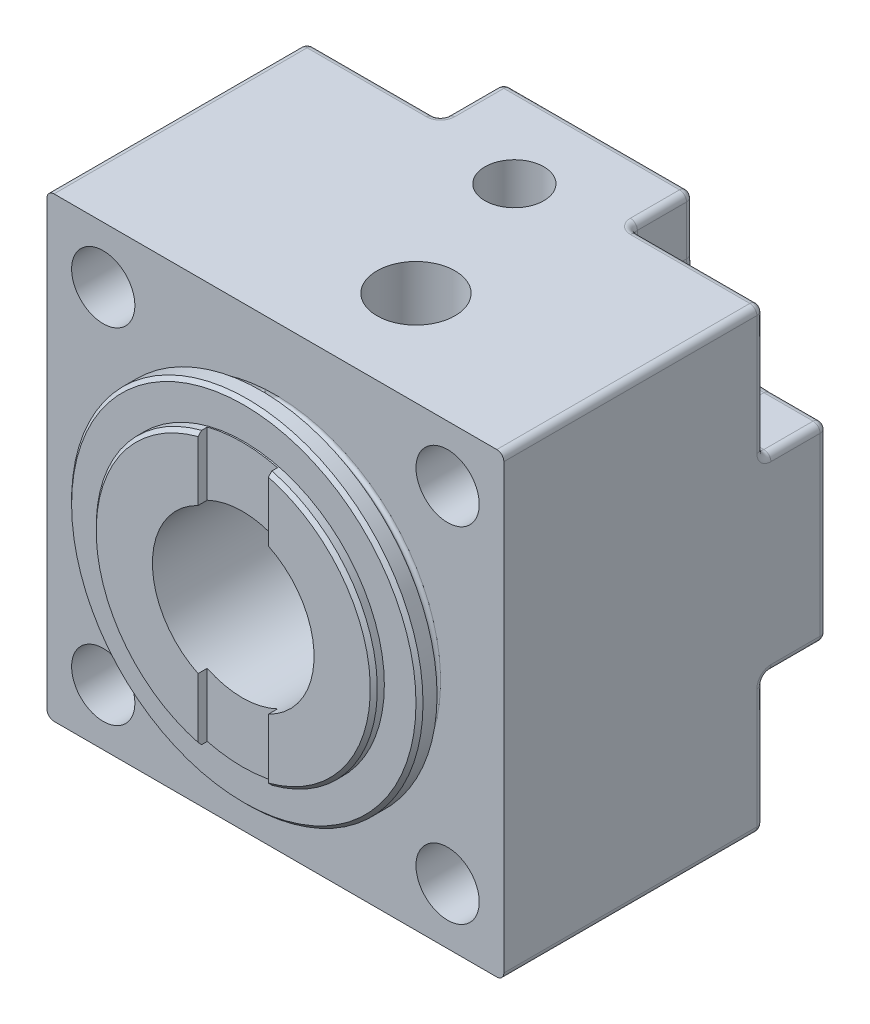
ISO-10303-21;
HEADER;
FILE_DESCRIPTION(('STEP AP214'),'2;1');
FILE_NAME('part.step','',(''),(''),'','','');
FILE_SCHEMA(('AUTOMOTIVE_DESIGN { 1 0 10303 214 1 1 1 1 }'));
ENDSEC;
DATA;
#1=APPLICATION_CONTEXT('core data for automotive mechanical design processes');
#2=APPLICATION_PROTOCOL_DEFINITION('international standard','automotive_design',2000,#1);
#3=PRODUCT_CONTEXT('',#1,'mechanical');
#4=PRODUCT('Part','Part','',(#3));
#5=PRODUCT_RELATED_PRODUCT_CATEGORY('part','',(#4));
#6=PRODUCT_DEFINITION_FORMATION('','',#4);
#7=PRODUCT_DEFINITION_CONTEXT('part definition',#1,'design');
#8=PRODUCT_DEFINITION('design','',#6,#7);
#9=PRODUCT_DEFINITION_SHAPE('','',#8);
#10=(LENGTH_UNIT() NAMED_UNIT(*) SI_UNIT(.MILLI.,.METRE.));
#11=(NAMED_UNIT(*) PLANE_ANGLE_UNIT() SI_UNIT($,.RADIAN.));
#12=(NAMED_UNIT(*) SI_UNIT($,.STERADIAN.) SOLID_ANGLE_UNIT());
#13=UNCERTAINTY_MEASURE_WITH_UNIT(LENGTH_MEASURE(1.E-05),#10,'distance_accuracy_value','');
#14=(GEOMETRIC_REPRESENTATION_CONTEXT(3) GLOBAL_UNCERTAINTY_ASSIGNED_CONTEXT((#13)) GLOBAL_UNIT_ASSIGNED_CONTEXT((#10,
#11,#12)) REPRESENTATION_CONTEXT('',''));
#15=CARTESIAN_POINT('',(0.,0.,0.));
#16=DIRECTION('',(0.,0.,1.));
#17=DIRECTION('',(1.,0.,0.));
#18=AXIS2_PLACEMENT_3D('',#15,#16,#17);
#19=CARTESIAN_POINT('',(32.5,32.5,0.));
#20=DIRECTION('',(0.,0.,1.));
#21=DIRECTION('',(1.,0.,0.));
#22=AXIS2_PLACEMENT_3D('',#19,#20,#21);
#23=CYLINDRICAL_SURFACE('',#22,11.5);
#24=CARTESIAN_POINT('',(32.5,32.5,52.));
#25=DIRECTION('',(0.,0.,1.));
#26=DIRECTION('',(1.,0.,0.));
#27=AXIS2_PLACEMENT_3D('',#24,#25,#26);
#28=CIRCLE('',#27,11.5);
#29=CARTESIAN_POINT('',(27.5,42.856157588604,52.));
#30=VERTEX_POINT('',#29);
#31=CARTESIAN_POINT('',(27.5,22.143842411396,52.));
#32=VERTEX_POINT('',#31);
#33=EDGE_CURVE('E936',#30,#32,#28,.T.);
#34=ORIENTED_EDGE('',*,*,#33,.T.);
#35=DIRECTION('',(0.,0.,1.));
#36=VECTOR('',#35,1.);
#37=CARTESIAN_POINT('',(27.5,22.143842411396,0.));
#38=LINE('',#37,#36);
#39=CARTESIAN_POINT('',(27.5,22.143842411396,50.7));
#40=VERTEX_POINT('',#39);
#41=EDGE_CURVE('E938',#32,#40,#38,.F.);
#42=ORIENTED_EDGE('',*,*,#41,.T.);
#43=CARTESIAN_POINT('',(32.5,32.5,50.7));
#44=DIRECTION('',(0.,0.,1.));
#45=DIRECTION('',(1.,0.,0.));
#46=AXIS2_PLACEMENT_3D('',#43,#44,#45);
#47=CIRCLE('',#46,11.5);
#48=CARTESIAN_POINT('',(37.5,22.143842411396,50.7));
#49=VERTEX_POINT('',#48);
#50=EDGE_CURVE('E765',#49,#40,#47,.F.);
#51=ORIENTED_EDGE('',*,*,#50,.F.);
#52=DIRECTION('',(0.,0.,1.));
#53=VECTOR('',#52,1.);
#54=CARTESIAN_POINT('',(37.5,22.143842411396,0.));
#55=LINE('',#54,#53);
#56=CARTESIAN_POINT('',(37.5,22.143842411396,52.));
#57=VERTEX_POINT('',#56);
#58=EDGE_CURVE('E1024',#49,#57,#55,.T.);
#59=ORIENTED_EDGE('',*,*,#58,.T.);
#60=CARTESIAN_POINT('',(37.5,42.856157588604,52.));
#61=VERTEX_POINT('',#60);
#62=EDGE_CURVE('E944',#57,#61,#28,.T.);
#63=ORIENTED_EDGE('',*,*,#62,.T.);
#64=DIRECTION('',(0.,0.,1.));
#65=VECTOR('',#64,1.);
#66=CARTESIAN_POINT('',(37.5,42.856157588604,0.));
#67=LINE('',#66,#65);
#68=CARTESIAN_POINT('',(37.5,42.856157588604,50.7));
#69=VERTEX_POINT('',#68);
#70=EDGE_CURVE('E1032',#61,#69,#67,.F.);
#71=ORIENTED_EDGE('',*,*,#70,.T.);
#72=CARTESIAN_POINT('',(27.5,42.856157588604,50.7));
#73=VERTEX_POINT('',#72);
#74=EDGE_CURVE('E998',#73,#69,#47,.F.);
#75=ORIENTED_EDGE('',*,*,#74,.F.);
#76=DIRECTION('',(0.,0.,1.));
#77=VECTOR('',#76,1.);
#78=CARTESIAN_POINT('',(27.5,42.856157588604,0.));
#79=LINE('',#78,#77);
#80=EDGE_CURVE('E940',#73,#30,#79,.T.);
#81=ORIENTED_EDGE('',*,*,#80,.T.);
#82=EDGE_LOOP('',(#34,#42,#51,#59,#63,#71,#75,#81));
#83=FACE_BOUND('',#82,.T.);
#84=DIRECTION('',(0.,0.,1.));
#85=VECTOR('',#84,1.);
#86=CARTESIAN_POINT('',(44.,32.5,0.));
#87=LINE('',#86,#85);
#88=CARTESIAN_POINT('',(44.,32.5,30.0911621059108));
#89=VERTEX_POINT('',#88);
#90=CARTESIAN_POINT('',(44.,32.5,34.9088378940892));
#91=VERTEX_POINT('',#90);
#92=EDGE_CURVE('E757',#89,#91,#87,.T.);
#93=ORIENTED_EDGE('',*,*,#92,.F.);
#94=CARTESIAN_POINT('',(44.,32.5,30.0911621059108));
#95=CARTESIAN_POINT('',(44.0000028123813,32.5951380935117,30.0911834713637));
#96=CARTESIAN_POINT('',(43.9988190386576,32.6902533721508,30.0887096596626));
#97=CARTESIAN_POINT('',(43.9941071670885,32.8801364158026,30.0789590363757));
#98=CARTESIAN_POINT('',(43.9905801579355,32.9749043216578,30.0716844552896));
#99=CARTESIAN_POINT('',(43.97656878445,33.257501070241,30.0430245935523));
#100=CARTESIAN_POINT('',(43.9626534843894,33.4444993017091,30.0147997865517));
#101=CARTESIAN_POINT('',(43.9263748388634,33.8121324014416,29.9436607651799));
#102=CARTESIAN_POINT('',(43.904124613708,33.992818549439,29.9009439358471));
#103=CARTESIAN_POINT('',(43.851633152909,34.3501574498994,29.80422930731));
#104=CARTESIAN_POINT('',(43.8213814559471,34.5268045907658,29.7502167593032));
#105=CARTESIAN_POINT('',(43.7576655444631,34.8535098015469,29.6415809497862));
#106=CARTESIAN_POINT('',(43.7251101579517,35.0040737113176,29.5879234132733));
#107=CARTESIAN_POINT('',(43.6544121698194,35.3022414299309,29.4762058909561));
#108=CARTESIAN_POINT('',(43.6162684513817,35.4498446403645,29.4181450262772));
#109=CARTESIAN_POINT('',(43.4936127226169,35.8886357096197,29.2395221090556));
#110=CARTESIAN_POINT('',(43.4008861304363,36.1757543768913,29.1145376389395));
#111=CARTESIAN_POINT('',(43.192991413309,36.7428602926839,28.8601315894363));
#112=CARTESIAN_POINT('',(43.0776400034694,37.0227666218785,28.730681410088));
#113=CARTESIAN_POINT('',(42.8247929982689,37.5734979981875,28.4743488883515));
#114=CARTESIAN_POINT('',(42.687306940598,37.8443268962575,28.3474654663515));
#115=CARTESIAN_POINT('',(42.4109194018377,38.338838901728,28.1187234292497));
#116=CARTESIAN_POINT('',(42.2750136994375,38.5637390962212,28.0158759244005));
#117=CARTESIAN_POINT('',(41.9861972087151,39.0062948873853,27.8185778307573));
#118=CARTESIAN_POINT('',(41.8332843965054,39.2239496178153,27.7241282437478));
#119=CARTESIAN_POINT('',(41.5108265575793,39.65025646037,27.5470240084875));
#120=CARTESIAN_POINT('',(41.3413452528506,39.8589389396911,27.4643269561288));
#121=CARTESIAN_POINT('',(40.9852858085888,40.2667959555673,27.3136251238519));
#122=CARTESIAN_POINT('',(40.7987149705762,40.4659744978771,27.2456141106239));
#123=CARTESIAN_POINT('',(40.4677144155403,40.7947180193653,27.1457002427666));
#124=CARTESIAN_POINT('',(40.3275467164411,40.927160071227,27.1090936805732));
#125=CARTESIAN_POINT('',(40.03943194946,41.1858749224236,27.0462112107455));
#126=CARTESIAN_POINT('',(39.8914868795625,41.3121492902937,27.0199326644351));
#127=CARTESIAN_POINT('',(39.5884536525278,41.5576946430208,26.9791684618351));
#128=CARTESIAN_POINT('',(39.4333697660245,41.6769697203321,26.9646758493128));
#129=CARTESIAN_POINT('',(39.1168536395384,41.9077402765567,26.9489697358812));
#130=CARTESIAN_POINT('',(38.9554224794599,42.0192370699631,26.9477539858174));
#131=CARTESIAN_POINT('',(38.6555121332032,42.2152487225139,26.9590312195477));
#132=CARTESIAN_POINT('',(38.5178290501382,42.3011170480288,26.9692153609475));
#133=CARTESIAN_POINT('',(38.2398883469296,42.4664341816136,27.0005201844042));
#134=CARTESIAN_POINT('',(38.0996312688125,42.5458843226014,27.0216385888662));
#135=CARTESIAN_POINT('',(37.8176779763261,42.697938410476,27.0754994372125));
#136=CARTESIAN_POINT('',(37.675982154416,42.7705441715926,27.1082387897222));
#137=CARTESIAN_POINT('',(37.3924223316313,42.9086054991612,27.1858867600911));
#138=CARTESIAN_POINT('',(37.2505583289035,42.9740609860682,27.2307955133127));
#139=CARTESIAN_POINT('',(36.9673746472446,43.0979515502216,27.3334021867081));
#140=CARTESIAN_POINT('',(36.8260619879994,43.1563470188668,27.3911675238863));
#141=CARTESIAN_POINT('',(36.5463558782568,43.2656654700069,27.5194576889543));
#142=CARTESIAN_POINT('',(36.4079624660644,43.3165883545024,27.5899826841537));
#143=CARTESIAN_POINT('',(36.1357564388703,43.4110968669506,27.743632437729));
#144=CARTESIAN_POINT('',(36.0019433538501,43.4546832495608,27.8267558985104));
#145=CARTESIAN_POINT('',(35.7405014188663,43.5348469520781,28.005201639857));
#146=CARTESIAN_POINT('',(35.6128721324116,43.5714247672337,28.10052305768));
#147=CARTESIAN_POINT('',(35.3765857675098,43.6350276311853,28.2935191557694));
#148=CARTESIAN_POINT('',(35.2672591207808,43.6626190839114,28.3901903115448));
#149=CARTESIAN_POINT('',(35.0559614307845,43.7128881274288,28.592512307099));
#150=CARTESIAN_POINT('',(34.9539929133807,43.7355640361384,28.6981662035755));
#151=CARTESIAN_POINT('',(34.7584207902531,43.7765028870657,28.9176673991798));
#152=CARTESIAN_POINT('',(34.6648139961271,43.7947675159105,29.031511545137));
#153=CARTESIAN_POINT('',(34.4866916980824,43.8274560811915,29.2666865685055));
#154=CARTESIAN_POINT('',(34.4021796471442,43.8418785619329,29.3880202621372));
#155=CARTESIAN_POINT('',(34.2428005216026,43.8674613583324,29.6375672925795));
#156=CARTESIAN_POINT('',(34.1679550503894,43.8786144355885,29.7657951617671));
#157=CARTESIAN_POINT('',(34.0286821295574,43.8981612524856,30.028047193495));
#158=CARTESIAN_POINT('',(33.9642584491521,43.9065539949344,30.1620734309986));
#159=CARTESIAN_POINT('',(33.8463534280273,43.92107095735,30.4349310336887));
#160=CARTESIAN_POINT('',(33.7928692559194,43.9271957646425,30.5737611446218));
#161=CARTESIAN_POINT('',(33.6971859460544,43.9376161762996,30.8553761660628));
#162=CARTESIAN_POINT('',(33.6549907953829,43.9419111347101,30.9981624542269));
#163=CARTESIAN_POINT('',(33.5810595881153,43.949136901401,31.291226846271));
#164=CARTESIAN_POINT('',(33.549693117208,43.952020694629,31.441599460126));
#165=CARTESIAN_POINT('',(33.499527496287,43.9565081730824,31.7444460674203));
#166=CARTESIAN_POINT('',(33.4807285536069,43.9581118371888,31.8969200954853));
#167=CARTESIAN_POINT('',(33.4558287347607,43.9602158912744,32.2029491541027));
#168=CARTESIAN_POINT('',(33.4497311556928,43.9607159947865,32.3565044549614));
#169=CARTESIAN_POINT('',(33.4502869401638,43.9606698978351,32.6635387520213));
#170=CARTESIAN_POINT('',(33.4569359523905,43.9601240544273,32.817017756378));
#171=CARTESIAN_POINT('',(33.4830917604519,43.957910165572,33.1247978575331));
#172=CARTESIAN_POINT('',(33.5027578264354,43.9562282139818,33.279085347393));
#173=CARTESIAN_POINT('',(33.5549514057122,43.9515397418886,33.5853911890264));
#174=CARTESIAN_POINT('',(33.5874742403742,43.9485337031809,33.7374103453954));
#175=CARTESIAN_POINT('',(33.6651585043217,43.9408884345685,34.0382151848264));
#176=CARTESIAN_POINT('',(33.710325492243,43.9362484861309,34.1869994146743));
#177=CARTESIAN_POINT('',(33.8129310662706,43.924923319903,34.4801311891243));
#178=CARTESIAN_POINT('',(33.8703648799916,43.918238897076,34.6244804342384));
#179=CARTESIAN_POINT('',(33.9969185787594,43.9023370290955,34.9074127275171));
#180=CARTESIAN_POINT('',(34.0660107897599,43.8931255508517,35.0460084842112));
#181=CARTESIAN_POINT('',(34.2153859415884,43.8715935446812,35.3167100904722));
#182=CARTESIAN_POINT('',(34.2956643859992,43.8592742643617,35.4488185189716));
#183=CARTESIAN_POINT('',(34.4667516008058,43.8309047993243,35.705614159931));
#184=CARTESIAN_POINT('',(34.5575605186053,43.8148545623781,35.8303012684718));
#185=CARTESIAN_POINT('',(34.7488894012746,43.7783853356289,36.0713062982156));
#186=CARTESIAN_POINT('',(34.8494091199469,43.7579664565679,36.1876244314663));
#187=CARTESIAN_POINT('',(35.0568074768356,43.7126598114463,36.4084720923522));
#188=CARTESIAN_POINT('',(35.1634888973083,43.687884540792,36.5132099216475));
#189=CARTESIAN_POINT('',(35.3841833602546,43.6330323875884,36.7131386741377));
#190=CARTESIAN_POINT('',(35.4981962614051,43.6029556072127,36.8083297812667));
#191=CARTESIAN_POINT('',(35.7323754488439,43.5370528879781,36.988535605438));
#192=CARTESIAN_POINT('',(35.8525398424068,43.5012287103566,37.0735534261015));
#193=CARTESIAN_POINT('',(36.0978167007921,43.4234729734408,37.2329934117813));
#194=CARTESIAN_POINT('',(36.2229290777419,43.3815415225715,37.3074157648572));
#195=CARTESIAN_POINT('',(36.4731791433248,43.2926351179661,37.4434174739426));
#196=CARTESIAN_POINT('',(36.5982141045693,43.2458383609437,37.50530286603));
#197=CARTESIAN_POINT('',(36.8505859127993,43.146164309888,37.6187565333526));
#198=CARTESIAN_POINT('',(36.9779236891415,43.0932845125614,37.6703205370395));
#199=CARTESIAN_POINT('',(37.2336822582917,42.9814946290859,37.7631865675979));
#200=CARTESIAN_POINT('',(37.3621030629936,42.9225844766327,37.8044884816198));
#201=CARTESIAN_POINT('',(37.6188866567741,42.7988981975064,37.8770646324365));
#202=CARTESIAN_POINT('',(37.7472494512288,42.7341239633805,37.9083420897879));
#203=CARTESIAN_POINT('',(38.0080823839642,42.5962196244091,37.962329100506));
#204=CARTESIAN_POINT('',(38.1405115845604,42.5228590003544,37.9846461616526));
#205=CARTESIAN_POINT('',(38.4033053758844,42.3703632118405,38.0194226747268));
#206=CARTESIAN_POINT('',(38.5336699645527,42.2912280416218,38.0318821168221));
#207=CARTESIAN_POINT('',(38.7915725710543,42.1275359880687,38.0475899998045));
#208=CARTESIAN_POINT('',(38.9191095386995,42.0429771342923,38.0508350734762));
#209=CARTESIAN_POINT('',(39.1706668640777,41.8688644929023,38.0488018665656));
#210=CARTESIAN_POINT('',(39.2946865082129,41.7793097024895,38.0435218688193));
#211=CARTESIAN_POINT('',(39.5981733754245,41.5508282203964,38.0206705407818));
#212=CARTESIAN_POINT('',(39.7752028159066,41.4091127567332,37.9983626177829));
#213=CARTESIAN_POINT('',(40.1191488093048,41.1168191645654,37.9387956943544));
#214=CARTESIAN_POINT('',(40.2860613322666,40.9662375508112,37.9015307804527));
#215=CARTESIAN_POINT('',(40.6093122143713,40.6571525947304,37.8141965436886));
#216=CARTESIAN_POINT('',(40.7656335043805,40.4986371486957,37.7641071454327));
#217=CARTESIAN_POINT('',(41.0670653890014,40.1749153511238,37.6532062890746));
#218=CARTESIAN_POINT('',(41.2121760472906,40.0097090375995,37.5923948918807));
#219=CARTESIAN_POINT('',(41.5521823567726,39.5997642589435,37.4333436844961));
#220=CARTESIAN_POINT('',(41.7410699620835,39.3518637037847,37.3303714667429));
#221=CARTESIAN_POINT('',(42.0957680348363,38.8456184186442,37.1110967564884));
#222=CARTESIAN_POINT('',(42.2615664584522,38.5872683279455,36.9947873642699));
#223=CARTESIAN_POINT('',(42.5709758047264,38.0604897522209,36.7531476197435));
#224=CARTESIAN_POINT('',(42.7145173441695,37.7920328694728,36.627790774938));
#225=CARTESIAN_POINT('',(42.9792706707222,37.2462507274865,36.3731857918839));
#226=CARTESIAN_POINT('',(43.1004899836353,36.9689284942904,36.2439389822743));
#227=CARTESIAN_POINT('',(43.2886189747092,36.48766235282,36.0248501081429));
#228=CARTESIAN_POINT('',(43.3610303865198,36.2860500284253,35.9345677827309));
#229=CARTESIAN_POINT('',(43.4948639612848,35.8777396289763,35.7574524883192));
#230=CARTESIAN_POINT('',(43.5562881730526,35.6710425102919,35.6706188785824));
#231=CARTESIAN_POINT('',(43.6675526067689,35.2535590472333,35.504392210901));
#232=CARTESIAN_POINT('',(43.7174788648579,35.0428167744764,35.4249467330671));
#233=CARTESIAN_POINT('',(43.8059294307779,34.6150882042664,35.2772190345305));
#234=CARTESIAN_POINT('',(43.8444593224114,34.3981050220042,35.2089313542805));
#235=CARTESIAN_POINT('',(43.896840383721,34.0429300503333,35.1125109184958));
#236=CARTESIAN_POINT('',(43.9144718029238,33.9067404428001,35.0790651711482));
#237=CARTESIAN_POINT('',(43.9449659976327,33.6321773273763,35.0201000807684));
#238=CARTESIAN_POINT('',(43.9578314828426,33.4938051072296,34.9945762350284));
#239=CARTESIAN_POINT('',(43.9787112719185,33.2135344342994,34.9526572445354));
#240=CARTESIAN_POINT('',(43.986663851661,33.0716135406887,34.9363784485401));
#241=CARTESIAN_POINT('',(43.9973232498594,32.7864875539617,34.9143948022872));
#242=CARTESIAN_POINT('',(44.0000196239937,32.643280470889,34.9087110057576));
#243=CARTESIAN_POINT('',(44.,32.5,34.9088378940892));
#244=B_SPLINE_CURVE_WITH_KNOTS('',3,(#94,#95,#96,#97,#98,#99,#100,#101,#102,#103,#104,#105,#106,
#107,#108,#109,#110,#111,#112,#113,#114,#115,#116,#117,#118,#119,#120,#121,#122,#123,#124,#125,
#126,#127,#128,#129,#130,#131,#132,#133,#134,#135,#136,#137,#138,#139,#140,#141,#142,#143,#144,
#145,#146,#147,#148,#149,#150,#151,#152,#153,#154,#155,#156,#157,#158,#159,#160,#161,#162,#163,
#164,#165,#166,#167,#168,#169,#170,#171,#172,#173,#174,#175,#176,#177,#178,#179,#180,#181,#182,
#183,#184,#185,#186,#187,#188,#189,#190,#191,#192,#193,#194,#195,#196,#197,#198,#199,#200,#201,
#202,#203,#204,#205,#206,#207,#208,#209,#210,#211,#212,#213,#214,#215,#216,#217,#218,#219,#220,
#221,#222,#223,#224,#225,#226,#227,#228,#229,#230,#231,#232,#233,#234,#235,#236,#237,#238,#239,
#240,#241,#242,#243),.UNSPECIFIED.,.F.,.F.,(4,2,2,2,2,2,2,2,2,2,2,2,2,2,2,2,2,2,2,2,2,2,2,2,2,2,
2,2,2,2,2,2,2,2,2,2,2,2,2,2,2,2,2,2,2,2,2,2,2,2,2,2,2,2,2,2,2,2,2,2,2,2,2,2,2,2,2,2,2,2,2,2,2,2,
4),(0.,0.285333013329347,0.570533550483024,1.1383203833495,1.69866515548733,2.25974618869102,
2.74890740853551,3.23816651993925,4.21684806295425,5.20381235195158,6.19035249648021,
7.03625589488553,7.88226006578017,8.72512976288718,9.56764100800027,10.1560410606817,
10.7442906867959,11.3321928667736,11.9199954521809,12.4072750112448,12.8944531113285,
13.3815017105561,13.8685557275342,14.3582265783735,14.8479038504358,15.3375307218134,
15.8271229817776,16.2721618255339,16.7173527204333,17.1623731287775,17.6075619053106,
18.0537290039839,18.5000571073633,18.9462695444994,19.3926393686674,19.8530104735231,
20.3133891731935,20.7738873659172,21.2342283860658,21.7003086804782,22.1662195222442,
22.6323355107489,23.0982704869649,23.5631146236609,24.0277724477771,24.4924367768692,
24.9570893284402,25.4111486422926,25.8651992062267,26.3191108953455,26.7730145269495,
27.213957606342,27.6550827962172,28.0962128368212,28.5372010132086,28.9958180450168,
29.4544355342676,29.9132205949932,30.3720980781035,31.0546393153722,31.7374506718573,
32.421337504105,33.1052204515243,34.0884252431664,35.0721409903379,36.0588642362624,
37.0452542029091,37.7423709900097,38.4393576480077,39.1309459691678,39.8221948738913,
40.2459529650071,40.6694697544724,41.0982046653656,41.5277906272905),.UNSPECIFIED.);
#245=EDGE_CURVE('E764',#89,#91,#244,.T.);
#246=ORIENTED_EDGE('',*,*,#245,.T.);
#247=EDGE_LOOP('',(#93,#246));
#248=FACE_BOUND('',#247,.T.);
#249=CARTESIAN_POINT('',(32.5,32.5,24.));
#250=DIRECTION('',(0.,0.,-1.));
#251=DIRECTION('',(-1.,0.,0.));
#252=AXIS2_PLACEMENT_3D('',#249,#250,#251);
#253=CIRCLE('',#252,11.5);
#254=CARTESIAN_POINT('',(21.,32.5,24.));
#255=VERTEX_POINT('',#254);
#256=EDGE_CURVE('E1137',#255,#255,#253,.F.);
#257=ORIENTED_EDGE('',*,*,#256,.F.);
#258=EDGE_LOOP('',(#257));
#259=FACE_BOUND('',#258,.T.);
#260=ADVANCED_FACE('F348',(#83,#248,#259),#23,.F.);
#261=CARTESIAN_POINT('',(32.5,32.5,52.));
#262=DIRECTION('',(0.,0.,1.));
#263=DIRECTION('',(1.,0.,0.));
#264=AXIS2_PLACEMENT_3D('',#261,#262,#263);
#265=PLANE('',#264);
#266=DIRECTION('',(0.,-1.,0.));
#267=VECTOR('',#266,1.);
#268=CARTESIAN_POINT('',(27.5,54.,52.));
#269=LINE('',#268,#267);
#270=CARTESIAN_POINT('',(27.5,51.3480768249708,52.));
#271=VERTEX_POINT('',#270);
#272=EDGE_CURVE('E1319',#271,#30,#269,.T.);
#273=ORIENTED_EDGE('',*,*,#272,.F.);
#274=CARTESIAN_POINT('',(32.5,32.5,52.));
#275=DIRECTION('',(0.,0.,1.));
#276=DIRECTION('',(1.,0.,0.));
#277=AXIS2_PLACEMENT_3D('',#274,#275,#276);
#278=CIRCLE('',#277,19.5);
#279=CARTESIAN_POINT('',(27.5,13.6519231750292,52.));
#280=VERTEX_POINT('',#279);
#281=EDGE_CURVE('E972',#271,#280,#278,.T.);
#282=ORIENTED_EDGE('',*,*,#281,.T.);
#283=EDGE_CURVE('E769',#32,#280,#269,.T.);
#284=ORIENTED_EDGE('',*,*,#283,.F.);
#285=ORIENTED_EDGE('',*,*,#33,.F.);
#286=EDGE_LOOP('',(#273,#282,#284,#285));
#287=FACE_BOUND('',#286,.T.);
#288=ADVANCED_FACE('F925',(#287),#265,.T.);
#289=CARTESIAN_POINT('',(32.5,32.5,52.));
#290=DIRECTION('',(0.,0.,-1.));
#291=DIRECTION('',(-1.,0.,0.));
#292=AXIS2_PLACEMENT_3D('',#289,#290,#291);
#293=CONICAL_SURFACE('',#292,19.5,0.785398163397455);
#294=CARTESIAN_POINT('',(27.5,76.2170744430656,27.4979250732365));
#295=CARTESIAN_POINT('',(27.5,75.0228656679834,28.6843715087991));
#296=CARTESIAN_POINT('',(27.5,73.8283688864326,29.8705284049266));
#297=CARTESIAN_POINT('',(27.5,71.438340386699,32.2422376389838));
#298=CARTESIAN_POINT('',(27.5,70.2428085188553,33.4277898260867));
#299=CARTESIAN_POINT('',(27.5,67.8459964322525,35.8024778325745));
#300=CARTESIAN_POINT('',(27.5,66.6447120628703,36.9916094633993));
#301=CARTESIAN_POINT('',(27.5,64.240914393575,39.3681941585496));
#302=CARTESIAN_POINT('',(27.5,63.0384013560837,40.5556474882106));
#303=CARTESIAN_POINT('',(27.5,60.9036955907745,42.6600013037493));
#304=CARTESIAN_POINT('',(27.5,59.9719118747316,43.5773166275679));
#305=CARTESIAN_POINT('',(27.5,58.1066866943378,45.4102993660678));
#306=CARTESIAN_POINT('',(27.5,57.1732451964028,46.32596674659));
#307=CARTESIAN_POINT('',(27.5,55.3034772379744,48.1555916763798));
#308=CARTESIAN_POINT('',(27.5,54.3671492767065,49.0695476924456));
#309=CARTESIAN_POINT('',(27.5,52.4913196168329,50.8940558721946));
#310=CARTESIAN_POINT('',(27.5,51.5518181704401,51.8046082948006));
#311=CARTESIAN_POINT('',(27.5,50.1406012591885,53.1649124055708));
#312=CARTESIAN_POINT('',(27.5,49.6707439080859,53.6165913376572));
#313=CARTESIAN_POINT('',(27.5,48.7294703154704,54.5183213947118));
#314=CARTESIAN_POINT('',(27.5,48.2580540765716,54.968372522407));
#315=CARTESIAN_POINT('',(27.5,47.3130827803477,55.8665158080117));
#316=CARTESIAN_POINT('',(27.5,46.8395271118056,56.3146073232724));
#317=CARTESIAN_POINT('',(27.5,45.8898119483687,57.2080073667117));
#318=CARTESIAN_POINT('',(27.5,45.4136525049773,57.6533159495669));
#319=CARTESIAN_POINT('',(27.5,44.4584479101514,58.5395697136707));
#320=CARTESIAN_POINT('',(27.5,43.9794073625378,58.980519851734));
#321=CARTESIAN_POINT('',(27.5,43.016446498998,59.8571626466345));
#322=CARTESIAN_POINT('',(27.5,42.5325257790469,60.292854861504));
#323=CARTESIAN_POINT('',(27.5,41.8015281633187,60.9403692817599));
#324=CARTESIAN_POINT('',(27.5,41.557072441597,61.1551495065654));
#325=CARTESIAN_POINT('',(27.5,41.0660169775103,61.5822425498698));
#326=CARTESIAN_POINT('',(27.5,40.8194172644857,61.7945554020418));
#327=CARTESIAN_POINT('',(27.5,40.3236102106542,62.2160439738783));
#328=CARTESIAN_POINT('',(27.5,40.0744032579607,62.4252201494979));
#329=CARTESIAN_POINT('',(27.5,39.5726939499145,62.8395759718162));
#330=CARTESIAN_POINT('',(27.5,39.320191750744,63.0447558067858));
#331=CARTESIAN_POINT('',(27.5,38.9696135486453,63.3236595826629));
#332=CARTESIAN_POINT('',(27.5,38.8733337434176,63.3996440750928));
#333=CARTESIAN_POINT('',(27.5,38.6801142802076,63.5507747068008));
#334=CARTESIAN_POINT('',(27.5,38.5831746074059,63.6259208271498));
#335=CARTESIAN_POINT('',(27.5,38.3885668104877,63.7752781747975));
#336=CARTESIAN_POINT('',(27.5,38.2908986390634,63.8494893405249));
#337=CARTESIAN_POINT('',(27.5,38.0947670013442,63.9968516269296));
#338=CARTESIAN_POINT('',(27.5,37.9963035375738,64.0700027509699));
#339=CARTESIAN_POINT('',(27.5,37.6990865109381,64.2880453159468));
#340=CARTESIAN_POINT('',(27.5,37.4990062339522,64.4311403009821));
#341=CARTESIAN_POINT('',(27.5,37.0945554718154,64.7111388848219));
#342=CARTESIAN_POINT('',(27.5,36.8901852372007,64.8480428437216));
#343=CARTESIAN_POINT('',(27.5,36.4826925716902,65.1095241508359));
#344=CARTESIAN_POINT('',(27.5,36.2797331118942,65.2343537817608));
#345=CARTESIAN_POINT('',(27.5,35.8677738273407,65.4739069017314));
#346=CARTESIAN_POINT('',(27.5,35.6587718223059,65.5886266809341));
#347=CARTESIAN_POINT('',(27.5,35.2346380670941,65.8039498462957));
#348=CARTESIAN_POINT('',(27.5,35.019535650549,65.9046103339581));
#349=CARTESIAN_POINT('',(27.5,34.5817516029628,66.0875813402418));
#350=CARTESIAN_POINT('',(27.5,34.3590790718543,66.1699130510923));
#351=CARTESIAN_POINT('',(27.5,33.9879346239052,66.2851140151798));
#352=CARTESIAN_POINT('',(27.5,33.8416782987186,66.325111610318));
#353=CARTESIAN_POINT('',(27.5,33.5464501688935,66.3936842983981));
#354=CARTESIAN_POINT('',(27.5,33.3974780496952,66.4222580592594));
#355=CARTESIAN_POINT('',(27.5,33.0982105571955,66.4665064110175));
#356=CARTESIAN_POINT('',(27.5,32.9479228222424,66.4822319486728));
#357=CARTESIAN_POINT('',(27.5,32.6465360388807,66.5001145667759));
#358=CARTESIAN_POINT('',(27.5,32.4954370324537,66.5022723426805));
#359=CARTESIAN_POINT('',(27.5,32.1935387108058,66.4928920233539));
#360=CARTESIAN_POINT('',(27.5,32.0427397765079,66.4813418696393));
#361=CARTESIAN_POINT('',(27.5,31.7427323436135,66.4451742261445));
#362=CARTESIAN_POINT('',(27.5,31.5935239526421,66.4205558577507));
#363=CARTESIAN_POINT('',(27.5,31.2969441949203,66.3593597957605));
#364=CARTESIAN_POINT('',(27.5,31.1495834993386,66.3227310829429));
#365=CARTESIAN_POINT('',(27.5,30.8578685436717,66.2391012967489));
#366=CARTESIAN_POINT('',(27.5,30.7135143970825,66.1920998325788));
#367=CARTESIAN_POINT('',(27.5,30.4012917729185,66.079708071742));
#368=CARTESIAN_POINT('',(27.5,30.2340738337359,66.0125226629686));
#369=CARTESIAN_POINT('',(27.5,29.9039610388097,65.8681830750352));
#370=CARTESIAN_POINT('',(27.5,29.7410682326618,65.7910242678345));
#371=CARTESIAN_POINT('',(27.5,29.4190311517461,65.628628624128));
#372=CARTESIAN_POINT('',(27.5,29.2598939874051,65.5433777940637));
#373=CARTESIAN_POINT('',(27.5,28.9452369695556,65.3665334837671));
#374=CARTESIAN_POINT('',(27.5,28.7897166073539,65.2749409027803));
#375=CARTESIAN_POINT('',(27.5,28.4806881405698,65.0859672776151));
#376=CARTESIAN_POINT('',(27.5,28.3272029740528,64.9885488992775));
#377=CARTESIAN_POINT('',(27.5,28.0229778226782,64.7895233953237));
#378=CARTESIAN_POINT('',(27.5,27.8722379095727,64.68791616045));
#379=CARTESIAN_POINT('',(27.5,27.5732886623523,64.4813946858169));
#380=CARTESIAN_POINT('',(27.5,27.4250767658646,64.3764841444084));
#381=CARTESIAN_POINT('',(27.5,27.1306962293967,64.1638520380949));
#382=CARTESIAN_POINT('',(27.5,26.984527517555,64.0561305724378));
#383=CARTESIAN_POINT('',(27.5,26.6782357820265,63.8265672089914));
#384=CARTESIAN_POINT('',(27.5,26.5183132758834,63.7044581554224));
#385=CARTESIAN_POINT('',(27.5,26.2003118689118,63.4578599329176));
#386=CARTESIAN_POINT('',(27.5,26.0422330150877,63.3333707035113));
#387=CARTESIAN_POINT('',(27.5,25.57032467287,62.9569177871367));
#388=CARTESIAN_POINT('',(27.5,25.2588564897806,62.7019939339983));
#389=CARTESIAN_POINT('',(27.5,24.6404994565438,62.1864227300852));
#390=CARTESIAN_POINT('',(27.5,24.3336125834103,61.9257730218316));
#391=CARTESIAN_POINT('',(27.5,23.7234330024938,61.4002923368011));
#392=CARTESIAN_POINT('',(27.5,23.4201403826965,61.1354612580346));
#393=CARTESIAN_POINT('',(27.5,22.8158820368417,60.6022045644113));
#394=CARTESIAN_POINT('',(27.5,22.5149207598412,60.3337739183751));
#395=CARTESIAN_POINT('',(27.5,21.915224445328,59.7944328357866));
#396=CARTESIAN_POINT('',(27.5,21.616489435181,59.5235223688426));
#397=CARTESIAN_POINT('',(27.5,21.0208919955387,58.9798103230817));
#398=CARTESIAN_POINT('',(27.5,20.7240290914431,58.7070092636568));
#399=CARTESIAN_POINT('',(27.5,20.1317677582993,58.1598212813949));
#400=CARTESIAN_POINT('',(27.5,19.8363693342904,57.8854343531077));
#401=CARTESIAN_POINT('',(27.5,18.9543100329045,57.0625218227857));
#402=CARTESIAN_POINT('',(27.5,18.3694311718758,56.5120864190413));
#403=CARTESIAN_POINT('',(27.5,17.2029848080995,55.4076513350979));
#404=CARTESIAN_POINT('',(27.5,16.6214175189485,54.8536514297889));
#405=CARTESIAN_POINT('',(27.5,15.4612532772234,53.7435788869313));
#406=CARTESIAN_POINT('',(27.5,14.8826541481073,53.1875085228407));
#407=CARTESIAN_POINT('',(27.5,13.727315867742,52.0734628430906));
#408=CARTESIAN_POINT('',(27.5,13.1505766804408,51.5154875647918));
#409=CARTESIAN_POINT('',(27.5,11.5760823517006,49.9883547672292));
#410=CARTESIAN_POINT('',(27.5,10.5797452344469,49.0177356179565));
#411=CARTESIAN_POINT('',(27.5,8.58988760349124,47.0736025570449));
#412=CARTESIAN_POINT('',(27.5,7.59636711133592,46.1000886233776));
#413=CARTESIAN_POINT('',(27.5,5.61097210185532,44.1506961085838));
#414=CARTESIAN_POINT('',(27.5,4.61909827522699,43.1748168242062));
#415=CARTESIAN_POINT('',(27.5,2.63679924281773,41.2215879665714));
#416=CARTESIAN_POINT('',(27.5,1.64637403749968,40.2442383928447));
#417=CARTESIAN_POINT('',(27.5,-0.334762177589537,38.287080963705));
#418=CARTESIAN_POINT('',(27.5,-1.32547167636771,37.3072715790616));
#419=CARTESIAN_POINT('',(27.5,-3.30605197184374,35.346803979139));
#420=CARTESIAN_POINT('',(27.5,-4.29592276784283,34.366145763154));
#421=CARTESIAN_POINT('',(27.5,-6.27464079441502,32.4045286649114));
#422=CARTESIAN_POINT('',(27.5,-7.26348826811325,31.4235700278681));
#423=CARTESIAN_POINT('',(27.5,-9.24064985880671,29.4611175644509));
#424=CARTESIAN_POINT('',(27.5,-10.2289639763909,28.4796237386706));
#425=CARTESIAN_POINT('',(27.5,-11.2170744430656,27.4979250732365));
#426=B_SPLINE_CURVE_WITH_KNOTS('',3,(#294,#295,#296,#297,#298,#299,#300,#301,#302,#303,#304,
#305,#306,#307,#308,#309,#310,#311,#312,#313,#314,#315,#316,#317,#318,#319,#320,#321,#322,#323,
#324,#325,#326,#327,#328,#329,#330,#331,#332,#333,#334,#335,#336,#337,#338,#339,#340,#341,#342,
#343,#344,#345,#346,#347,#348,#349,#350,#351,#352,#353,#354,#355,#356,#357,#358,#359,#360,#361,
#362,#363,#364,#365,#366,#367,#368,#369,#370,#371,#372,#373,#374,#375,#376,#377,#378,#379,#380,
#381,#382,#383,#384,#385,#386,#387,#388,#389,#390,#391,#392,#393,#394,#395,#396,#397,#398,#399,
#400,#401,#402,#403,#404,#405,#406,#407,#408,#409,#410,#411,#412,#413,#414,#415,#416,#417,#418,
#419,#420,#421,#422,#423,#424,#425),.UNSPECIFIED.,.F.,.F.,(4,2,2,2,2,2,2,2,2,2,2,2,2,2,2,2,2,2,
2,2,2,2,2,2,2,2,2,2,2,2,2,2,2,2,2,2,2,2,2,2,2,2,2,2,2,2,2,2,2,2,2,2,2,2,2,2,2,2,2,2,2,2,2,2,2,
4),(0.,5.05015950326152,10.1012454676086,15.172148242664,20.2421312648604,24.1647813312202,
28.087511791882,32.012839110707,35.9378614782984,37.8931125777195,39.8483604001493,
41.8042074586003,43.7600159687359,45.7132593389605,47.6666657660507,48.6428718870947,
49.619064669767,50.5951141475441,51.5711175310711,51.939069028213,52.3070288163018,
52.6750127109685,53.0429954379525,53.7808546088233,54.5186708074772,55.2332781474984,
55.9481466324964,56.6600215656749,57.3710690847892,57.8255672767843,58.2801184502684,
58.7328583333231,59.1855750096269,59.6386902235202,60.0918359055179,60.5469320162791,
61.0020452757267,61.5422616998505,62.0827297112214,62.6241500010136,63.1654936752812,
63.7107842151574,64.2560889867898,64.8008035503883,65.3454989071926,65.9491038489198,
66.5527241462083,67.7600892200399,68.9679610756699,70.175862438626,71.3856779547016,
72.5955083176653,73.8050185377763,75.0145329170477,77.4239816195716,79.8335840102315,
82.2410498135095,84.6484686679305,88.8213593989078,92.9942819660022,97.1686523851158,
101.343024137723,105.52318922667,109.703357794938,113.881980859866,118.060599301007),.UNSPECIFIED.);
#427=CARTESIAN_POINT('',(27.5,51.8649167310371,51.5));
#428=VERTEX_POINT('',#427);
#429=EDGE_CURVE('E997',#428,#271,#426,.T.);
#430=ORIENTED_EDGE('',*,*,#429,.F.);
#431=CARTESIAN_POINT('',(32.5,32.5,51.5));
#432=DIRECTION('',(0.,0.,1.));
#433=DIRECTION('',(1.,0.,0.));
#434=AXIS2_PLACEMENT_3D('',#431,#432,#433);
#435=CIRCLE('',#434,20.);
#436=CARTESIAN_POINT('',(27.5,13.1350832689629,51.5));
#437=VERTEX_POINT('',#436);
#438=EDGE_CURVE('E975',#437,#428,#435,.F.);
#439=ORIENTED_EDGE('',*,*,#438,.F.);
#440=EDGE_CURVE('E819',#280,#437,#426,.T.);
#441=ORIENTED_EDGE('',*,*,#440,.F.);
#442=ORIENTED_EDGE('',*,*,#281,.F.);
#443=EDGE_LOOP('',(#430,#439,#441,#442));
#444=FACE_BOUND('',#443,.T.);
#445=ADVANCED_FACE('F830',(#444),#293,.T.);
#446=CARTESIAN_POINT('',(0.,65.,46.));
#447=DIRECTION('',(0.,0.,-1.));
#448=DIRECTION('',(-1.,0.,0.));
#449=AXIS2_PLACEMENT_3D('',#446,#447,#448);
#450=PLANE('',#449);
#451=CARTESIAN_POINT('',(32.5,32.5,46.));
#452=DIRECTION('',(0.,0.,-1.));
#453=DIRECTION('',(-1.,0.,0.));
#454=AXIS2_PLACEMENT_3D('',#451,#452,#453);
#455=CIRCLE('',#454,23.5);
#456=CARTESIAN_POINT('',(8.99999999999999,32.5,46.));
#457=VERTEX_POINT('',#456);
#458=EDGE_CURVE('E2164',#457,#457,#455,.T.);
#459=ORIENTED_EDGE('',*,*,#458,.T.);
#460=EDGE_LOOP('',(#459));
#461=FACE_BOUND('',#460,.T.);
#462=CARTESIAN_POINT('',(57.,8.,46.));
#463=DIRECTION('',(0.,0.,-1.));
#464=DIRECTION('',(-1.,0.,0.));
#465=AXIS2_PLACEMENT_3D('',#462,#463,#464);
#466=CIRCLE('',#465,4.5);
#467=CARTESIAN_POINT('',(52.5,8.,46.));
#468=VERTEX_POINT('',#467);
#469=EDGE_CURVE('E1043',#468,#468,#466,.T.);
#470=ORIENTED_EDGE('',*,*,#469,.T.);
#471=EDGE_LOOP('',(#470));
#472=FACE_BOUND('',#471,.T.);
#473=CARTESIAN_POINT('',(57.,57.,46.));
#474=DIRECTION('',(0.,0.,-1.));
#475=DIRECTION('',(-1.,0.,0.));
#476=AXIS2_PLACEMENT_3D('',#473,#474,#475);
#477=CIRCLE('',#476,4.5);
#478=CARTESIAN_POINT('',(52.5,57.,46.));
#479=VERTEX_POINT('',#478);
#480=EDGE_CURVE('E1067',#479,#479,#477,.F.);
#481=ORIENTED_EDGE('',*,*,#480,.F.);
#482=EDGE_LOOP('',(#481));
#483=FACE_BOUND('',#482,.T.);
#484=CARTESIAN_POINT('',(8.,57.,46.));
#485=DIRECTION('',(0.,0.,-1.));
#486=DIRECTION('',(-1.,0.,0.));
#487=AXIS2_PLACEMENT_3D('',#484,#485,#486);
#488=CIRCLE('',#487,4.5);
#489=CARTESIAN_POINT('',(3.5,57.,46.));
#490=VERTEX_POINT('',#489);
#491=EDGE_CURVE('E1079',#490,#490,#488,.T.);
#492=ORIENTED_EDGE('',*,*,#491,.T.);
#493=EDGE_LOOP('',(#492));
#494=FACE_BOUND('',#493,.T.);
#495=DIRECTION('',(0.,1.,0.));
#496=VECTOR('',#495,1.);
#497=CARTESIAN_POINT('',(65.,0.,46.));
#498=LINE('',#497,#496);
#499=CARTESIAN_POINT('',(65.,1.,46.));
#500=VERTEX_POINT('',#499);
#501=CARTESIAN_POINT('',(65.,64.,46.));
#502=VERTEX_POINT('',#501);
#503=EDGE_CURVE('E963',#500,#502,#498,.T.);
#504=ORIENTED_EDGE('',*,*,#503,.T.);
#505=CARTESIAN_POINT('',(64.,64.,46.));
#506=DIRECTION('',(0.,0.,-1.));
#507=DIRECTION('',(-1.,0.,0.));
#508=AXIS2_PLACEMENT_3D('',#505,#506,#507);
#509=CIRCLE('',#508,1.);
#510=CARTESIAN_POINT('',(64.,65.,46.));
#511=VERTEX_POINT('',#510);
#512=EDGE_CURVE('E1974',#502,#511,#509,.F.);
#513=ORIENTED_EDGE('',*,*,#512,.T.);
#514=DIRECTION('',(-1.,0.,0.));
#515=VECTOR('',#514,1.);
#516=CARTESIAN_POINT('',(0.,65.,46.));
#517=LINE('',#516,#515);
#518=CARTESIAN_POINT('',(1.,65.,46.));
#519=VERTEX_POINT('',#518);
#520=EDGE_CURVE('E966',#511,#519,#517,.T.);
#521=ORIENTED_EDGE('',*,*,#520,.T.);
#522=CARTESIAN_POINT('',(1.,64.,46.));
#523=DIRECTION('',(0.,0.,-1.));
#524=DIRECTION('',(-1.,0.,0.));
#525=AXIS2_PLACEMENT_3D('',#522,#523,#524);
#526=CIRCLE('',#525,1.);
#527=CARTESIAN_POINT('',(0.,64.,46.));
#528=VERTEX_POINT('',#527);
#529=EDGE_CURVE('E2026',#519,#528,#526,.F.);
#530=ORIENTED_EDGE('',*,*,#529,.T.);
#531=DIRECTION('',(0.,-1.,0.));
#532=VECTOR('',#531,1.);
#533=CARTESIAN_POINT('',(0.,0.,46.));
#534=LINE('',#533,#532);
#535=CARTESIAN_POINT('',(0.,1.,46.));
#536=VERTEX_POINT('',#535);
#537=EDGE_CURVE('E957',#528,#536,#534,.T.);
#538=ORIENTED_EDGE('',*,*,#537,.T.);
#539=CARTESIAN_POINT('',(1.,1.,46.));
#540=DIRECTION('',(0.,0.,-1.));
#541=DIRECTION('',(-1.,0.,0.));
#542=AXIS2_PLACEMENT_3D('',#539,#540,#541);
#543=CIRCLE('',#542,1.);
#544=CARTESIAN_POINT('',(1.,0.,46.));
#545=VERTEX_POINT('',#544);
#546=EDGE_CURVE('E2022',#536,#545,#543,.F.);
#547=ORIENTED_EDGE('',*,*,#546,.T.);
#548=DIRECTION('',(1.,0.,0.));
#549=VECTOR('',#548,1.);
#550=CARTESIAN_POINT('',(0.,0.,46.));
#551=LINE('',#550,#549);
#552=CARTESIAN_POINT('',(64.,0.,46.));
#553=VERTEX_POINT('',#552);
#554=EDGE_CURVE('E960',#545,#553,#551,.T.);
#555=ORIENTED_EDGE('',*,*,#554,.T.);
#556=CARTESIAN_POINT('',(64.,1.,46.));
#557=DIRECTION('',(0.,0.,-1.));
#558=DIRECTION('',(-1.,0.,0.));
#559=AXIS2_PLACEMENT_3D('',#556,#557,#558);
#560=CIRCLE('',#559,1.);
#561=EDGE_CURVE('E2024',#553,#500,#560,.F.);
#562=ORIENTED_EDGE('',*,*,#561,.T.);
#563=EDGE_LOOP('',(#504,#513,#521,#530,#538,#547,#555,#562));
#564=FACE_BOUND('',#563,.T.);
#565=CARTESIAN_POINT('',(8.,8.,46.));
#566=DIRECTION('',(0.,0.,-1.));
#567=DIRECTION('',(-1.,0.,0.));
#568=AXIS2_PLACEMENT_3D('',#565,#566,#567);
#569=CIRCLE('',#568,4.5);
#570=CARTESIAN_POINT('',(3.5,8.,46.));
#571=VERTEX_POINT('',#570);
#572=EDGE_CURVE('E1055',#571,#571,#569,.F.);
#573=ORIENTED_EDGE('',*,*,#572,.F.);
#574=EDGE_LOOP('',(#573));
#575=FACE_BOUND('',#574,.T.);
#576=ADVANCED_FACE('F894',(#461,#472,#483,#494,#564,#575),#450,.F.);
#577=CARTESIAN_POINT('',(8.,8.,9.));
#578=DIRECTION('',(0.,0.,-1.));
#579=DIRECTION('',(-1.,0.,0.));
#580=AXIS2_PLACEMENT_3D('',#577,#578,#579);
#581=PLANE('',#580);
#582=DIRECTION('',(0.,1.,0.));
#583=VECTOR('',#582,1.);
#584=CARTESIAN_POINT('',(18.,0.,9.));
#585=LINE('',#584,#583);
#586=CARTESIAN_POINT('',(18.,8.00000000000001,9.));
#587=VERTEX_POINT('',#586);
#588=CARTESIAN_POINT('',(18.,1.,9.));
#589=VERTEX_POINT('',#588);
#590=EDGE_CURVE('E1927',#587,#589,#585,.F.);
#591=ORIENTED_EDGE('',*,*,#590,.T.);
#592=DIRECTION('',(1.,0.,0.));
#593=VECTOR('',#592,1.);
#594=CARTESIAN_POINT('',(1.,1.,9.));
#595=LINE('',#594,#593);
#596=CARTESIAN_POINT('',(1.,1.,9.));
#597=VERTEX_POINT('',#596);
#598=EDGE_CURVE('E1932',#589,#597,#595,.F.);
#599=ORIENTED_EDGE('',*,*,#598,.T.);
#600=DIRECTION('',(0.,-1.,0.));
#601=VECTOR('',#600,1.);
#602=CARTESIAN_POINT('',(1.,19.,9.));
#603=LINE('',#602,#601);
#604=CARTESIAN_POINT('',(1.,18.,9.));
#605=VERTEX_POINT('',#604);
#606=EDGE_CURVE('E1929',#597,#605,#603,.F.);
#607=ORIENTED_EDGE('',*,*,#606,.T.);
#608=DIRECTION('',(-1.,0.,0.));
#609=VECTOR('',#608,1.);
#610=CARTESIAN_POINT('',(8.,18.,9.));
#611=LINE('',#610,#609);
#612=CARTESIAN_POINT('',(8.,18.,9.));
#613=VERTEX_POINT('',#612);
#614=EDGE_CURVE('E1925',#605,#613,#611,.F.);
#615=ORIENTED_EDGE('',*,*,#614,.T.);
#616=CARTESIAN_POINT('',(8.,8.,9.));
#617=DIRECTION('',(0.,0.,-1.));
#618=DIRECTION('',(-1.,0.,0.));
#619=AXIS2_PLACEMENT_3D('',#616,#617,#618);
#620=CIRCLE('',#619,10.);
#621=EDGE_CURVE('E1923',#613,#587,#620,.T.);
#622=ORIENTED_EDGE('',*,*,#621,.T.);
#623=EDGE_LOOP('',(#591,#599,#607,#615,#622));
#624=FACE_BOUND('',#623,.T.);
#625=CARTESIAN_POINT('',(8.,8.,9.));
#626=DIRECTION('',(0.,0.,1.));
#627=DIRECTION('',(-1.,0.,0.));
#628=AXIS2_PLACEMENT_3D('',#625,#626,#627);
#629=CIRCLE('',#628,4.5);
#630=CARTESIAN_POINT('',(3.5,8.,9.));
#631=VERTEX_POINT('',#630);
#632=EDGE_CURVE('E1050',#631,#631,#629,.T.);
#633=ORIENTED_EDGE('',*,*,#632,.T.);
#634=EDGE_LOOP('',(#633));
#635=FACE_BOUND('',#634,.T.);
#636=ADVANCED_FACE('F890',(#624,#635),#581,.T.);
#637=CARTESIAN_POINT('',(0.,65.,0.));
#638=DIRECTION('',(0.,0.,-1.));
#639=DIRECTION('',(-1.,0.,0.));
#640=AXIS2_PLACEMENT_3D('',#637,#638,#639);
#641=PLANE('',#640);
#642=CARTESIAN_POINT('',(32.5,32.5,0.));
#643=DIRECTION('',(0.,0.,-1.));
#644=DIRECTION('',(-1.,0.,0.));
#645=AXIS2_PLACEMENT_3D('',#642,#643,#644);
#646=CIRCLE('',#645,16.);
#647=CARTESIAN_POINT('',(16.5,32.5,0.));
#648=VERTEX_POINT('',#647);
#649=EDGE_CURVE('E1146',#648,#648,#646,.T.);
#650=ORIENTED_EDGE('',*,*,#649,.F.);
#651=EDGE_LOOP('',(#650));
#652=FACE_BOUND('',#651,.T.);
#653=DIRECTION('',(0.,-1.,0.));
#654=VECTOR('',#653,1.);
#655=CARTESIAN_POINT('',(1.,46.,0.));
#656=LINE('',#655,#654);
#657=CARTESIAN_POINT('',(1.,20.,0.));
#658=VERTEX_POINT('',#657);
#659=CARTESIAN_POINT('',(1.,45.,0.));
#660=VERTEX_POINT('',#659);
#661=EDGE_CURVE('E1827',#658,#660,#656,.F.);
#662=ORIENTED_EDGE('',*,*,#661,.T.);
#663=DIRECTION('',(-1.,0.,0.));
#664=VECTOR('',#663,1.);
#665=CARTESIAN_POINT('',(8.,45.,0.));
#666=LINE('',#665,#664);
#667=CARTESIAN_POINT('',(8.,45.,0.));
#668=VERTEX_POINT('',#667);
#669=EDGE_CURVE('E1829',#660,#668,#666,.F.);
#670=ORIENTED_EDGE('',*,*,#669,.T.);
#671=CARTESIAN_POINT('',(8.,57.,0.));
#672=DIRECTION('',(0.,0.,-1.));
#673=DIRECTION('',(-1.,0.,0.));
#674=AXIS2_PLACEMENT_3D('',#671,#672,#673);
#675=CIRCLE('',#674,12.);
#676=CARTESIAN_POINT('',(20.,57.,0.));
#677=VERTEX_POINT('',#676);
#678=EDGE_CURVE('E1960',#668,#677,#675,.F.);
#679=ORIENTED_EDGE('',*,*,#678,.T.);
#680=DIRECTION('',(0.,-1.,0.));
#681=VECTOR('',#680,1.);
#682=CARTESIAN_POINT('',(20.,64.,0.));
#683=LINE('',#682,#681);
#684=CARTESIAN_POINT('',(20.,64.,0.));
#685=VERTEX_POINT('',#684);
#686=EDGE_CURVE('E1101',#677,#685,#683,.F.);
#687=ORIENTED_EDGE('',*,*,#686,.T.);
#688=DIRECTION('',(-1.,0.,0.));
#689=VECTOR('',#688,1.);
#690=CARTESIAN_POINT('',(45.,64.,0.));
#691=LINE('',#690,#689);
#692=CARTESIAN_POINT('',(45.,64.,0.));
#693=VERTEX_POINT('',#692);
#694=EDGE_CURVE('E2001',#685,#693,#691,.F.);
#695=ORIENTED_EDGE('',*,*,#694,.T.);
#696=DIRECTION('',(0.,-1.,0.));
#697=VECTOR('',#696,1.);
#698=CARTESIAN_POINT('',(45.,65.,0.));
#699=LINE('',#698,#697);
#700=CARTESIAN_POINT('',(45.,57.,0.));
#701=VERTEX_POINT('',#700);
#702=EDGE_CURVE('E2157',#693,#701,#699,.T.);
#703=ORIENTED_EDGE('',*,*,#702,.T.);
#704=CARTESIAN_POINT('',(57.,57.,0.));
#705=DIRECTION('',(0.,0.,-1.));
#706=DIRECTION('',(-1.,0.,0.));
#707=AXIS2_PLACEMENT_3D('',#704,#705,#706);
#708=CIRCLE('',#707,12.);
#709=CARTESIAN_POINT('',(57.,45.,0.));
#710=VERTEX_POINT('',#709);
#711=EDGE_CURVE('E2159',#701,#710,#708,.F.);
#712=ORIENTED_EDGE('',*,*,#711,.T.);
#713=DIRECTION('',(1.,0.,0.));
#714=VECTOR('',#713,1.);
#715=CARTESIAN_POINT('',(0.,45.,0.));
#716=LINE('',#715,#714);
#717=CARTESIAN_POINT('',(64.,45.,0.));
#718=VERTEX_POINT('',#717);
#719=EDGE_CURVE('E2161',#710,#718,#716,.T.);
#720=ORIENTED_EDGE('',*,*,#719,.T.);
#721=DIRECTION('',(0.,1.,0.));
#722=VECTOR('',#721,1.);
#723=CARTESIAN_POINT('',(64.,19.,0.));
#724=LINE('',#723,#722);
#725=CARTESIAN_POINT('',(64.,20.,0.));
#726=VERTEX_POINT('',#725);
#727=EDGE_CURVE('E1836',#718,#726,#724,.F.);
#728=ORIENTED_EDGE('',*,*,#727,.T.);
#729=DIRECTION('',(1.,0.,0.));
#730=VECTOR('',#729,1.);
#731=CARTESIAN_POINT('',(57.,20.,0.));
#732=LINE('',#731,#730);
#733=CARTESIAN_POINT('',(57.,20.,0.));
#734=VERTEX_POINT('',#733);
#735=EDGE_CURVE('E1878',#726,#734,#732,.F.);
#736=ORIENTED_EDGE('',*,*,#735,.T.);
#737=CARTESIAN_POINT('',(57.,8.,0.));
#738=DIRECTION('',(0.,0.,-1.));
#739=DIRECTION('',(-1.,0.,0.));
#740=AXIS2_PLACEMENT_3D('',#737,#738,#739);
#741=CIRCLE('',#740,12.);
#742=CARTESIAN_POINT('',(45.,8.00000000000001,0.));
#743=VERTEX_POINT('',#742);
#744=EDGE_CURVE('E1876',#734,#743,#741,.F.);
#745=ORIENTED_EDGE('',*,*,#744,.T.);
#746=DIRECTION('',(0.,1.,0.));
#747=VECTOR('',#746,1.);
#748=CARTESIAN_POINT('',(45.,1.,0.));
#749=LINE('',#748,#747);
#750=CARTESIAN_POINT('',(45.,1.,0.));
#751=VERTEX_POINT('',#750);
#752=EDGE_CURVE('E1880',#743,#751,#749,.F.);
#753=ORIENTED_EDGE('',*,*,#752,.T.);
#754=DIRECTION('',(1.,0.,0.));
#755=VECTOR('',#754,1.);
#756=CARTESIAN_POINT('',(19.,1.,0.));
#757=LINE('',#756,#755);
#758=CARTESIAN_POINT('',(20.,1.,0.));
#759=VERTEX_POINT('',#758);
#760=EDGE_CURVE('E1842',#751,#759,#757,.F.);
#761=ORIENTED_EDGE('',*,*,#760,.T.);
#762=DIRECTION('',(0.,1.,0.));
#763=VECTOR('',#762,1.);
#764=CARTESIAN_POINT('',(20.,65.,0.));
#765=LINE('',#764,#763);
#766=CARTESIAN_POINT('',(20.,8.00000000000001,0.));
#767=VERTEX_POINT('',#766);
#768=EDGE_CURVE('E1900',#759,#767,#765,.T.);
#769=ORIENTED_EDGE('',*,*,#768,.T.);
#770=CARTESIAN_POINT('',(8.,8.,0.));
#771=DIRECTION('',(0.,0.,-1.));
#772=DIRECTION('',(-1.,0.,0.));
#773=AXIS2_PLACEMENT_3D('',#770,#771,#772);
#774=CIRCLE('',#773,12.);
#775=CARTESIAN_POINT('',(8.,20.,0.));
#776=VERTEX_POINT('',#775);
#777=EDGE_CURVE('E1902',#767,#776,#774,.F.);
#778=ORIENTED_EDGE('',*,*,#777,.T.);
#779=DIRECTION('',(-1.,0.,0.));
#780=VECTOR('',#779,1.);
#781=CARTESIAN_POINT('',(0.,20.,0.));
#782=LINE('',#781,#780);
#783=EDGE_CURVE('E1831',#776,#658,#782,.T.);
#784=ORIENTED_EDGE('',*,*,#783,.T.);
#785=EDGE_LOOP('',(#662,#670,#679,#687,#695,#703,#712,#720,#728,#736,#745,#753,#761,#769,#778,#784));
#786=FACE_BOUND('',#785,.T.);
#787=ADVANCED_FACE('F893',(#652,#786),#641,.T.);
#788=CARTESIAN_POINT('',(0.,0.,46.));
#789=DIRECTION('',(1.,0.,0.));
#790=DIRECTION('',(0.,0.,-1.));
#791=AXIS2_PLACEMENT_3D('',#788,#789,#790);
#792=PLANE('',#791);
#793=CARTESIAN_POINT('',(0.,47.,8.));
#794=DIRECTION('',(1.,0.,0.));
#795=DIRECTION('',(0.,0.,-1.));
#796=AXIS2_PLACEMENT_3D('',#793,#794,#795);
#797=CIRCLE('',#796,2.);
#798=CARTESIAN_POINT('',(0.,45.,8.));
#799=VERTEX_POINT('',#798);
#800=CARTESIAN_POINT('',(0.,47.,10.));
#801=VERTEX_POINT('',#800);
#802=EDGE_CURVE('E1963',#799,#801,#797,.F.);
#803=ORIENTED_EDGE('',*,*,#802,.F.);
#804=DIRECTION('',(0.,0.,-1.));
#805=VECTOR('',#804,1.);
#806=CARTESIAN_POINT('',(0.,45.,46.));
#807=LINE('',#806,#805);
#808=CARTESIAN_POINT('',(0.,45.,1.));
#809=VERTEX_POINT('',#808);
#810=EDGE_CURVE('E1115',#799,#809,#807,.T.);
#811=ORIENTED_EDGE('',*,*,#810,.T.);
#812=DIRECTION('',(0.,-1.,0.));
#813=VECTOR('',#812,1.);
#814=CARTESIAN_POINT('',(0.,19.,1.));
#815=LINE('',#814,#813);
#816=CARTESIAN_POINT('',(0.,20.,1.));
#817=VERTEX_POINT('',#816);
#818=EDGE_CURVE('E1969',#809,#817,#815,.T.);
#819=ORIENTED_EDGE('',*,*,#818,.T.);
#820=DIRECTION('',(0.,0.,-1.));
#821=VECTOR('',#820,1.);
#822=CARTESIAN_POINT('',(0.,20.,9.));
#823=LINE('',#822,#821);
#824=CARTESIAN_POINT('',(0.,20.,8.));
#825=VERTEX_POINT('',#824);
#826=EDGE_CURVE('E1917',#817,#825,#823,.F.);
#827=ORIENTED_EDGE('',*,*,#826,.T.);
#828=CARTESIAN_POINT('',(0.,18.,8.));
#829=DIRECTION('',(1.,0.,0.));
#830=DIRECTION('',(0.,0.,-1.));
#831=AXIS2_PLACEMENT_3D('',#828,#829,#830);
#832=CIRCLE('',#831,2.);
#833=CARTESIAN_POINT('',(0.,18.,9.99999999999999));
#834=VERTEX_POINT('',#833);
#835=EDGE_CURVE('E1914',#834,#825,#832,.F.);
#836=ORIENTED_EDGE('',*,*,#835,.F.);
#837=DIRECTION('',(0.,-1.,0.));
#838=VECTOR('',#837,1.);
#839=CARTESIAN_POINT('',(0.,1.,9.99999999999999));
#840=LINE('',#839,#838);
#841=CARTESIAN_POINT('',(0.,1.,9.99999999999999));
#842=VERTEX_POINT('',#841);
#843=EDGE_CURVE('E1912',#834,#842,#840,.T.);
#844=ORIENTED_EDGE('',*,*,#843,.T.);
#845=DIRECTION('',(0.,0.,-1.));
#846=VECTOR('',#845,1.);
#847=CARTESIAN_POINT('',(0.,1.,46.));
#848=LINE('',#847,#846);
#849=EDGE_CURVE('E1973',#842,#536,#848,.F.);
#850=ORIENTED_EDGE('',*,*,#849,.T.);
#851=ORIENTED_EDGE('',*,*,#537,.F.);
#852=DIRECTION('',(0.,0.,-1.));
#853=VECTOR('',#852,1.);
#854=CARTESIAN_POINT('',(0.,64.,46.));
#855=LINE('',#854,#853);
#856=CARTESIAN_POINT('',(0.,64.,9.99999999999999));
#857=VERTEX_POINT('',#856);
#858=EDGE_CURVE('E2030',#528,#857,#855,.T.);
#859=ORIENTED_EDGE('',*,*,#858,.T.);
#860=DIRECTION('',(0.,1.,0.));
#861=VECTOR('',#860,1.);
#862=CARTESIAN_POINT('',(0.,46.,10.));
#863=LINE('',#862,#861);
#864=EDGE_CURVE('E1966',#857,#801,#863,.F.);
#865=ORIENTED_EDGE('',*,*,#864,.T.);
#866=EDGE_LOOP('',(#803,#811,#819,#827,#836,#844,#850,#851,#859,#865));
#867=FACE_BOUND('',#866,.T.);
#868=ADVANCED_FACE('F350',(#867),#792,.F.);
#869=CARTESIAN_POINT('',(0.,0.,46.));
#870=DIRECTION('',(0.,1.,0.));
#871=DIRECTION('',(0.,0.,1.));
#872=AXIS2_PLACEMENT_3D('',#869,#870,#871);
#873=PLANE('',#872);
#874=DIRECTION('',(0.,0.,-1.));
#875=VECTOR('',#874,1.);
#876=CARTESIAN_POINT('',(1.,0.,46.));
#877=LINE('',#876,#875);
#878=CARTESIAN_POINT('',(1.,0.,9.99999999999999));
#879=VERTEX_POINT('',#878);
#880=EDGE_CURVE('E2035',#545,#879,#877,.T.);
#881=ORIENTED_EDGE('',*,*,#880,.T.);
#882=DIRECTION('',(1.,0.,0.));
#883=VECTOR('',#882,1.);
#884=CARTESIAN_POINT('',(19.,0.,9.99999999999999));
#885=LINE('',#884,#883);
#886=CARTESIAN_POINT('',(18.,0.,9.99999999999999));
#887=VERTEX_POINT('',#886);
#888=EDGE_CURVE('E1949',#879,#887,#885,.T.);
#889=ORIENTED_EDGE('',*,*,#888,.T.);
#890=CARTESIAN_POINT('',(18.,0.,8.));
#891=DIRECTION('',(0.,1.,0.));
#892=DIRECTION('',(0.,0.,1.));
#893=AXIS2_PLACEMENT_3D('',#890,#891,#892);
#894=CIRCLE('',#893,2.);
#895=CARTESIAN_POINT('',(20.,0.,8.));
#896=VERTEX_POINT('',#895);
#897=EDGE_CURVE('E1946',#896,#887,#894,.F.);
#898=ORIENTED_EDGE('',*,*,#897,.F.);
#899=DIRECTION('',(0.,0.,-1.));
#900=VECTOR('',#899,1.);
#901=CARTESIAN_POINT('',(20.,0.,1.));
#902=LINE('',#901,#900);
#903=CARTESIAN_POINT('',(20.,0.,1.));
#904=VERTEX_POINT('',#903);
#905=EDGE_CURVE('E1944',#896,#904,#902,.T.);
#906=ORIENTED_EDGE('',*,*,#905,.T.);
#907=DIRECTION('',(1.,0.,0.));
#908=VECTOR('',#907,1.);
#909=CARTESIAN_POINT('',(46.,0.,1.));
#910=LINE('',#909,#908);
#911=CARTESIAN_POINT('',(45.,0.,1.));
#912=VERTEX_POINT('',#911);
#913=EDGE_CURVE('E2033',#904,#912,#910,.T.);
#914=ORIENTED_EDGE('',*,*,#913,.T.);
#915=DIRECTION('',(0.,0.,-1.));
#916=VECTOR('',#915,1.);
#917=CARTESIAN_POINT('',(45.,0.,46.));
#918=LINE('',#917,#916);
#919=CARTESIAN_POINT('',(45.,0.,8.));
#920=VERTEX_POINT('',#919);
#921=EDGE_CURVE('E1894',#912,#920,#918,.F.);
#922=ORIENTED_EDGE('',*,*,#921,.T.);
#923=CARTESIAN_POINT('',(47.,0.,8.));
#924=DIRECTION('',(0.,1.,0.));
#925=DIRECTION('',(0.,0.,1.));
#926=AXIS2_PLACEMENT_3D('',#923,#924,#925);
#927=CIRCLE('',#926,2.);
#928=CARTESIAN_POINT('',(47.,0.,10.));
#929=VERTEX_POINT('',#928);
#930=EDGE_CURVE('E1891',#929,#920,#927,.F.);
#931=ORIENTED_EDGE('',*,*,#930,.F.);
#932=DIRECTION('',(-1.,0.,0.));
#933=VECTOR('',#932,1.);
#934=CARTESIAN_POINT('',(64.,0.,10.));
#935=LINE('',#934,#933);
#936=CARTESIAN_POINT('',(64.,0.,9.99999999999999));
#937=VERTEX_POINT('',#936);
#938=EDGE_CURVE('E1896',#929,#937,#935,.F.);
#939=ORIENTED_EDGE('',*,*,#938,.T.);
#940=DIRECTION('',(0.,0.,-1.));
#941=VECTOR('',#940,1.);
#942=CARTESIAN_POINT('',(64.,0.,46.));
#943=LINE('',#942,#941);
#944=EDGE_CURVE('E2038',#937,#553,#943,.F.);
#945=ORIENTED_EDGE('',*,*,#944,.T.);
#946=ORIENTED_EDGE('',*,*,#554,.F.);
#947=EDGE_LOOP('',(#881,#889,#898,#906,#914,#922,#931,#939,#945,#946));
#948=FACE_BOUND('',#947,.T.);
#949=ADVANCED_FACE('F872',(#948),#873,.F.);
#950=CARTESIAN_POINT('',(57.,57.,9.));
#951=DIRECTION('',(0.,0.,-1.));
#952=DIRECTION('',(1.,0.,0.));
#953=AXIS2_PLACEMENT_3D('',#950,#951,#952);
#954=PLANE('',#953);
#955=DIRECTION('',(0.,-1.,0.));
#956=VECTOR('',#955,1.);
#957=CARTESIAN_POINT('',(47.,65.,9.));
#958=LINE('',#957,#956);
#959=CARTESIAN_POINT('',(47.,57.,9.));
#960=VERTEX_POINT('',#959);
#961=CARTESIAN_POINT('',(47.,64.,9.));
#962=VERTEX_POINT('',#961);
#963=EDGE_CURVE('E2117',#960,#962,#958,.F.);
#964=ORIENTED_EDGE('',*,*,#963,.T.);
#965=DIRECTION('',(-1.,0.,0.));
#966=VECTOR('',#965,1.);
#967=CARTESIAN_POINT('',(65.,64.,9.));
#968=LINE('',#967,#966);
#969=CARTESIAN_POINT('',(64.,64.,9.));
#970=VERTEX_POINT('',#969);
#971=EDGE_CURVE('E2114',#962,#970,#968,.F.);
#972=ORIENTED_EDGE('',*,*,#971,.T.);
#973=DIRECTION('',(0.,1.,0.));
#974=VECTOR('',#973,1.);
#975=CARTESIAN_POINT('',(64.,46.,9.));
#976=LINE('',#975,#974);
#977=CARTESIAN_POINT('',(64.,47.,9.));
#978=VERTEX_POINT('',#977);
#979=EDGE_CURVE('E2119',#970,#978,#976,.F.);
#980=ORIENTED_EDGE('',*,*,#979,.T.);
#981=DIRECTION('',(1.,0.,0.));
#982=VECTOR('',#981,1.);
#983=CARTESIAN_POINT('',(57.,47.,9.));
#984=LINE('',#983,#982);
#985=CARTESIAN_POINT('',(57.,47.,9.));
#986=VERTEX_POINT('',#985);
#987=EDGE_CURVE('E2124',#978,#986,#984,.F.);
#988=ORIENTED_EDGE('',*,*,#987,.T.);
#989=CARTESIAN_POINT('',(57.,57.,9.));
#990=DIRECTION('',(0.,0.,-1.));
#991=DIRECTION('',(-1.,0.,0.));
#992=AXIS2_PLACEMENT_3D('',#989,#990,#991);
#993=CIRCLE('',#992,10.);
#994=EDGE_CURVE('E2122',#986,#960,#993,.T.);
#995=ORIENTED_EDGE('',*,*,#994,.T.);
#996=EDGE_LOOP('',(#964,#972,#980,#988,#995));
#997=FACE_BOUND('',#996,.T.);
#998=CARTESIAN_POINT('',(57.,57.,9.));
#999=DIRECTION('',(0.,0.,1.));
#1000=DIRECTION('',(1.,0.,0.));
#1001=AXIS2_PLACEMENT_3D('',#998,#999,#1000);
#1002=CIRCLE('',#1001,4.5);
#1003=CARTESIAN_POINT('',(61.5,57.,9.));
#1004=VERTEX_POINT('',#1003);
#1005=EDGE_CURVE('E1062',#1004,#1004,#1002,.T.);
#1006=ORIENTED_EDGE('',*,*,#1005,.T.);
#1007=EDGE_LOOP('',(#1006));
#1008=FACE_BOUND('',#1007,.T.);
#1009=ADVANCED_FACE('F868',(#997,#1008),#954,.T.);
#1010=CARTESIAN_POINT('',(65.,0.,46.));
#1011=DIRECTION('',(-1.,0.,0.));
#1012=DIRECTION('',(0.,0.,1.));
#1013=AXIS2_PLACEMENT_3D('',#1010,#1011,#1012);
#1014=PLANE('',#1013);
#1015=CARTESIAN_POINT('',(65.,18.,8.));
#1016=DIRECTION('',(-1.,0.,0.));
#1017=DIRECTION('',(0.,0.,1.));
#1018=AXIS2_PLACEMENT_3D('',#1015,#1016,#1017);
#1019=CIRCLE('',#1018,2.);
#1020=CARTESIAN_POINT('',(65.,20.,8.));
#1021=VERTEX_POINT('',#1020);
#1022=CARTESIAN_POINT('',(65.,18.,10.));
#1023=VERTEX_POINT('',#1022);
#1024=EDGE_CURVE('E1835',#1021,#1023,#1019,.F.);
#1025=ORIENTED_EDGE('',*,*,#1024,.F.);
#1026=DIRECTION('',(0.,0.,-1.));
#1027=VECTOR('',#1026,1.);
#1028=CARTESIAN_POINT('',(65.,20.,46.));
#1029=LINE('',#1028,#1027);
#1030=CARTESIAN_POINT('',(65.,20.,1.));
#1031=VERTEX_POINT('',#1030);
#1032=EDGE_CURVE('E1847',#1021,#1031,#1029,.T.);
#1033=ORIENTED_EDGE('',*,*,#1032,.T.);
#1034=DIRECTION('',(0.,1.,0.));
#1035=VECTOR('',#1034,1.);
#1036=CARTESIAN_POINT('',(65.,45.,1.));
#1037=LINE('',#1036,#1035);
#1038=CARTESIAN_POINT('',(65.,45.,1.));
#1039=VERTEX_POINT('',#1038);
#1040=EDGE_CURVE('E2015',#1031,#1039,#1037,.T.);
#1041=ORIENTED_EDGE('',*,*,#1040,.T.);
#1042=DIRECTION('',(0.,0.,-1.));
#1043=VECTOR('',#1042,1.);
#1044=CARTESIAN_POINT('',(65.,45.,9.));
#1045=LINE('',#1044,#1043);
#1046=CARTESIAN_POINT('',(65.,45.,8.));
#1047=VERTEX_POINT('',#1046);
#1048=EDGE_CURVE('E2136',#1039,#1047,#1045,.F.);
#1049=ORIENTED_EDGE('',*,*,#1048,.T.);
#1050=CARTESIAN_POINT('',(65.,47.,8.));
#1051=DIRECTION('',(-1.,0.,0.));
#1052=DIRECTION('',(0.,0.,1.));
#1053=AXIS2_PLACEMENT_3D('',#1050,#1051,#1052);
#1054=CIRCLE('',#1053,2.);
#1055=CARTESIAN_POINT('',(65.,47.,9.99999999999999));
#1056=VERTEX_POINT('',#1055);
#1057=EDGE_CURVE('E2138',#1056,#1047,#1054,.F.);
#1058=ORIENTED_EDGE('',*,*,#1057,.F.);
#1059=DIRECTION('',(0.,1.,0.));
#1060=VECTOR('',#1059,1.);
#1061=CARTESIAN_POINT('',(65.,65.,9.99999999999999));
#1062=LINE('',#1061,#1060);
#1063=CARTESIAN_POINT('',(65.,64.,9.99999999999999));
#1064=VERTEX_POINT('',#1063);
#1065=EDGE_CURVE('E2141',#1056,#1064,#1062,.T.);
#1066=ORIENTED_EDGE('',*,*,#1065,.T.);
#1067=DIRECTION('',(0.,0.,-1.));
#1068=VECTOR('',#1067,1.);
#1069=CARTESIAN_POINT('',(65.,64.,46.));
#1070=LINE('',#1069,#1068);
#1071=EDGE_CURVE('E2020',#1064,#502,#1070,.F.);
#1072=ORIENTED_EDGE('',*,*,#1071,.T.);
#1073=ORIENTED_EDGE('',*,*,#503,.F.);
#1074=DIRECTION('',(0.,0.,-1.));
#1075=VECTOR('',#1074,1.);
#1076=CARTESIAN_POINT('',(65.,1.,46.));
#1077=LINE('',#1076,#1075);
#1078=CARTESIAN_POINT('',(65.,1.,9.99999999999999));
#1079=VERTEX_POINT('',#1078);
#1080=EDGE_CURVE('E2017',#500,#1079,#1077,.T.);
#1081=ORIENTED_EDGE('',*,*,#1080,.T.);
#1082=DIRECTION('',(0.,-1.,0.));
#1083=VECTOR('',#1082,1.);
#1084=CARTESIAN_POINT('',(65.,19.,10.));
#1085=LINE('',#1084,#1083);
#1086=EDGE_CURVE('E1839',#1079,#1023,#1085,.F.);
#1087=ORIENTED_EDGE('',*,*,#1086,.T.);
#1088=EDGE_LOOP('',(#1025,#1033,#1041,#1049,#1058,#1066,#1072,#1073,#1081,#1087));
#1089=FACE_BOUND('',#1088,.T.);
#1090=ADVANCED_FACE('F871',(#1089),#1014,.F.);
#1091=CARTESIAN_POINT('',(0.,65.,46.));
#1092=DIRECTION('',(0.,-1.,0.));
#1093=DIRECTION('',(0.,0.,-1.));
#1094=AXIS2_PLACEMENT_3D('',#1091,#1092,#1093);
#1095=PLANE('',#1094);
#1096=CARTESIAN_POINT('',(32.5,65.,12.));
#1097=DIRECTION('',(0.,1.,0.));
#1098=DIRECTION('',(0.,0.,1.));
#1099=AXIS2_PLACEMENT_3D('',#1096,#1097,#1098);
#1100=CIRCLE('',#1099,4.19);
#1101=CARTESIAN_POINT('',(32.5,65.,16.19));
#1102=VERTEX_POINT('',#1101);
#1103=EDGE_CURVE('E1818',#1102,#1102,#1100,.T.);
#1104=ORIENTED_EDGE('',*,*,#1103,.F.);
#1105=EDGE_LOOP('',(#1104));
#1106=FACE_BOUND('',#1105,.T.);
#1107=CARTESIAN_POINT('',(39.,65.,32.5));
#1108=DIRECTION('',(0.,1.,0.));
#1109=DIRECTION('',(0.,0.,1.));
#1110=AXIS2_PLACEMENT_3D('',#1107,#1108,#1109);
#1111=CIRCLE('',#1110,5.55);
#1112=CARTESIAN_POINT('',(39.,65.,38.05));
#1113=VERTEX_POINT('',#1112);
#1114=EDGE_CURVE('E770',#1113,#1113,#1111,.T.);
#1115=ORIENTED_EDGE('',*,*,#1114,.F.);
#1116=EDGE_LOOP('',(#1115));
#1117=FACE_BOUND('',#1116,.T.);
#1118=CARTESIAN_POINT('',(18.,65.,8.));
#1119=DIRECTION('',(0.,-1.,0.));
#1120=DIRECTION('',(0.,0.,-1.));
#1121=AXIS2_PLACEMENT_3D('',#1118,#1119,#1120);
#1122=CIRCLE('',#1121,2.);
#1123=CARTESIAN_POINT('',(18.,65.,10.));
#1124=VERTEX_POINT('',#1123);
#1125=CARTESIAN_POINT('',(20.,65.,8.));
#1126=VERTEX_POINT('',#1125);
#1127=EDGE_CURVE('E371',#1124,#1126,#1122,.F.);
#1128=ORIENTED_EDGE('',*,*,#1127,.F.);
#1129=DIRECTION('',(1.,0.,0.));
#1130=VECTOR('',#1129,1.);
#1131=CARTESIAN_POINT('',(1.,65.,10.));
#1132=LINE('',#1131,#1130);
#1133=CARTESIAN_POINT('',(1.,65.,9.99999999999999));
#1134=VERTEX_POINT('',#1133);
#1135=EDGE_CURVE('E11',#1124,#1134,#1132,.F.);
#1136=ORIENTED_EDGE('',*,*,#1135,.T.);
#1137=DIRECTION('',(0.,0.,-1.));
#1138=VECTOR('',#1137,1.);
#1139=CARTESIAN_POINT('',(1.,65.,46.));
#1140=LINE('',#1139,#1138);
#1141=EDGE_CURVE('E2005',#1134,#519,#1140,.F.);
#1142=ORIENTED_EDGE('',*,*,#1141,.T.);
#1143=ORIENTED_EDGE('',*,*,#520,.F.);
#1144=DIRECTION('',(0.,0.,-1.));
#1145=VECTOR('',#1144,1.);
#1146=CARTESIAN_POINT('',(64.,65.,46.));
#1147=LINE('',#1146,#1145);
#1148=CARTESIAN_POINT('',(64.,65.,9.99999999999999));
#1149=VERTEX_POINT('',#1148);
#1150=EDGE_CURVE('E2008',#511,#1149,#1147,.T.);
#1151=ORIENTED_EDGE('',*,*,#1150,.T.);
#1152=DIRECTION('',(-1.,0.,0.));
#1153=VECTOR('',#1152,1.);
#1154=CARTESIAN_POINT('',(46.,65.,9.99999999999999));
#1155=LINE('',#1154,#1153);
#1156=CARTESIAN_POINT('',(47.,65.,9.99999999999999));
#1157=VERTEX_POINT('',#1156);
#1158=EDGE_CURVE('E2131',#1149,#1157,#1155,.T.);
#1159=ORIENTED_EDGE('',*,*,#1158,.T.);
#1160=CARTESIAN_POINT('',(47.,65.,8.));
#1161=DIRECTION('',(0.,-1.,0.));
#1162=DIRECTION('',(0.,0.,-1.));
#1163=AXIS2_PLACEMENT_3D('',#1160,#1161,#1162);
#1164=CIRCLE('',#1163,2.);
#1165=CARTESIAN_POINT('',(45.,65.,8.));
#1166=VERTEX_POINT('',#1165);
#1167=EDGE_CURVE('E2133',#1166,#1157,#1164,.F.);
#1168=ORIENTED_EDGE('',*,*,#1167,.F.);
#1169=DIRECTION('',(0.,0.,-1.));
#1170=VECTOR('',#1169,1.);
#1171=CARTESIAN_POINT('',(45.,65.,0.));
#1172=LINE('',#1171,#1170);
#1173=CARTESIAN_POINT('',(45.,65.,1.));
#1174=VERTEX_POINT('',#1173);
#1175=EDGE_CURVE('E2004',#1166,#1174,#1172,.T.);
#1176=ORIENTED_EDGE('',*,*,#1175,.T.);
#1177=DIRECTION('',(-1.,0.,0.));
#1178=VECTOR('',#1177,1.);
#1179=CARTESIAN_POINT('',(19.,65.,1.));
#1180=LINE('',#1179,#1178);
#1181=CARTESIAN_POINT('',(20.,65.,1.));
#1182=VERTEX_POINT('',#1181);
#1183=EDGE_CURVE('E2000',#1174,#1182,#1180,.T.);
#1184=ORIENTED_EDGE('',*,*,#1183,.T.);
#1185=DIRECTION('',(0.,0.,-1.));
#1186=VECTOR('',#1185,1.);
#1187=CARTESIAN_POINT('',(20.,65.,46.));
#1188=LINE('',#1187,#1186);
#1189=EDGE_CURVE('E361',#1182,#1126,#1188,.F.);
#1190=ORIENTED_EDGE('',*,*,#1189,.T.);
#1191=EDGE_LOOP('',(#1128,#1136,#1142,#1143,#1151,#1159,#1168,#1176,#1184,#1190));
#1192=FACE_BOUND('',#1191,.T.);
#1193=ADVANCED_FACE('F1471',(#1106,#1117,#1192),#1095,.F.);
#1194=CARTESIAN_POINT('',(32.5,32.5,50.5));
#1195=DIRECTION('',(0.,0.,1.));
#1196=DIRECTION('',(1.,0.,0.));
#1197=AXIS2_PLACEMENT_3D('',#1194,#1195,#1196);
#1198=PLANE('',#1197);
#1199=CARTESIAN_POINT('',(32.5,32.5,50.5));
#1200=DIRECTION('',(0.,0.,1.));
#1201=DIRECTION('',(1.,0.,0.));
#1202=AXIS2_PLACEMENT_3D('',#1199,#1200,#1201);
#1203=CIRCLE('',#1202,24.5);
#1204=CARTESIAN_POINT('',(57.,32.5,50.5));
#1205=VERTEX_POINT('',#1204);
#1206=EDGE_CURVE('E976',#1205,#1205,#1203,.T.);
#1207=ORIENTED_EDGE('',*,*,#1206,.T.);
#1208=EDGE_LOOP('',(#1207));
#1209=FACE_BOUND('',#1208,.T.);
#1210=CARTESIAN_POINT('',(32.5,32.5,50.5));
#1211=DIRECTION('',(0.,0.,1.));
#1212=DIRECTION('',(1.,0.,0.));
#1213=AXIS2_PLACEMENT_3D('',#1210,#1211,#1212);
#1214=CIRCLE('',#1213,20.);
#1215=CARTESIAN_POINT('',(52.5,32.5,50.5));
#1216=VERTEX_POINT('',#1215);
#1217=EDGE_CURVE('E943',#1216,#1216,#1214,.T.);
#1218=ORIENTED_EDGE('',*,*,#1217,.F.);
#1219=EDGE_LOOP('',(#1218));
#1220=FACE_BOUND('',#1219,.T.);
#1221=ADVANCED_FACE('F1480',(#1209,#1220),#1198,.T.);
#1222=CARTESIAN_POINT('',(32.5,32.5,48.));
#1223=DIRECTION('',(0.,0.,-1.));
#1224=DIRECTION('',(-1.,0.,0.));
#1225=AXIS2_PLACEMENT_3D('',#1222,#1223,#1224);
#1226=CYLINDRICAL_SURFACE('',#1225,23.);
#1227=CARTESIAN_POINT('',(32.5,32.5,47.5));
#1228=DIRECTION('',(0.,0.,1.));
#1229=DIRECTION('',(1.,0.,0.));
#1230=AXIS2_PLACEMENT_3D('',#1227,#1228,#1229);
#1231=CIRCLE('',#1230,23.);
#1232=CARTESIAN_POINT('',(55.5,32.5,47.5));
#1233=VERTEX_POINT('',#1232);
#1234=EDGE_CURVE('E2167',#1233,#1233,#1231,.F.);
#1235=ORIENTED_EDGE('',*,*,#1234,.T.);
#1236=EDGE_LOOP('',(#1235));
#1237=FACE_BOUND('',#1236,.T.);
#1238=CARTESIAN_POINT('',(32.5,32.5,46.5));
#1239=DIRECTION('',(0.,0.,-1.));
#1240=DIRECTION('',(-1.,0.,0.));
#1241=AXIS2_PLACEMENT_3D('',#1238,#1239,#1240);
#1242=CIRCLE('',#1241,23.);
#1243=CARTESIAN_POINT('',(9.49999999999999,32.5,46.5));
#1244=VERTEX_POINT('',#1243);
#1245=EDGE_CURVE('E776',#1244,#1244,#1242,.F.);
#1246=ORIENTED_EDGE('',*,*,#1245,.T.);
#1247=EDGE_LOOP('',(#1246));
#1248=FACE_BOUND('',#1247,.T.);
#1249=ADVANCED_FACE('F1519',(#1237,#1248),#1226,.T.);
#1250=CARTESIAN_POINT('',(32.5,32.5,48.));
#1251=DIRECTION('',(0.,0.,1.));
#1252=DIRECTION('',(1.,0.,0.));
#1253=AXIS2_PLACEMENT_3D('',#1250,#1251,#1252);
#1254=PLANE('',#1253);
#1255=CARTESIAN_POINT('',(32.5,32.5,48.));
#1256=DIRECTION('',(0.,0.,1.));
#1257=DIRECTION('',(1.,0.,0.));
#1258=AXIS2_PLACEMENT_3D('',#1255,#1256,#1257);
#1259=CIRCLE('',#1258,23.5);
#1260=CARTESIAN_POINT('',(56.,32.5,48.));
#1261=VERTEX_POINT('',#1260);
#1262=EDGE_CURVE('E773',#1261,#1261,#1259,.T.);
#1263=ORIENTED_EDGE('',*,*,#1262,.T.);
#1264=EDGE_LOOP('',(#1263));
#1265=FACE_BOUND('',#1264,.T.);
#1266=CARTESIAN_POINT('',(32.5,32.5,48.));
#1267=DIRECTION('',(0.,0.,1.));
#1268=DIRECTION('',(1.,0.,0.));
#1269=AXIS2_PLACEMENT_3D('',#1266,#1267,#1268);
#1270=CIRCLE('',#1269,25.);
#1271=CARTESIAN_POINT('',(57.5,32.5,48.));
#1272=VERTEX_POINT('',#1271);
#1273=EDGE_CURVE('E947',#1272,#1272,#1270,.T.);
#1274=ORIENTED_EDGE('',*,*,#1273,.F.);
#1275=EDGE_LOOP('',(#1274));
#1276=FACE_BOUND('',#1275,.T.);
#1277=ADVANCED_FACE('F1512',(#1265,#1276),#1254,.F.);
#1278=CARTESIAN_POINT('',(32.5,32.5,50.5));
#1279=DIRECTION('',(0.,0.,-1.));
#1280=DIRECTION('',(-1.,0.,0.));
#1281=AXIS2_PLACEMENT_3D('',#1278,#1279,#1280);
#1282=CYLINDRICAL_SURFACE('',#1281,25.);
#1283=CARTESIAN_POINT('',(32.5,32.5,50.));
#1284=DIRECTION('',(0.,0.,1.));
#1285=DIRECTION('',(1.,0.,0.));
#1286=AXIS2_PLACEMENT_3D('',#1283,#1284,#1285);
#1287=CIRCLE('',#1286,25.);
#1288=CARTESIAN_POINT('',(57.5,32.5,50.));
#1289=VERTEX_POINT('',#1288);
#1290=EDGE_CURVE('E817',#1289,#1289,#1287,.F.);
#1291=ORIENTED_EDGE('',*,*,#1290,.T.);
#1292=EDGE_LOOP('',(#1291));
#1293=FACE_BOUND('',#1292,.T.);
#1294=ORIENTED_EDGE('',*,*,#1273,.T.);
#1295=EDGE_LOOP('',(#1294));
#1296=FACE_BOUND('',#1295,.T.);
#1297=ADVANCED_FACE('F1362',(#1293,#1296),#1282,.T.);
#1298=CARTESIAN_POINT('',(32.5,32.5,52.));
#1299=DIRECTION('',(0.,0.,-1.));
#1300=DIRECTION('',(-1.,0.,0.));
#1301=AXIS2_PLACEMENT_3D('',#1298,#1299,#1300);
#1302=CYLINDRICAL_SURFACE('',#1301,20.);
#1303=ORIENTED_EDGE('',*,*,#438,.T.);
#1304=DIRECTION('',(0.,0.,-1.));
#1305=VECTOR('',#1304,1.);
#1306=CARTESIAN_POINT('',(27.5,51.8649167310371,52.));
#1307=LINE('',#1306,#1305);
#1308=CARTESIAN_POINT('',(27.5,51.8649167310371,50.7));
#1309=VERTEX_POINT('',#1308);
#1310=EDGE_CURVE('E989',#428,#1309,#1307,.T.);
#1311=ORIENTED_EDGE('',*,*,#1310,.T.);
#1312=CARTESIAN_POINT('',(32.5,32.5,50.7));
#1313=DIRECTION('',(0.,0.,1.));
#1314=DIRECTION('',(1.,0.,0.));
#1315=AXIS2_PLACEMENT_3D('',#1312,#1313,#1314);
#1316=CIRCLE('',#1315,20.);
#1317=CARTESIAN_POINT('',(37.5,51.8649167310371,50.7));
#1318=VERTEX_POINT('',#1317);
#1319=EDGE_CURVE('E1021',#1318,#1309,#1316,.T.);
#1320=ORIENTED_EDGE('',*,*,#1319,.F.);
#1321=DIRECTION('',(0.,0.,-1.));
#1322=VECTOR('',#1321,1.);
#1323=CARTESIAN_POINT('',(37.5,51.8649167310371,52.));
#1324=LINE('',#1323,#1322);
#1325=CARTESIAN_POINT('',(37.5,51.8649167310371,51.5));
#1326=VERTEX_POINT('',#1325);
#1327=EDGE_CURVE('E1019',#1318,#1326,#1324,.F.);
#1328=ORIENTED_EDGE('',*,*,#1327,.T.);
#1329=CARTESIAN_POINT('',(37.5,13.1350832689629,51.5));
#1330=VERTEX_POINT('',#1329);
#1331=EDGE_CURVE('E973',#1326,#1330,#435,.F.);
#1332=ORIENTED_EDGE('',*,*,#1331,.T.);
#1333=DIRECTION('',(0.,0.,-1.));
#1334=VECTOR('',#1333,1.);
#1335=CARTESIAN_POINT('',(37.5,13.1350832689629,52.));
#1336=LINE('',#1335,#1334);
#1337=CARTESIAN_POINT('',(37.5,13.1350832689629,50.7));
#1338=VERTEX_POINT('',#1337);
#1339=EDGE_CURVE('E1007',#1330,#1338,#1336,.T.);
#1340=ORIENTED_EDGE('',*,*,#1339,.T.);
#1341=CARTESIAN_POINT('',(27.5,13.1350832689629,50.7));
#1342=VERTEX_POINT('',#1341);
#1343=EDGE_CURVE('E1039',#1342,#1338,#1316,.T.);
#1344=ORIENTED_EDGE('',*,*,#1343,.F.);
#1345=DIRECTION('',(0.,0.,-1.));
#1346=VECTOR('',#1345,1.);
#1347=CARTESIAN_POINT('',(27.5,13.1350832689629,52.));
#1348=LINE('',#1347,#1346);
#1349=EDGE_CURVE('E991',#1342,#437,#1348,.F.);
#1350=ORIENTED_EDGE('',*,*,#1349,.T.);
#1351=EDGE_LOOP('',(#1303,#1311,#1320,#1328,#1332,#1340,#1344,#1350));
#1352=FACE_BOUND('',#1351,.T.);
#1353=ORIENTED_EDGE('',*,*,#1217,.T.);
#1354=EDGE_LOOP('',(#1353));
#1355=FACE_BOUND('',#1354,.T.);
#1356=ADVANCED_FACE('F986',(#1352,#1355),#1302,.T.);
#1357=DIRECTION('',(0.,1.,0.));
#1358=VECTOR('',#1357,1.);
#1359=CARTESIAN_POINT('',(37.5,54.,52.));
#1360=LINE('',#1359,#1358);
#1361=CARTESIAN_POINT('',(37.5,13.6519231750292,52.));
#1362=VERTEX_POINT('',#1361);
#1363=EDGE_CURVE('E1004',#1362,#57,#1360,.T.);
#1364=ORIENTED_EDGE('',*,*,#1363,.F.);
#1365=CARTESIAN_POINT('',(37.5,51.3480768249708,52.));
#1366=VERTEX_POINT('',#1365);
#1367=EDGE_CURVE('E969',#1362,#1366,#278,.T.);
#1368=ORIENTED_EDGE('',*,*,#1367,.T.);
#1369=EDGE_CURVE('E1014',#61,#1366,#1360,.T.);
#1370=ORIENTED_EDGE('',*,*,#1369,.F.);
#1371=ORIENTED_EDGE('',*,*,#62,.F.);
#1372=EDGE_LOOP('',(#1364,#1368,#1370,#1371));
#1373=FACE_BOUND('',#1372,.T.);
#1374=ADVANCED_FACE('F828',(#1373),#265,.T.);
#1375=CARTESIAN_POINT('',(37.5,-11.2170744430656,27.4979250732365));
#1376=CARTESIAN_POINT('',(37.5,-10.0228656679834,28.6843715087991));
#1377=CARTESIAN_POINT('',(37.5,-8.82836888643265,29.8705284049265));
#1378=CARTESIAN_POINT('',(37.5,-6.438340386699,32.2422376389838));
#1379=CARTESIAN_POINT('',(37.5,-5.24280851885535,33.4277898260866));
#1380=CARTESIAN_POINT('',(37.5,-2.84599643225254,35.8024778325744));
#1381=CARTESIAN_POINT('',(37.5,-1.64471206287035,36.9916094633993));
#1382=CARTESIAN_POINT('',(37.5,0.759085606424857,39.3681941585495));
#1383=CARTESIAN_POINT('',(37.5,1.96159864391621,40.5556474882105));
#1384=CARTESIAN_POINT('',(37.5,4.09630440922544,42.6600013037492));
#1385=CARTESIAN_POINT('',(37.5,5.02808812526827,43.5773166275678));
#1386=CARTESIAN_POINT('',(37.5,6.8933133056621,45.4102993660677));
#1387=CARTESIAN_POINT('',(37.5,7.8267548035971,46.3259667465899));
#1388=CARTESIAN_POINT('',(37.5,9.6965227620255,48.1555916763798));
#1389=CARTESIAN_POINT('',(37.5,10.6328507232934,49.0695476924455));
#1390=CARTESIAN_POINT('',(37.5,12.508680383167,50.8940558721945));
#1391=CARTESIAN_POINT('',(37.5,13.4481818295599,51.8046082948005));
#1392=CARTESIAN_POINT('',(37.5,14.8593987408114,53.1649124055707));
#1393=CARTESIAN_POINT('',(37.5,15.329256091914,53.6165913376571));
#1394=CARTESIAN_POINT('',(37.5,16.2705296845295,54.5183213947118));
#1395=CARTESIAN_POINT('',(37.5,16.7419459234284,54.968372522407));
#1396=CARTESIAN_POINT('',(37.5,17.6869172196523,55.8665158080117));
#1397=CARTESIAN_POINT('',(37.5,18.1604728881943,56.3146073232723));
#1398=CARTESIAN_POINT('',(37.5,19.1101880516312,57.2080073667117));
#1399=CARTESIAN_POINT('',(37.5,19.5863474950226,57.6533159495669));
#1400=CARTESIAN_POINT('',(37.5,20.5415520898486,58.5395697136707));
#1401=CARTESIAN_POINT('',(37.5,21.0205926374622,58.9805198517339));
#1402=CARTESIAN_POINT('',(37.5,21.983553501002,59.8571626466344));
#1403=CARTESIAN_POINT('',(37.5,22.4674742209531,60.292854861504));
#1404=CARTESIAN_POINT('',(37.5,23.1984718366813,60.9403692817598));
#1405=CARTESIAN_POINT('',(37.5,23.442927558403,61.1551495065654));
#1406=CARTESIAN_POINT('',(37.5,23.9339830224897,61.5822425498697));
#1407=CARTESIAN_POINT('',(37.5,24.1805827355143,61.7945554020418));
#1408=CARTESIAN_POINT('',(37.5,24.6763897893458,62.2160439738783));
#1409=CARTESIAN_POINT('',(37.5,24.9255967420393,62.4252201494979));
#1410=CARTESIAN_POINT('',(37.5,25.4273060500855,62.8395759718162));
#1411=CARTESIAN_POINT('',(37.5,25.679808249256,63.0447558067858));
#1412=CARTESIAN_POINT('',(37.5,26.0303864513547,63.3236595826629));
#1413=CARTESIAN_POINT('',(37.5,26.1266662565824,63.3996440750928));
#1414=CARTESIAN_POINT('',(37.5,26.3198857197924,63.5507747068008));
#1415=CARTESIAN_POINT('',(37.5,26.4168253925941,63.6259208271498));
#1416=CARTESIAN_POINT('',(37.5,26.6114331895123,63.7752781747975));
#1417=CARTESIAN_POINT('',(37.5,26.7091013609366,63.8494893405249));
#1418=CARTESIAN_POINT('',(37.5,26.9052329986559,63.9968516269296));
#1419=CARTESIAN_POINT('',(37.5,27.0036964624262,64.0700027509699));
#1420=CARTESIAN_POINT('',(37.5,27.3009134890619,64.2880453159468));
#1421=CARTESIAN_POINT('',(37.5,27.5009937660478,64.4311403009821));
#1422=CARTESIAN_POINT('',(37.5,27.9054445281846,64.711138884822));
#1423=CARTESIAN_POINT('',(37.5,28.1098147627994,64.8480428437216));
#1424=CARTESIAN_POINT('',(37.5,28.5173074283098,65.1095241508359));
#1425=CARTESIAN_POINT('',(37.5,28.7202668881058,65.2343537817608));
#1426=CARTESIAN_POINT('',(37.5,29.1322261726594,65.4739069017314));
#1427=CARTESIAN_POINT('',(37.5,29.3412281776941,65.5886266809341));
#1428=CARTESIAN_POINT('',(37.5,29.7653619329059,65.8039498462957));
#1429=CARTESIAN_POINT('',(37.5,29.980464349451,65.9046103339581));
#1430=CARTESIAN_POINT('',(37.5,30.4182483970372,66.0875813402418));
#1431=CARTESIAN_POINT('',(37.5,30.6409209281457,66.1699130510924));
#1432=CARTESIAN_POINT('',(37.5,31.0120653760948,66.2851140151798));
#1433=CARTESIAN_POINT('',(37.5,31.1583217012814,66.325111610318));
#1434=CARTESIAN_POINT('',(37.5,31.4535498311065,66.3936842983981));
#1435=CARTESIAN_POINT('',(37.5,31.6025219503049,66.4222580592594));
#1436=CARTESIAN_POINT('',(37.5,31.9017894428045,66.4665064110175));
#1437=CARTESIAN_POINT('',(37.5,32.0520771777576,66.4822319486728));
#1438=CARTESIAN_POINT('',(37.5,32.3534639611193,66.5001145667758));
#1439=CARTESIAN_POINT('',(37.5,32.5045629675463,66.5022723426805));
#1440=CARTESIAN_POINT('',(37.5,32.8064612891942,66.4928920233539));
#1441=CARTESIAN_POINT('',(37.5,32.9572602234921,66.4813418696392));
#1442=CARTESIAN_POINT('',(37.5,33.2572676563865,66.4451742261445));
#1443=CARTESIAN_POINT('',(37.5,33.4064760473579,66.4205558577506));
#1444=CARTESIAN_POINT('',(37.5,33.7030558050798,66.3593597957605));
#1445=CARTESIAN_POINT('',(37.5,33.8504165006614,66.3227310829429));
#1446=CARTESIAN_POINT('',(37.5,34.1421314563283,66.2391012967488));
#1447=CARTESIAN_POINT('',(37.5,34.2864856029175,66.1920998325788));
#1448=CARTESIAN_POINT('',(37.5,34.5987082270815,66.079708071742));
#1449=CARTESIAN_POINT('',(37.5,34.7659261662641,66.0125226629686));
#1450=CARTESIAN_POINT('',(37.5,35.0960389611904,65.8681830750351));
#1451=CARTESIAN_POINT('',(37.5,35.2589317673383,65.7910242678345));
#1452=CARTESIAN_POINT('',(37.5,35.5809688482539,65.628628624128));
#1453=CARTESIAN_POINT('',(37.5,35.7401060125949,65.5433777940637));
#1454=CARTESIAN_POINT('',(37.5,36.0547630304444,65.3665334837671));
#1455=CARTESIAN_POINT('',(37.5,36.2102833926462,65.2749409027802));
#1456=CARTESIAN_POINT('',(37.5,36.5193118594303,65.0859672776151));
#1457=CARTESIAN_POINT('',(37.5,36.6727970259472,64.9885488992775));
#1458=CARTESIAN_POINT('',(37.5,36.9770221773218,64.7895233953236));
#1459=CARTESIAN_POINT('',(37.5,37.1277620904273,64.68791616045));
#1460=CARTESIAN_POINT('',(37.5,37.4267113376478,64.4813946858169));
#1461=CARTESIAN_POINT('',(37.5,37.5749232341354,64.3764841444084));
#1462=CARTESIAN_POINT('',(37.5,37.8693037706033,64.1638520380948));
#1463=CARTESIAN_POINT('',(37.5,38.0154724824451,64.0561305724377));
#1464=CARTESIAN_POINT('',(37.5,38.3217642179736,63.8265672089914));
#1465=CARTESIAN_POINT('',(37.5,38.4816867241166,63.7044581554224));
#1466=CARTESIAN_POINT('',(37.5,38.7996881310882,63.4578599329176));
#1467=CARTESIAN_POINT('',(37.5,38.9577669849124,63.3333707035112));
#1468=CARTESIAN_POINT('',(37.5,39.42967532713,62.9569177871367));
#1469=CARTESIAN_POINT('',(37.5,39.7411435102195,62.7019939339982));
#1470=CARTESIAN_POINT('',(37.5,40.3595005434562,62.1864227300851));
#1471=CARTESIAN_POINT('',(37.5,40.6663874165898,61.9257730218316));
#1472=CARTESIAN_POINT('',(37.5,41.2765669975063,61.400292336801));
#1473=CARTESIAN_POINT('',(37.5,41.5798596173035,61.1354612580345));
#1474=CARTESIAN_POINT('',(37.5,42.1841179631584,60.6022045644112));
#1475=CARTESIAN_POINT('',(37.5,42.4850792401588,60.3337739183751));
#1476=CARTESIAN_POINT('',(37.5,43.0847755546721,59.7944328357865));
#1477=CARTESIAN_POINT('',(37.5,43.3835105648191,59.5235223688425));
#1478=CARTESIAN_POINT('',(37.5,43.9791080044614,58.9798103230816));
#1479=CARTESIAN_POINT('',(37.5,44.275970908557,58.7070092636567));
#1480=CARTESIAN_POINT('',(37.5,44.8682322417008,58.1598212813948));
#1481=CARTESIAN_POINT('',(37.5,45.1636306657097,57.8854343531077));
#1482=CARTESIAN_POINT('',(37.5,46.0456899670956,57.0625218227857));
#1483=CARTESIAN_POINT('',(37.5,46.6305688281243,56.5120864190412));
#1484=CARTESIAN_POINT('',(37.5,47.7970151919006,55.4076513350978));
#1485=CARTESIAN_POINT('',(37.5,48.3785824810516,54.8536514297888));
#1486=CARTESIAN_POINT('',(37.5,49.5387467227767,53.7435788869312));
#1487=CARTESIAN_POINT('',(37.5,50.1173458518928,53.1875085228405));
#1488=CARTESIAN_POINT('',(37.5,51.2726841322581,52.0734628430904));
#1489=CARTESIAN_POINT('',(37.5,51.8494233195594,51.5154875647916));
#1490=CARTESIAN_POINT('',(37.5,53.4239176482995,49.988354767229));
#1491=CARTESIAN_POINT('',(37.5,54.4202547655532,49.0177356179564));
#1492=CARTESIAN_POINT('',(37.5,56.4101123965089,47.0736025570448));
#1493=CARTESIAN_POINT('',(37.5,57.4036328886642,46.1000886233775));
#1494=CARTESIAN_POINT('',(37.5,59.3890278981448,44.1506961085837));
#1495=CARTESIAN_POINT('',(37.5,60.3809017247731,43.1748168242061));
#1496=CARTESIAN_POINT('',(37.5,62.3632007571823,41.2215879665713));
#1497=CARTESIAN_POINT('',(37.5,63.3536259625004,40.2442383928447));
#1498=CARTESIAN_POINT('',(37.5,65.3347621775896,38.2870809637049));
#1499=CARTESIAN_POINT('',(37.5,66.3254716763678,37.3072715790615));
#1500=CARTESIAN_POINT('',(37.5,68.3060519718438,35.346803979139));
#1501=CARTESIAN_POINT('',(37.5,69.2959227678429,34.3661457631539));
#1502=CARTESIAN_POINT('',(37.5,71.274640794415,32.4045286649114));
#1503=CARTESIAN_POINT('',(37.5,72.2634882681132,31.423570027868));
#1504=CARTESIAN_POINT('',(37.5,74.2406498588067,29.4611175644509));
#1505=CARTESIAN_POINT('',(37.5,75.2289639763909,28.4796237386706));
#1506=CARTESIAN_POINT('',(37.5,76.2170744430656,27.4979250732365));
#1507=B_SPLINE_CURVE_WITH_KNOTS('',3,(#1375,#1376,#1377,#1378,#1379,#1380,#1381,#1382,#1383,
#1384,#1385,#1386,#1387,#1388,#1389,#1390,#1391,#1392,#1393,#1394,#1395,#1396,#1397,#1398,#1399,
#1400,#1401,#1402,#1403,#1404,#1405,#1406,#1407,#1408,#1409,#1410,#1411,#1412,#1413,#1414,#1415,
#1416,#1417,#1418,#1419,#1420,#1421,#1422,#1423,#1424,#1425,#1426,#1427,#1428,#1429,#1430,#1431,
#1432,#1433,#1434,#1435,#1436,#1437,#1438,#1439,#1440,#1441,#1442,#1443,#1444,#1445,#1446,#1447,
#1448,#1449,#1450,#1451,#1452,#1453,#1454,#1455,#1456,#1457,#1458,#1459,#1460,#1461,#1462,#1463,
#1464,#1465,#1466,#1467,#1468,#1469,#1470,#1471,#1472,#1473,#1474,#1475,#1476,#1477,#1478,#1479,
#1480,#1481,#1482,#1483,#1484,#1485,#1486,#1487,#1488,#1489,#1490,#1491,#1492,#1493,#1494,#1495,
#1496,#1497,#1498,#1499,#1500,#1501,#1502,#1503,#1504,#1505,#1506),.UNSPECIFIED.,.F.,.F.,(4,2,2,
2,2,2,2,2,2,2,2,2,2,2,2,2,2,2,2,2,2,2,2,2,2,2,2,2,2,2,2,2,2,2,2,2,2,2,2,2,2,2,2,2,2,2,2,2,2,2,2,
2,2,2,2,2,2,2,2,2,2,2,2,2,2,4),(0.,5.05015950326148,10.1012454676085,15.1721482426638,
20.2421312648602,24.16478133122,28.0875117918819,32.0128391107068,35.9378614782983,
37.8931125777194,39.8483604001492,41.8042074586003,43.7600159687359,45.7132593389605,
47.6666657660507,48.6428718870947,49.619064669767,50.5951141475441,51.5711175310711,
51.939069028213,52.3070288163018,52.6750127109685,53.0429954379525,53.7808546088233,
54.5186708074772,55.2332781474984,55.9481466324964,56.6600215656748,57.3710690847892,
57.8255672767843,58.2801184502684,58.7328583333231,59.1855750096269,59.6386902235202,
60.0918359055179,60.5469320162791,61.0020452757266,61.5422616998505,62.0827297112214,
62.6241500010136,63.1654936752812,63.7107842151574,64.2560889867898,64.8008035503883,
65.3454989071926,65.9491038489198,66.5527241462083,67.7600892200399,68.9679610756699,
70.175862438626,71.3856779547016,72.5955083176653,73.8050185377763,75.0145329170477,
77.4239816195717,79.8335840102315,82.2410498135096,84.6484686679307,88.821359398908,
92.9942819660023,97.1686523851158,101.343024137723,105.52318922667,109.703357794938,
113.881980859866,118.060599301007),.UNSPECIFIED.);
#1508=EDGE_CURVE('E816',#1330,#1362,#1507,.T.);
#1509=ORIENTED_EDGE('',*,*,#1508,.F.);
#1510=ORIENTED_EDGE('',*,*,#1331,.F.);
#1511=EDGE_CURVE('E810',#1366,#1326,#1507,.T.);
#1512=ORIENTED_EDGE('',*,*,#1511,.F.);
#1513=ORIENTED_EDGE('',*,*,#1367,.F.);
#1514=EDGE_LOOP('',(#1509,#1510,#1512,#1513));
#1515=FACE_BOUND('',#1514,.T.);
#1516=ADVANCED_FACE('F823',(#1515),#293,.T.);
#1517=CARTESIAN_POINT('',(32.5,32.5,50.5));
#1518=DIRECTION('',(0.,0.,-1.));
#1519=DIRECTION('',(-1.,0.,0.));
#1520=AXIS2_PLACEMENT_3D('',#1517,#1518,#1519);
#1521=CONICAL_SURFACE('',#1520,24.5,0.785398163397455);
#1522=ORIENTED_EDGE('',*,*,#1290,.F.);
#1523=EDGE_LOOP('',(#1522));
#1524=FACE_BOUND('',#1523,.T.);
#1525=ORIENTED_EDGE('',*,*,#1206,.F.);
#1526=EDGE_LOOP('',(#1525));
#1527=FACE_BOUND('',#1526,.T.);
#1528=ADVANCED_FACE('F827',(#1524,#1527),#1521,.T.);
#1529=CARTESIAN_POINT('',(8.,46.,9.));
#1530=DIRECTION('',(0.,-1.,0.));
#1531=DIRECTION('',(0.,0.,-1.));
#1532=AXIS2_PLACEMENT_3D('',#1529,#1530,#1531);
#1533=PLANE('',#1532);
#1534=DIRECTION('',(0.,0.,-1.));
#1535=VECTOR('',#1534,1.);
#1536=CARTESIAN_POINT('',(8.,46.,9.));
#1537=LINE('',#1536,#1535);
#1538=CARTESIAN_POINT('',(8.,46.,8.));
#1539=VERTEX_POINT('',#1538);
#1540=CARTESIAN_POINT('',(8.,46.,0.999999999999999));
#1541=VERTEX_POINT('',#1540);
#1542=EDGE_CURVE('E950',#1539,#1541,#1537,.T.);
#1543=ORIENTED_EDGE('',*,*,#1542,.T.);
#1544=DIRECTION('',(-1.,0.,0.));
#1545=VECTOR('',#1544,1.);
#1546=CARTESIAN_POINT('',(1.,46.,0.999999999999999));
#1547=LINE('',#1546,#1545);
#1548=CARTESIAN_POINT('',(1.,46.,1.));
#1549=VERTEX_POINT('',#1548);
#1550=EDGE_CURVE('E1957',#1541,#1549,#1547,.T.);
#1551=ORIENTED_EDGE('',*,*,#1550,.T.);
#1552=DIRECTION('',(0.,0.,-1.));
#1553=VECTOR('',#1552,1.);
#1554=CARTESIAN_POINT('',(1.,46.,9.));
#1555=LINE('',#1554,#1553);
#1556=CARTESIAN_POINT('',(1.,46.,8.));
#1557=VERTEX_POINT('',#1556);
#1558=EDGE_CURVE('E1955',#1549,#1557,#1555,.F.);
#1559=ORIENTED_EDGE('',*,*,#1558,.T.);
#1560=DIRECTION('',(-1.,0.,0.));
#1561=VECTOR('',#1560,1.);
#1562=CARTESIAN_POINT('',(8.,46.,8.));
#1563=LINE('',#1562,#1561);
#1564=EDGE_CURVE('E1953',#1557,#1539,#1563,.F.);
#1565=ORIENTED_EDGE('',*,*,#1564,.T.);
#1566=EDGE_LOOP('',(#1543,#1551,#1559,#1565));
#1567=FACE_BOUND('',#1566,.T.);
#1568=ADVANCED_FACE('F834',(#1567),#1533,.F.);
#1569=CARTESIAN_POINT('',(8.,57.,9.));
#1570=DIRECTION('',(0.,0.,-1.));
#1571=DIRECTION('',(-1.,0.,0.));
#1572=AXIS2_PLACEMENT_3D('',#1569,#1570,#1571);
#1573=CYLINDRICAL_SURFACE('',#1572,11.);
#1574=DIRECTION('',(0.,0.,-1.));
#1575=VECTOR('',#1574,1.);
#1576=CARTESIAN_POINT('',(19.,57.,9.));
#1577=LINE('',#1576,#1575);
#1578=CARTESIAN_POINT('',(19.,57.,8.));
#1579=VERTEX_POINT('',#1578);
#1580=CARTESIAN_POINT('',(19.,57.,0.999999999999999));
#1581=VERTEX_POINT('',#1580);
#1582=EDGE_CURVE('E952',#1579,#1581,#1577,.T.);
#1583=ORIENTED_EDGE('',*,*,#1582,.T.);
#1584=CARTESIAN_POINT('',(8.,57.,0.999999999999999));
#1585=DIRECTION('',(0.,0.,-1.));
#1586=DIRECTION('',(-1.,0.,0.));
#1587=AXIS2_PLACEMENT_3D('',#1584,#1585,#1586);
#1588=CIRCLE('',#1587,11.);
#1589=EDGE_CURVE('E1089',#1581,#1541,#1588,.T.);
#1590=ORIENTED_EDGE('',*,*,#1589,.T.);
#1591=ORIENTED_EDGE('',*,*,#1542,.F.);
#1592=CARTESIAN_POINT('',(8.,57.,8.));
#1593=DIRECTION('',(0.,0.,-1.));
#1594=DIRECTION('',(-1.,0.,0.));
#1595=AXIS2_PLACEMENT_3D('',#1592,#1593,#1594);
#1596=CIRCLE('',#1595,11.);
#1597=EDGE_CURVE('E1091',#1539,#1579,#1596,.F.);
#1598=ORIENTED_EDGE('',*,*,#1597,.T.);
#1599=EDGE_LOOP('',(#1583,#1590,#1591,#1598));
#1600=FACE_BOUND('',#1599,.T.);
#1601=ADVANCED_FACE('F840',(#1600),#1573,.F.);
#1602=CARTESIAN_POINT('',(19.,65.,9.));
#1603=DIRECTION('',(1.,0.,0.));
#1604=DIRECTION('',(0.,1.,0.));
#1605=AXIS2_PLACEMENT_3D('',#1602,#1603,#1604);
#1606=PLANE('',#1605);
#1607=DIRECTION('',(0.,0.,-1.));
#1608=VECTOR('',#1607,1.);
#1609=CARTESIAN_POINT('',(19.,64.,9.));
#1610=LINE('',#1609,#1608);
#1611=CARTESIAN_POINT('',(19.,64.,8.));
#1612=VERTEX_POINT('',#1611);
#1613=CARTESIAN_POINT('',(19.,64.,1.));
#1614=VERTEX_POINT('',#1613);
#1615=EDGE_CURVE('E1127',#1612,#1614,#1610,.T.);
#1616=ORIENTED_EDGE('',*,*,#1615,.T.);
#1617=DIRECTION('',(0.,-1.,0.));
#1618=VECTOR('',#1617,1.);
#1619=CARTESIAN_POINT('',(19.,57.,0.999999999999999));
#1620=LINE('',#1619,#1618);
#1621=EDGE_CURVE('E1100',#1614,#1581,#1620,.T.);
#1622=ORIENTED_EDGE('',*,*,#1621,.T.);
#1623=ORIENTED_EDGE('',*,*,#1582,.F.);
#1624=DIRECTION('',(0.,-1.,0.));
#1625=VECTOR('',#1624,1.);
#1626=CARTESIAN_POINT('',(19.,65.,8.));
#1627=LINE('',#1626,#1625);
#1628=EDGE_CURVE('E1129',#1579,#1612,#1627,.F.);
#1629=ORIENTED_EDGE('',*,*,#1628,.T.);
#1630=EDGE_LOOP('',(#1616,#1622,#1623,#1629));
#1631=FACE_BOUND('',#1630,.T.);
#1632=ADVANCED_FACE('F836',(#1631),#1606,.F.);
#1633=CARTESIAN_POINT('',(8.,57.,9.));
#1634=DIRECTION('',(0.,0.,-1.));
#1635=DIRECTION('',(-1.,0.,0.));
#1636=AXIS2_PLACEMENT_3D('',#1633,#1634,#1635);
#1637=PLANE('',#1636);
#1638=CARTESIAN_POINT('',(8.,57.,9.));
#1639=DIRECTION('',(0.,0.,-1.));
#1640=DIRECTION('',(-1.,0.,0.));
#1641=AXIS2_PLACEMENT_3D('',#1638,#1639,#1640);
#1642=CIRCLE('',#1641,10.);
#1643=CARTESIAN_POINT('',(18.,57.,9.));
#1644=VERTEX_POINT('',#1643);
#1645=CARTESIAN_POINT('',(8.,47.,9.));
#1646=VERTEX_POINT('',#1645);
#1647=EDGE_CURVE('E1123',#1644,#1646,#1642,.T.);
#1648=ORIENTED_EDGE('',*,*,#1647,.T.);
#1649=DIRECTION('',(-1.,0.,0.));
#1650=VECTOR('',#1649,1.);
#1651=CARTESIAN_POINT('',(8.,47.,9.));
#1652=LINE('',#1651,#1650);
#1653=CARTESIAN_POINT('',(1.,47.,9.));
#1654=VERTEX_POINT('',#1653);
#1655=EDGE_CURVE('E1125',#1646,#1654,#1652,.T.);
#1656=ORIENTED_EDGE('',*,*,#1655,.T.);
#1657=DIRECTION('',(0.,1.,0.));
#1658=VECTOR('',#1657,1.);
#1659=CARTESIAN_POINT('',(1.,64.,9.));
#1660=LINE('',#1659,#1658);
#1661=CARTESIAN_POINT('',(1.,64.,9.));
#1662=VERTEX_POINT('',#1661);
#1663=EDGE_CURVE('E1120',#1654,#1662,#1660,.T.);
#1664=ORIENTED_EDGE('',*,*,#1663,.T.);
#1665=DIRECTION('',(1.,0.,0.));
#1666=VECTOR('',#1665,1.);
#1667=CARTESIAN_POINT('',(19.,64.,9.));
#1668=LINE('',#1667,#1666);
#1669=CARTESIAN_POINT('',(18.,64.,9.));
#1670=VERTEX_POINT('',#1669);
#1671=EDGE_CURVE('E1111',#1662,#1670,#1668,.T.);
#1672=ORIENTED_EDGE('',*,*,#1671,.T.);
#1673=DIRECTION('',(0.,-1.,0.));
#1674=VECTOR('',#1673,1.);
#1675=CARTESIAN_POINT('',(18.,57.,9.));
#1676=LINE('',#1675,#1674);
#1677=EDGE_CURVE('E1113',#1670,#1644,#1676,.T.);
#1678=ORIENTED_EDGE('',*,*,#1677,.T.);
#1679=EDGE_LOOP('',(#1648,#1656,#1664,#1672,#1678));
#1680=FACE_BOUND('',#1679,.T.);
#1681=CARTESIAN_POINT('',(8.,57.,9.));
#1682=DIRECTION('',(0.,0.,-1.));
#1683=DIRECTION('',(-1.,0.,0.));
#1684=AXIS2_PLACEMENT_3D('',#1681,#1682,#1683);
#1685=CIRCLE('',#1684,4.5);
#1686=CARTESIAN_POINT('',(3.5,57.,9.));
#1687=VERTEX_POINT('',#1686);
#1688=EDGE_CURVE('E1074',#1687,#1687,#1685,.T.);
#1689=ORIENTED_EDGE('',*,*,#1688,.F.);
#1690=EDGE_LOOP('',(#1689));
#1691=FACE_BOUND('',#1690,.T.);
#1692=ADVANCED_FACE('F839',(#1680,#1691),#1637,.T.);
#1693=CARTESIAN_POINT('',(8.,57.,52.));
#1694=DIRECTION('',(0.,0.,-1.));
#1695=DIRECTION('',(-1.,0.,0.));
#1696=AXIS2_PLACEMENT_3D('',#1693,#1694,#1695);
#1697=CYLINDRICAL_SURFACE('',#1696,4.5);
#1698=ORIENTED_EDGE('',*,*,#1688,.T.);
#1699=EDGE_LOOP('',(#1698));
#1700=FACE_BOUND('',#1699,.T.);
#1701=ORIENTED_EDGE('',*,*,#491,.F.);
#1702=EDGE_LOOP('',(#1701));
#1703=FACE_BOUND('',#1702,.T.);
#1704=ADVANCED_FACE('F850',(#1700,#1703),#1697,.F.);
#1705=CARTESIAN_POINT('',(46.,65.,9.));
#1706=DIRECTION('',(1.,0.,0.));
#1707=DIRECTION('',(0.,1.,0.));
#1708=AXIS2_PLACEMENT_3D('',#1705,#1706,#1707);
#1709=PLANE('',#1708);
#1710=DIRECTION('',(0.,0.,-1.));
#1711=VECTOR('',#1710,1.);
#1712=CARTESIAN_POINT('',(46.,57.,9.));
#1713=LINE('',#1712,#1711);
#1714=CARTESIAN_POINT('',(46.,57.,8.));
#1715=VERTEX_POINT('',#1714);
#1716=CARTESIAN_POINT('',(46.,57.,0.999999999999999));
#1717=VERTEX_POINT('',#1716);
#1718=EDGE_CURVE('E1071',#1715,#1717,#1713,.T.);
#1719=ORIENTED_EDGE('',*,*,#1718,.T.);
#1720=DIRECTION('',(0.,-1.,0.));
#1721=VECTOR('',#1720,1.);
#1722=CARTESIAN_POINT('',(46.,65.,0.999999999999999));
#1723=LINE('',#1722,#1721);
#1724=CARTESIAN_POINT('',(46.,64.,1.));
#1725=VERTEX_POINT('',#1724);
#1726=EDGE_CURVE('E2150',#1717,#1725,#1723,.F.);
#1727=ORIENTED_EDGE('',*,*,#1726,.T.);
#1728=DIRECTION('',(0.,0.,-1.));
#1729=VECTOR('',#1728,1.);
#1730=CARTESIAN_POINT('',(46.,64.,9.));
#1731=LINE('',#1730,#1729);
#1732=CARTESIAN_POINT('',(46.,64.,8.));
#1733=VERTEX_POINT('',#1732);
#1734=EDGE_CURVE('E2153',#1725,#1733,#1731,.F.);
#1735=ORIENTED_EDGE('',*,*,#1734,.T.);
#1736=DIRECTION('',(0.,-1.,0.));
#1737=VECTOR('',#1736,1.);
#1738=CARTESIAN_POINT('',(46.,57.,8.));
#1739=LINE('',#1738,#1737);
#1740=EDGE_CURVE('E2155',#1733,#1715,#1739,.T.);
#1741=ORIENTED_EDGE('',*,*,#1740,.T.);
#1742=EDGE_LOOP('',(#1719,#1727,#1735,#1741));
#1743=FACE_BOUND('',#1742,.T.);
#1744=ADVANCED_FACE('F854',(#1743),#1709,.T.);
#1745=CARTESIAN_POINT('',(57.,57.,9.));
#1746=DIRECTION('',(0.,0.,-1.));
#1747=DIRECTION('',(-1.,0.,0.));
#1748=AXIS2_PLACEMENT_3D('',#1745,#1746,#1747);
#1749=CYLINDRICAL_SURFACE('',#1748,11.);
#1750=DIRECTION('',(0.,0.,-1.));
#1751=VECTOR('',#1750,1.);
#1752=CARTESIAN_POINT('',(57.,46.,9.));
#1753=LINE('',#1752,#1751);
#1754=CARTESIAN_POINT('',(57.,46.,8.));
#1755=VERTEX_POINT('',#1754);
#1756=CARTESIAN_POINT('',(57.,46.,0.999999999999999));
#1757=VERTEX_POINT('',#1756);
#1758=EDGE_CURVE('E1070',#1755,#1757,#1753,.T.);
#1759=ORIENTED_EDGE('',*,*,#1758,.T.);
#1760=CARTESIAN_POINT('',(57.,57.,0.999999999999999));
#1761=DIRECTION('',(0.,0.,-1.));
#1762=DIRECTION('',(-1.,0.,0.));
#1763=AXIS2_PLACEMENT_3D('',#1760,#1761,#1762);
#1764=CIRCLE('',#1763,11.);
#1765=EDGE_CURVE('E2126',#1757,#1717,#1764,.T.);
#1766=ORIENTED_EDGE('',*,*,#1765,.T.);
#1767=ORIENTED_EDGE('',*,*,#1718,.F.);
#1768=CARTESIAN_POINT('',(57.,57.,8.));
#1769=DIRECTION('',(0.,0.,-1.));
#1770=DIRECTION('',(-1.,0.,0.));
#1771=AXIS2_PLACEMENT_3D('',#1768,#1769,#1770);
#1772=CIRCLE('',#1771,11.);
#1773=EDGE_CURVE('E2128',#1715,#1755,#1772,.F.);
#1774=ORIENTED_EDGE('',*,*,#1773,.T.);
#1775=EDGE_LOOP('',(#1759,#1766,#1767,#1774));
#1776=FACE_BOUND('',#1775,.T.);
#1777=ADVANCED_FACE('F860',(#1776),#1749,.F.);
#1778=CARTESIAN_POINT('',(57.,46.,9.));
#1779=DIRECTION('',(0.,1.,0.));
#1780=DIRECTION('',(0.,0.,1.));
#1781=AXIS2_PLACEMENT_3D('',#1778,#1779,#1780);
#1782=PLANE('',#1781);
#1783=DIRECTION('',(0.,0.,-1.));
#1784=VECTOR('',#1783,1.);
#1785=CARTESIAN_POINT('',(64.,46.,0.));
#1786=LINE('',#1785,#1784);
#1787=CARTESIAN_POINT('',(64.,46.,8.));
#1788=VERTEX_POINT('',#1787);
#1789=CARTESIAN_POINT('',(64.,46.,1.));
#1790=VERTEX_POINT('',#1789);
#1791=EDGE_CURVE('E2146',#1788,#1790,#1786,.T.);
#1792=ORIENTED_EDGE('',*,*,#1791,.T.);
#1793=DIRECTION('',(1.,0.,0.));
#1794=VECTOR('',#1793,1.);
#1795=CARTESIAN_POINT('',(57.,46.,0.999999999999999));
#1796=LINE('',#1795,#1794);
#1797=EDGE_CURVE('E2144',#1790,#1757,#1796,.F.);
#1798=ORIENTED_EDGE('',*,*,#1797,.T.);
#1799=ORIENTED_EDGE('',*,*,#1758,.F.);
#1800=DIRECTION('',(1.,0.,0.));
#1801=VECTOR('',#1800,1.);
#1802=CARTESIAN_POINT('',(65.,46.,8.));
#1803=LINE('',#1802,#1801);
#1804=EDGE_CURVE('E2148',#1755,#1788,#1803,.T.);
#1805=ORIENTED_EDGE('',*,*,#1804,.T.);
#1806=EDGE_LOOP('',(#1792,#1798,#1799,#1805));
#1807=FACE_BOUND('',#1806,.T.);
#1808=ADVANCED_FACE('F856',(#1807),#1782,.T.);
#1809=CARTESIAN_POINT('',(57.,57.,52.));
#1810=DIRECTION('',(0.,0.,-1.));
#1811=DIRECTION('',(-1.,0.,0.));
#1812=AXIS2_PLACEMENT_3D('',#1809,#1810,#1811);
#1813=CYLINDRICAL_SURFACE('',#1812,4.5);
#1814=ORIENTED_EDGE('',*,*,#1005,.F.);
#1815=EDGE_LOOP('',(#1814));
#1816=FACE_BOUND('',#1815,.T.);
#1817=ORIENTED_EDGE('',*,*,#480,.T.);
#1818=EDGE_LOOP('',(#1817));
#1819=FACE_BOUND('',#1818,.T.);
#1820=ADVANCED_FACE('F859',(#1816,#1819),#1813,.F.);
#1821=CARTESIAN_POINT('',(19.,0.,9.));
#1822=DIRECTION('',(-1.,0.,0.));
#1823=DIRECTION('',(0.,-1.,0.));
#1824=AXIS2_PLACEMENT_3D('',#1821,#1822,#1823);
#1825=PLANE('',#1824);
#1826=DIRECTION('',(0.,0.,-1.));
#1827=VECTOR('',#1826,1.);
#1828=CARTESIAN_POINT('',(19.,8.00000000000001,9.));
#1829=LINE('',#1828,#1827);
#1830=CARTESIAN_POINT('',(19.,8.00000000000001,8.));
#1831=VERTEX_POINT('',#1830);
#1832=CARTESIAN_POINT('',(19.,8.00000000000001,0.999999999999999));
#1833=VERTEX_POINT('',#1832);
#1834=EDGE_CURVE('E1059',#1831,#1833,#1829,.T.);
#1835=ORIENTED_EDGE('',*,*,#1834,.T.);
#1836=DIRECTION('',(0.,1.,0.));
#1837=VECTOR('',#1836,1.);
#1838=CARTESIAN_POINT('',(19.,0.,0.999999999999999));
#1839=LINE('',#1838,#1837);
#1840=CARTESIAN_POINT('',(19.,1.,1.));
#1841=VERTEX_POINT('',#1840);
#1842=EDGE_CURVE('E1938',#1833,#1841,#1839,.F.);
#1843=ORIENTED_EDGE('',*,*,#1842,.T.);
#1844=DIRECTION('',(0.,0.,-1.));
#1845=VECTOR('',#1844,1.);
#1846=CARTESIAN_POINT('',(19.,1.,9.));
#1847=LINE('',#1846,#1845);
#1848=CARTESIAN_POINT('',(19.,1.,8.));
#1849=VERTEX_POINT('',#1848);
#1850=EDGE_CURVE('E1934',#1841,#1849,#1847,.F.);
#1851=ORIENTED_EDGE('',*,*,#1850,.T.);
#1852=DIRECTION('',(0.,1.,0.));
#1853=VECTOR('',#1852,1.);
#1854=CARTESIAN_POINT('',(19.,8.00000000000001,8.));
#1855=LINE('',#1854,#1853);
#1856=EDGE_CURVE('E1936',#1849,#1831,#1855,.T.);
#1857=ORIENTED_EDGE('',*,*,#1856,.T.);
#1858=EDGE_LOOP('',(#1835,#1843,#1851,#1857));
#1859=FACE_BOUND('',#1858,.T.);
#1860=ADVANCED_FACE('F876',(#1859),#1825,.T.);
#1861=CARTESIAN_POINT('',(8.,8.,9.));
#1862=DIRECTION('',(0.,0.,-1.));
#1863=DIRECTION('',(-1.,0.,0.));
#1864=AXIS2_PLACEMENT_3D('',#1861,#1862,#1863);
#1865=CYLINDRICAL_SURFACE('',#1864,11.);
#1866=DIRECTION('',(0.,0.,-1.));
#1867=VECTOR('',#1866,1.);
#1868=CARTESIAN_POINT('',(8.,19.,9.));
#1869=LINE('',#1868,#1867);
#1870=CARTESIAN_POINT('',(8.,19.,8.));
#1871=VERTEX_POINT('',#1870);
#1872=CARTESIAN_POINT('',(8.,19.,0.999999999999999));
#1873=VERTEX_POINT('',#1872);
#1874=EDGE_CURVE('E1058',#1871,#1873,#1869,.T.);
#1875=ORIENTED_EDGE('',*,*,#1874,.T.);
#1876=CARTESIAN_POINT('',(8.,8.,0.999999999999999));
#1877=DIRECTION('',(0.,0.,-1.));
#1878=DIRECTION('',(-1.,0.,0.));
#1879=AXIS2_PLACEMENT_3D('',#1876,#1877,#1878);
#1880=CIRCLE('',#1879,11.);
#1881=EDGE_CURVE('E1921',#1873,#1833,#1880,.T.);
#1882=ORIENTED_EDGE('',*,*,#1881,.T.);
#1883=ORIENTED_EDGE('',*,*,#1834,.F.);
#1884=CARTESIAN_POINT('',(8.,8.,8.));
#1885=DIRECTION('',(0.,0.,-1.));
#1886=DIRECTION('',(-1.,0.,0.));
#1887=AXIS2_PLACEMENT_3D('',#1884,#1885,#1886);
#1888=CIRCLE('',#1887,11.);
#1889=EDGE_CURVE('E1919',#1831,#1871,#1888,.F.);
#1890=ORIENTED_EDGE('',*,*,#1889,.T.);
#1891=EDGE_LOOP('',(#1875,#1882,#1883,#1890));
#1892=FACE_BOUND('',#1891,.T.);
#1893=ADVANCED_FACE('F882',(#1892),#1865,.F.);
#1894=CARTESIAN_POINT('',(8.,19.,9.));
#1895=DIRECTION('',(0.,-1.,0.));
#1896=DIRECTION('',(0.,0.,-1.));
#1897=AXIS2_PLACEMENT_3D('',#1894,#1895,#1896);
#1898=PLANE('',#1897);
#1899=DIRECTION('',(0.,0.,-1.));
#1900=VECTOR('',#1899,1.);
#1901=CARTESIAN_POINT('',(1.,19.,1.));
#1902=LINE('',#1901,#1900);
#1903=CARTESIAN_POINT('',(1.,19.,8.));
#1904=VERTEX_POINT('',#1903);
#1905=CARTESIAN_POINT('',(1.,19.,1.));
#1906=VERTEX_POINT('',#1905);
#1907=EDGE_CURVE('E1907',#1904,#1906,#1902,.T.);
#1908=ORIENTED_EDGE('',*,*,#1907,.T.);
#1909=DIRECTION('',(-1.,0.,0.));
#1910=VECTOR('',#1909,1.);
#1911=CARTESIAN_POINT('',(8.,19.,0.999999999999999));
#1912=LINE('',#1911,#1910);
#1913=EDGE_CURVE('E1909',#1906,#1873,#1912,.F.);
#1914=ORIENTED_EDGE('',*,*,#1913,.T.);
#1915=ORIENTED_EDGE('',*,*,#1874,.F.);
#1916=DIRECTION('',(-1.,0.,0.));
#1917=VECTOR('',#1916,1.);
#1918=CARTESIAN_POINT('',(0.,19.,8.));
#1919=LINE('',#1918,#1917);
#1920=EDGE_CURVE('E1905',#1871,#1904,#1919,.T.);
#1921=ORIENTED_EDGE('',*,*,#1920,.T.);
#1922=EDGE_LOOP('',(#1908,#1914,#1915,#1921));
#1923=FACE_BOUND('',#1922,.T.);
#1924=ADVANCED_FACE('F878',(#1923),#1898,.T.);
#1925=CARTESIAN_POINT('',(8.,8.,52.));
#1926=DIRECTION('',(0.,0.,-1.));
#1927=DIRECTION('',(-1.,0.,0.));
#1928=AXIS2_PLACEMENT_3D('',#1925,#1926,#1927);
#1929=CYLINDRICAL_SURFACE('',#1928,4.5);
#1930=ORIENTED_EDGE('',*,*,#632,.F.);
#1931=EDGE_LOOP('',(#1930));
#1932=FACE_BOUND('',#1931,.T.);
#1933=ORIENTED_EDGE('',*,*,#572,.T.);
#1934=EDGE_LOOP('',(#1933));
#1935=FACE_BOUND('',#1934,.T.);
#1936=ADVANCED_FACE('F881',(#1932,#1935),#1929,.F.);
#1937=CARTESIAN_POINT('',(57.,19.,9.));
#1938=DIRECTION('',(0.,1.,0.));
#1939=DIRECTION('',(0.,0.,1.));
#1940=AXIS2_PLACEMENT_3D('',#1937,#1938,#1939);
#1941=PLANE('',#1940);
#1942=DIRECTION('',(0.,0.,-1.));
#1943=VECTOR('',#1942,1.);
#1944=CARTESIAN_POINT('',(64.,19.,9.));
#1945=LINE('',#1944,#1943);
#1946=CARTESIAN_POINT('',(64.,19.,0.999999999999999));
#1947=VERTEX_POINT('',#1946);
#1948=CARTESIAN_POINT('',(64.,19.,8.));
#1949=VERTEX_POINT('',#1948);
#1950=EDGE_CURVE('E1852',#1947,#1949,#1945,.F.);
#1951=ORIENTED_EDGE('',*,*,#1950,.T.);
#1952=DIRECTION('',(1.,0.,0.));
#1953=VECTOR('',#1952,1.);
#1954=CARTESIAN_POINT('',(57.,19.,8.));
#1955=LINE('',#1954,#1953);
#1956=CARTESIAN_POINT('',(57.,19.,8.));
#1957=VERTEX_POINT('',#1956);
#1958=EDGE_CURVE('E1855',#1949,#1957,#1955,.F.);
#1959=ORIENTED_EDGE('',*,*,#1958,.T.);
#1960=DIRECTION('',(0.,0.,-1.));
#1961=VECTOR('',#1960,1.);
#1962=CARTESIAN_POINT('',(57.,19.,9.));
#1963=LINE('',#1962,#1961);
#1964=CARTESIAN_POINT('',(57.,19.,0.999999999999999));
#1965=VERTEX_POINT('',#1964);
#1966=EDGE_CURVE('E1047',#1957,#1965,#1963,.T.);
#1967=ORIENTED_EDGE('',*,*,#1966,.T.);
#1968=DIRECTION('',(1.,0.,0.));
#1969=VECTOR('',#1968,1.);
#1970=CARTESIAN_POINT('',(64.,19.,0.999999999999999));
#1971=LINE('',#1970,#1969);
#1972=EDGE_CURVE('E1850',#1965,#1947,#1971,.T.);
#1973=ORIENTED_EDGE('',*,*,#1972,.T.);
#1974=EDGE_LOOP('',(#1951,#1959,#1967,#1973));
#1975=FACE_BOUND('',#1974,.T.);
#1976=ADVANCED_FACE('F898',(#1975),#1941,.F.);
#1977=CARTESIAN_POINT('',(57.,8.,9.));
#1978=DIRECTION('',(0.,0.,-1.));
#1979=DIRECTION('',(-1.,0.,0.));
#1980=AXIS2_PLACEMENT_3D('',#1977,#1978,#1979);
#1981=CYLINDRICAL_SURFACE('',#1980,11.);
#1982=ORIENTED_EDGE('',*,*,#1966,.F.);
#1983=CARTESIAN_POINT('',(57.,8.,8.));
#1984=DIRECTION('',(0.,0.,-1.));
#1985=DIRECTION('',(-1.,0.,0.));
#1986=AXIS2_PLACEMENT_3D('',#1983,#1984,#1985);
#1987=CIRCLE('',#1986,11.);
#1988=CARTESIAN_POINT('',(46.,8.00000000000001,8.));
#1989=VERTEX_POINT('',#1988);
#1990=EDGE_CURVE('E1889',#1957,#1989,#1987,.F.);
#1991=ORIENTED_EDGE('',*,*,#1990,.T.);
#1992=DIRECTION('',(0.,0.,-1.));
#1993=VECTOR('',#1992,1.);
#1994=CARTESIAN_POINT('',(46.,8.00000000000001,9.));
#1995=LINE('',#1994,#1993);
#1996=CARTESIAN_POINT('',(46.,8.00000000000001,0.999999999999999));
#1997=VERTEX_POINT('',#1996);
#1998=EDGE_CURVE('E1046',#1989,#1997,#1995,.T.);
#1999=ORIENTED_EDGE('',*,*,#1998,.T.);
#2000=CARTESIAN_POINT('',(57.,8.,0.999999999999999));
#2001=DIRECTION('',(0.,0.,-1.));
#2002=DIRECTION('',(-1.,0.,0.));
#2003=AXIS2_PLACEMENT_3D('',#2000,#2001,#2002);
#2004=CIRCLE('',#2003,11.);
#2005=EDGE_CURVE('E1887',#1997,#1965,#2004,.T.);
#2006=ORIENTED_EDGE('',*,*,#2005,.T.);
#2007=EDGE_LOOP('',(#1982,#1991,#1999,#2006));
#2008=FACE_BOUND('',#2007,.T.);
#2009=ADVANCED_FACE('F904',(#2008),#1981,.F.);
#2010=CARTESIAN_POINT('',(46.,0.,9.));
#2011=DIRECTION('',(-1.,0.,0.));
#2012=DIRECTION('',(0.,-1.,0.));
#2013=AXIS2_PLACEMENT_3D('',#2010,#2011,#2012);
#2014=PLANE('',#2013);
#2015=ORIENTED_EDGE('',*,*,#1998,.F.);
#2016=DIRECTION('',(0.,1.,0.));
#2017=VECTOR('',#2016,1.);
#2018=CARTESIAN_POINT('',(46.,0.,8.));
#2019=LINE('',#2018,#2017);
#2020=CARTESIAN_POINT('',(46.,1.,8.));
#2021=VERTEX_POINT('',#2020);
#2022=EDGE_CURVE('E1874',#1989,#2021,#2019,.F.);
#2023=ORIENTED_EDGE('',*,*,#2022,.T.);
#2024=DIRECTION('',(0.,0.,-1.));
#2025=VECTOR('',#2024,1.);
#2026=CARTESIAN_POINT('',(46.,1.,9.));
#2027=LINE('',#2026,#2025);
#2028=CARTESIAN_POINT('',(46.,1.,1.));
#2029=VERTEX_POINT('',#2028);
#2030=EDGE_CURVE('E1870',#2021,#2029,#2027,.T.);
#2031=ORIENTED_EDGE('',*,*,#2030,.T.);
#2032=DIRECTION('',(0.,1.,0.));
#2033=VECTOR('',#2032,1.);
#2034=CARTESIAN_POINT('',(46.,8.00000000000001,0.999999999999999));
#2035=LINE('',#2034,#2033);
#2036=EDGE_CURVE('E1872',#2029,#1997,#2035,.T.);
#2037=ORIENTED_EDGE('',*,*,#2036,.T.);
#2038=EDGE_LOOP('',(#2015,#2023,#2031,#2037));
#2039=FACE_BOUND('',#2038,.T.);
#2040=ADVANCED_FACE('F900',(#2039),#2014,.F.);
#2041=CARTESIAN_POINT('',(57.,8.,9.));
#2042=DIRECTION('',(0.,0.,-1.));
#2043=DIRECTION('',(1.,0.,0.));
#2044=AXIS2_PLACEMENT_3D('',#2041,#2042,#2043);
#2045=PLANE('',#2044);
#2046=DIRECTION('',(0.,1.,0.));
#2047=VECTOR('',#2046,1.);
#2048=CARTESIAN_POINT('',(47.,8.,9.));
#2049=LINE('',#2048,#2047);
#2050=CARTESIAN_POINT('',(47.,1.,9.));
#2051=VERTEX_POINT('',#2050);
#2052=CARTESIAN_POINT('',(47.,8.00000000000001,9.));
#2053=VERTEX_POINT('',#2052);
#2054=EDGE_CURVE('E1865',#2051,#2053,#2049,.T.);
#2055=ORIENTED_EDGE('',*,*,#2054,.T.);
#2056=CARTESIAN_POINT('',(57.,8.,9.));
#2057=DIRECTION('',(0.,0.,-1.));
#2058=DIRECTION('',(-1.,0.,0.));
#2059=AXIS2_PLACEMENT_3D('',#2056,#2057,#2058);
#2060=CIRCLE('',#2059,10.);
#2061=CARTESIAN_POINT('',(57.,18.,9.));
#2062=VERTEX_POINT('',#2061);
#2063=EDGE_CURVE('E1868',#2053,#2062,#2060,.T.);
#2064=ORIENTED_EDGE('',*,*,#2063,.T.);
#2065=DIRECTION('',(1.,0.,0.));
#2066=VECTOR('',#2065,1.);
#2067=CARTESIAN_POINT('',(57.,18.,9.));
#2068=LINE('',#2067,#2066);
#2069=CARTESIAN_POINT('',(64.,18.,9.));
#2070=VERTEX_POINT('',#2069);
#2071=EDGE_CURVE('E1863',#2062,#2070,#2068,.T.);
#2072=ORIENTED_EDGE('',*,*,#2071,.T.);
#2073=DIRECTION('',(0.,-1.,0.));
#2074=VECTOR('',#2073,1.);
#2075=CARTESIAN_POINT('',(64.,1.,9.));
#2076=LINE('',#2075,#2074);
#2077=CARTESIAN_POINT('',(64.,1.,9.));
#2078=VERTEX_POINT('',#2077);
#2079=EDGE_CURVE('E1859',#2070,#2078,#2076,.T.);
#2080=ORIENTED_EDGE('',*,*,#2079,.T.);
#2081=DIRECTION('',(-1.,0.,0.));
#2082=VECTOR('',#2081,1.);
#2083=CARTESIAN_POINT('',(46.,1.,9.));
#2084=LINE('',#2083,#2082);
#2085=EDGE_CURVE('E1861',#2078,#2051,#2084,.T.);
#2086=ORIENTED_EDGE('',*,*,#2085,.T.);
#2087=EDGE_LOOP('',(#2055,#2064,#2072,#2080,#2086));
#2088=FACE_BOUND('',#2087,.T.);
#2089=CARTESIAN_POINT('',(57.,8.,9.));
#2090=DIRECTION('',(0.,0.,-1.));
#2091=DIRECTION('',(1.,0.,0.));
#2092=AXIS2_PLACEMENT_3D('',#2089,#2090,#2091);
#2093=CIRCLE('',#2092,4.5);
#2094=CARTESIAN_POINT('',(61.5,8.,9.));
#2095=VERTEX_POINT('',#2094);
#2096=EDGE_CURVE('E1041',#2095,#2095,#2093,.T.);
#2097=ORIENTED_EDGE('',*,*,#2096,.F.);
#2098=EDGE_LOOP('',(#2097));
#2099=FACE_BOUND('',#2098,.T.);
#2100=ADVANCED_FACE('F903',(#2088,#2099),#2045,.T.);
#2101=CARTESIAN_POINT('',(57.,8.,52.));
#2102=DIRECTION('',(0.,0.,-1.));
#2103=DIRECTION('',(-1.,0.,0.));
#2104=AXIS2_PLACEMENT_3D('',#2101,#2102,#2103);
#2105=CYLINDRICAL_SURFACE('',#2104,4.5);
#2106=ORIENTED_EDGE('',*,*,#2096,.T.);
#2107=EDGE_LOOP('',(#2106));
#2108=FACE_BOUND('',#2107,.T.);
#2109=ORIENTED_EDGE('',*,*,#469,.F.);
#2110=EDGE_LOOP('',(#2109));
#2111=FACE_BOUND('',#2110,.T.);
#2112=ADVANCED_FACE('F913',(#2108,#2111),#2105,.F.);
#2113=CARTESIAN_POINT('',(27.5,54.,50.7));
#2114=DIRECTION('',(-1.,0.,0.));
#2115=DIRECTION('',(0.,-1.,0.));
#2116=AXIS2_PLACEMENT_3D('',#2113,#2114,#2115);
#2117=PLANE('',#2116);
#2118=DIRECTION('',(0.,-1.,0.));
#2119=VECTOR('',#2118,1.);
#2120=CARTESIAN_POINT('',(27.5,54.,50.7));
#2121=LINE('',#2120,#2119);
#2122=EDGE_CURVE('E1321',#1309,#73,#2121,.T.);
#2123=ORIENTED_EDGE('',*,*,#2122,.F.);
#2124=ORIENTED_EDGE('',*,*,#1310,.F.);
#2125=ORIENTED_EDGE('',*,*,#429,.T.);
#2126=ORIENTED_EDGE('',*,*,#272,.T.);
#2127=ORIENTED_EDGE('',*,*,#80,.F.);
#2128=EDGE_LOOP('',(#2123,#2124,#2125,#2126,#2127));
#2129=FACE_BOUND('',#2128,.T.);
#2130=ADVANCED_FACE('F804',(#2129),#2117,.F.);
#2131=CARTESIAN_POINT('',(37.5,54.,50.7));
#2132=DIRECTION('',(1.,0.,0.));
#2133=DIRECTION('',(0.,1.,0.));
#2134=AXIS2_PLACEMENT_3D('',#2131,#2132,#2133);
#2135=PLANE('',#2134);
#2136=ORIENTED_EDGE('',*,*,#1369,.T.);
#2137=ORIENTED_EDGE('',*,*,#1511,.T.);
#2138=ORIENTED_EDGE('',*,*,#1327,.F.);
#2139=DIRECTION('',(0.,1.,0.));
#2140=VECTOR('',#2139,1.);
#2141=CARTESIAN_POINT('',(37.5,54.,50.7));
#2142=LINE('',#2141,#2140);
#2143=EDGE_CURVE('E1027',#69,#1318,#2142,.T.);
#2144=ORIENTED_EDGE('',*,*,#2143,.F.);
#2145=ORIENTED_EDGE('',*,*,#70,.F.);
#2146=EDGE_LOOP('',(#2136,#2137,#2138,#2144,#2145));
#2147=FACE_BOUND('',#2146,.T.);
#2148=ADVANCED_FACE('F799',(#2147),#2135,.F.);
#2149=CARTESIAN_POINT('',(27.5,54.,50.7));
#2150=DIRECTION('',(0.,0.,1.));
#2151=DIRECTION('',(1.,0.,0.));
#2152=AXIS2_PLACEMENT_3D('',#2149,#2150,#2151);
#2153=PLANE('',#2152);
#2154=ORIENTED_EDGE('',*,*,#1319,.T.);
#2155=ORIENTED_EDGE('',*,*,#2122,.T.);
#2156=ORIENTED_EDGE('',*,*,#74,.T.);
#2157=ORIENTED_EDGE('',*,*,#2143,.T.);
#2158=EDGE_LOOP('',(#2154,#2155,#2156,#2157));
#2159=FACE_BOUND('',#2158,.T.);
#2160=ADVANCED_FACE('F795',(#2159),#2153,.T.);
#2161=ORIENTED_EDGE('',*,*,#1343,.T.);
#2162=EDGE_CURVE('E1022',#1338,#49,#2142,.T.);
#2163=ORIENTED_EDGE('',*,*,#2162,.T.);
#2164=ORIENTED_EDGE('',*,*,#50,.T.);
#2165=EDGE_CURVE('E1013',#40,#1342,#2121,.T.);
#2166=ORIENTED_EDGE('',*,*,#2165,.T.);
#2167=EDGE_LOOP('',(#2161,#2163,#2164,#2166));
#2168=FACE_BOUND('',#2167,.T.);
#2169=ADVANCED_FACE('F798',(#2168),#2153,.T.);
#2170=ORIENTED_EDGE('',*,*,#283,.T.);
#2171=ORIENTED_EDGE('',*,*,#440,.T.);
#2172=ORIENTED_EDGE('',*,*,#1349,.F.);
#2173=ORIENTED_EDGE('',*,*,#2165,.F.);
#2174=ORIENTED_EDGE('',*,*,#41,.F.);
#2175=EDGE_LOOP('',(#2170,#2171,#2172,#2173,#2174));
#2176=FACE_BOUND('',#2175,.T.);
#2177=ADVANCED_FACE('F806',(#2176),#2117,.F.);
#2178=ORIENTED_EDGE('',*,*,#2162,.F.);
#2179=ORIENTED_EDGE('',*,*,#1339,.F.);
#2180=ORIENTED_EDGE('',*,*,#1508,.T.);
#2181=ORIENTED_EDGE('',*,*,#1363,.T.);
#2182=ORIENTED_EDGE('',*,*,#58,.F.);
#2183=EDGE_LOOP('',(#2178,#2179,#2180,#2181,#2182));
#2184=FACE_BOUND('',#2183,.T.);
#2185=ADVANCED_FACE('F792',(#2184),#2135,.F.);
#2186=CARTESIAN_POINT('',(39.,32.5,32.5));
#2187=DIRECTION('',(0.,1.,0.));
#2188=DIRECTION('',(0.,0.,1.));
#2189=AXIS2_PLACEMENT_3D('',#2186,#2187,#2188);
#2190=CYLINDRICAL_SURFACE('',#2189,5.55);
#2191=ORIENTED_EDGE('',*,*,#1114,.T.);
#2192=EDGE_LOOP('',(#2191));
#2193=FACE_BOUND('',#2192,.T.);
#2194=CARTESIAN_POINT('',(39.,32.5,32.5));
#2195=DIRECTION('',(0.,1.,0.));
#2196=DIRECTION('',(0.,0.,1.));
#2197=AXIS2_PLACEMENT_3D('',#2194,#2195,#2196);
#2198=CIRCLE('',#2197,5.55);
#2199=EDGE_CURVE('E760',#91,#89,#2198,.T.);
#2200=ORIENTED_EDGE('',*,*,#2199,.F.);
#2201=ORIENTED_EDGE('',*,*,#245,.F.);
#2202=EDGE_LOOP('',(#2200,#2201));
#2203=FACE_BOUND('',#2202,.T.);
#2204=ADVANCED_FACE('F768',(#2193,#2203),#2190,.F.);
#2205=CARTESIAN_POINT('',(39.,32.5,32.5));
#2206=DIRECTION('',(0.,1.,0.));
#2207=DIRECTION('',(0.,0.,1.));
#2208=AXIS2_PLACEMENT_3D('',#2205,#2206,#2207);
#2209=PLANE('',#2208);
#2210=ORIENTED_EDGE('',*,*,#92,.T.);
#2211=ORIENTED_EDGE('',*,*,#2199,.T.);
#2212=EDGE_LOOP('',(#2210,#2211));
#2213=FACE_BOUND('',#2212,.T.);
#2214=ADVANCED_FACE('F759',(#2213),#2209,.T.);
#2215=CARTESIAN_POINT('',(32.5,32.5,47.5));
#2216=DIRECTION('',(0.,0.,1.));
#2217=DIRECTION('',(1.,0.,0.));
#2218=AXIS2_PLACEMENT_3D('',#2215,#2216,#2217);
#2219=TOROIDAL_SURFACE('',#2218,23.5,0.5);
#2220=ORIENTED_EDGE('',*,*,#1234,.F.);
#2221=EDGE_LOOP('',(#2220));
#2222=FACE_BOUND('',#2221,.T.);
#2223=ORIENTED_EDGE('',*,*,#1262,.F.);
#2224=EDGE_LOOP('',(#2223));
#2225=FACE_BOUND('',#2224,.T.);
#2226=ADVANCED_FACE('F1537',(#2222,#2225),#2219,.F.);
#2227=CARTESIAN_POINT('',(32.5,32.5,46.5));
#2228=DIRECTION('',(0.,0.,-1.));
#2229=DIRECTION('',(-1.,0.,0.));
#2230=AXIS2_PLACEMENT_3D('',#2227,#2228,#2229);
#2231=TOROIDAL_SURFACE('',#2230,23.5,0.5);
#2232=ORIENTED_EDGE('',*,*,#458,.F.);
#2233=EDGE_LOOP('',(#2232));
#2234=FACE_BOUND('',#2233,.T.);
#2235=ORIENTED_EDGE('',*,*,#1245,.F.);
#2236=EDGE_LOOP('',(#2235));
#2237=FACE_BOUND('',#2236,.T.);
#2238=ADVANCED_FACE('F1538',(#2234,#2237),#2231,.F.);
#2239=CARTESIAN_POINT('',(57.,47.,8.));
#2240=DIRECTION('',(-1.,0.,0.));
#2241=DIRECTION('',(0.,0.,1.));
#2242=AXIS2_PLACEMENT_3D('',#2239,#2240,#2241);
#2243=CYLINDRICAL_SURFACE('',#2242,1.);
#2244=CARTESIAN_POINT('',(64.,47.,8.));
#2245=DIRECTION('',(-1.,0.,0.));
#2246=DIRECTION('',(0.,0.,1.));
#2247=AXIS2_PLACEMENT_3D('',#2244,#2245,#2246);
#2248=CIRCLE('',#2247,1.);
#2249=EDGE_CURVE('E1309',#1788,#978,#2248,.T.);
#2250=ORIENTED_EDGE('',*,*,#2249,.F.);
#2251=ORIENTED_EDGE('',*,*,#1804,.F.);
#2252=CARTESIAN_POINT('',(57.,47.,8.));
#2253=DIRECTION('',(1.,0.,0.));
#2254=DIRECTION('',(0.,0.,-1.));
#2255=AXIS2_PLACEMENT_3D('',#2252,#2253,#2254);
#2256=CIRCLE('',#2255,1.);
#2257=EDGE_CURVE('E1314',#986,#1755,#2256,.T.);
#2258=ORIENTED_EDGE('',*,*,#2257,.F.);
#2259=ORIENTED_EDGE('',*,*,#987,.F.);
#2260=EDGE_LOOP('',(#2250,#2251,#2258,#2259));
#2261=FACE_BOUND('',#2260,.T.);
#2262=ADVANCED_FACE('F1542',(#2261),#2243,.F.);
#2263=CARTESIAN_POINT('',(57.,57.,8.));
#2264=DIRECTION('',(0.,0.,-1.));
#2265=DIRECTION('',(-1.,0.,0.));
#2266=AXIS2_PLACEMENT_3D('',#2263,#2264,#2265);
#2267=TOROIDAL_SURFACE('',#2266,10.,1.);
#2268=ORIENTED_EDGE('',*,*,#2257,.T.);
#2269=ORIENTED_EDGE('',*,*,#1773,.F.);
#2270=CARTESIAN_POINT('',(47.,57.,8.));
#2271=DIRECTION('',(0.,-1.,0.));
#2272=DIRECTION('',(0.,0.,-1.));
#2273=AXIS2_PLACEMENT_3D('',#2270,#2271,#2272);
#2274=CIRCLE('',#2273,1.);
#2275=EDGE_CURVE('E1306',#960,#1715,#2274,.T.);
#2276=ORIENTED_EDGE('',*,*,#2275,.F.);
#2277=ORIENTED_EDGE('',*,*,#994,.F.);
#2278=EDGE_LOOP('',(#2268,#2269,#2276,#2277));
#2279=FACE_BOUND('',#2278,.T.);
#2280=ADVANCED_FACE('F1549',(#2279),#2267,.F.);
#2281=CARTESIAN_POINT('',(64.,0.,9.99999999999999));
#2282=DIRECTION('',(0.,-1.,0.));
#2283=DIRECTION('',(0.,0.,-1.));
#2284=AXIS2_PLACEMENT_3D('',#2281,#2282,#2283);
#2285=CYLINDRICAL_SURFACE('',#2284,1.);
#2286=ORIENTED_EDGE('',*,*,#979,.F.);
#2287=CARTESIAN_POINT('',(64.,64.,9.99999999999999));
#2288=DIRECTION('',(0.,-1.,0.));
#2289=DIRECTION('',(0.,0.,-1.));
#2290=AXIS2_PLACEMENT_3D('',#2287,#2288,#2289);
#2291=CIRCLE('',#2290,1.);
#2292=EDGE_CURVE('E2107',#970,#1064,#2291,.T.);
#2293=ORIENTED_EDGE('',*,*,#2292,.T.);
#2294=ORIENTED_EDGE('',*,*,#1065,.F.);
#2295=CARTESIAN_POINT('',(64.,47.,10.));
#2296=DIRECTION('',(0.,-1.,0.));
#2297=DIRECTION('',(0.,0.,-1.));
#2298=AXIS2_PLACEMENT_3D('',#2295,#2296,#2297);
#2299=CIRCLE('',#2298,1.);
#2300=EDGE_CURVE('E1311',#978,#1056,#2299,.T.);
#2301=ORIENTED_EDGE('',*,*,#2300,.F.);
#2302=EDGE_LOOP('',(#2286,#2293,#2294,#2301));
#2303=FACE_BOUND('',#2302,.T.);
#2304=ADVANCED_FACE('F1553',(#2303),#2285,.T.);
#2305=CARTESIAN_POINT('',(64.,47.,8.));
#2306=DIRECTION('',(-1.,0.,0.));
#2307=DIRECTION('',(0.,0.,1.));
#2308=AXIS2_PLACEMENT_3D('',#2305,#2306,#2307);
#2309=TOROIDAL_SURFACE('',#2308,2.,1.);
#2310=ORIENTED_EDGE('',*,*,#2300,.T.);
#2311=ORIENTED_EDGE('',*,*,#1057,.T.);
#2312=CARTESIAN_POINT('',(64.,45.,8.));
#2313=DIRECTION('',(0.,0.,1.));
#2314=DIRECTION('',(1.,0.,0.));
#2315=AXIS2_PLACEMENT_3D('',#2312,#2313,#2314);
#2316=CIRCLE('',#2315,1.);
#2317=EDGE_CURVE('E1303',#1788,#1047,#2316,.F.);
#2318=ORIENTED_EDGE('',*,*,#2317,.F.);
#2319=ORIENTED_EDGE('',*,*,#2249,.T.);
#2320=EDGE_LOOP('',(#2310,#2311,#2318,#2319));
#2321=FACE_BOUND('',#2320,.T.);
#2322=ADVANCED_FACE('F1556',(#2321),#2309,.T.);
#2323=CARTESIAN_POINT('',(47.,65.,8.));
#2324=DIRECTION('',(0.,1.,0.));
#2325=DIRECTION('',(-1.,0.,0.));
#2326=AXIS2_PLACEMENT_3D('',#2323,#2324,#2325);
#2327=CYLINDRICAL_SURFACE('',#2326,1.);
#2328=ORIENTED_EDGE('',*,*,#2275,.T.);
#2329=ORIENTED_EDGE('',*,*,#1740,.F.);
#2330=CARTESIAN_POINT('',(47.,64.,8.));
#2331=DIRECTION('',(0.,-1.,0.));
#2332=DIRECTION('',(0.,0.,-1.));
#2333=AXIS2_PLACEMENT_3D('',#2330,#2331,#2332);
#2334=CIRCLE('',#2333,1.);
#2335=EDGE_CURVE('E1300',#962,#1733,#2334,.T.);
#2336=ORIENTED_EDGE('',*,*,#2335,.F.);
#2337=ORIENTED_EDGE('',*,*,#963,.F.);
#2338=EDGE_LOOP('',(#2328,#2329,#2336,#2337));
#2339=FACE_BOUND('',#2338,.T.);
#2340=ADVANCED_FACE('F1560',(#2339),#2327,.F.);
#2341=CARTESIAN_POINT('',(0.,64.,9.99999999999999));
#2342=DIRECTION('',(1.,0.,0.));
#2343=DIRECTION('',(0.,0.,-1.));
#2344=AXIS2_PLACEMENT_3D('',#2341,#2342,#2343);
#2345=CYLINDRICAL_SURFACE('',#2344,1.);
#2346=ORIENTED_EDGE('',*,*,#1158,.F.);
#2347=CARTESIAN_POINT('',(64.,64.,9.99999999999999));
#2348=DIRECTION('',(1.,0.,0.));
#2349=DIRECTION('',(0.,0.,-1.));
#2350=AXIS2_PLACEMENT_3D('',#2347,#2348,#2349);
#2351=CIRCLE('',#2350,1.);
#2352=EDGE_CURVE('E2111',#1149,#970,#2351,.F.);
#2353=ORIENTED_EDGE('',*,*,#2352,.T.);
#2354=ORIENTED_EDGE('',*,*,#971,.F.);
#2355=CARTESIAN_POINT('',(47.,64.,9.99999999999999));
#2356=DIRECTION('',(-1.,0.,0.));
#2357=DIRECTION('',(0.,0.,1.));
#2358=AXIS2_PLACEMENT_3D('',#2355,#2356,#2357);
#2359=CIRCLE('',#2358,1.);
#2360=EDGE_CURVE('E1297',#1157,#962,#2359,.T.);
#2361=ORIENTED_EDGE('',*,*,#2360,.F.);
#2362=EDGE_LOOP('',(#2346,#2353,#2354,#2361));
#2363=FACE_BOUND('',#2362,.T.);
#2364=ADVANCED_FACE('F1564',(#2363),#2345,.T.);
#2365=CARTESIAN_POINT('',(64.,45.,9.));
#2366=DIRECTION('',(0.,0.,1.));
#2367=DIRECTION('',(1.,0.,0.));
#2368=AXIS2_PLACEMENT_3D('',#2365,#2366,#2367);
#2369=CYLINDRICAL_SURFACE('',#2368,1.);
#2370=ORIENTED_EDGE('',*,*,#1048,.F.);
#2371=CARTESIAN_POINT('',(64.,45.,0.999999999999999));
#2372=DIRECTION('',(0.,0.,1.));
#2373=DIRECTION('',(1.,0.,0.));
#2374=AXIS2_PLACEMENT_3D('',#2371,#2372,#2373);
#2375=CIRCLE('',#2374,1.);
#2376=EDGE_CURVE('E2102',#1039,#1790,#2375,.T.);
#2377=ORIENTED_EDGE('',*,*,#2376,.T.);
#2378=ORIENTED_EDGE('',*,*,#1791,.F.);
#2379=ORIENTED_EDGE('',*,*,#2317,.T.);
#2380=EDGE_LOOP('',(#2370,#2377,#2378,#2379));
#2381=FACE_BOUND('',#2380,.T.);
#2382=ADVANCED_FACE('F1568',(#2381),#2369,.T.);
#2383=CARTESIAN_POINT('',(47.,64.,8.));
#2384=DIRECTION('',(0.,-1.,0.));
#2385=DIRECTION('',(0.,0.,-1.));
#2386=AXIS2_PLACEMENT_3D('',#2383,#2384,#2385);
#2387=TOROIDAL_SURFACE('',#2386,2.,1.);
#2388=ORIENTED_EDGE('',*,*,#2360,.T.);
#2389=ORIENTED_EDGE('',*,*,#2335,.T.);
#2390=CARTESIAN_POINT('',(45.,64.,8.));
#2391=DIRECTION('',(0.,0.,1.));
#2392=DIRECTION('',(1.,0.,0.));
#2393=AXIS2_PLACEMENT_3D('',#2390,#2391,#2392);
#2394=CIRCLE('',#2393,1.);
#2395=EDGE_CURVE('E1294',#1166,#1733,#2394,.F.);
#2396=ORIENTED_EDGE('',*,*,#2395,.F.);
#2397=ORIENTED_EDGE('',*,*,#1167,.T.);
#2398=EDGE_LOOP('',(#2388,#2389,#2396,#2397));
#2399=FACE_BOUND('',#2398,.T.);
#2400=ADVANCED_FACE('F1572',(#2399),#2387,.T.);
#2401=CARTESIAN_POINT('',(0.,45.,1.));
#2402=DIRECTION('',(1.,0.,0.));
#2403=DIRECTION('',(0.,0.,-1.));
#2404=AXIS2_PLACEMENT_3D('',#2401,#2402,#2403);
#2405=CYLINDRICAL_SURFACE('',#2404,1.);
#2406=ORIENTED_EDGE('',*,*,#1797,.F.);
#2407=CARTESIAN_POINT('',(64.,45.,1.));
#2408=DIRECTION('',(1.,0.,0.));
#2409=DIRECTION('',(0.,0.,-1.));
#2410=AXIS2_PLACEMENT_3D('',#2407,#2408,#2409);
#2411=CIRCLE('',#2410,1.);
#2412=EDGE_CURVE('E2101',#1790,#718,#2411,.F.);
#2413=ORIENTED_EDGE('',*,*,#2412,.T.);
#2414=ORIENTED_EDGE('',*,*,#719,.F.);
#2415=CARTESIAN_POINT('',(57.,45.,1.));
#2416=DIRECTION('',(-1.,0.,0.));
#2417=DIRECTION('',(0.,0.,1.));
#2418=AXIS2_PLACEMENT_3D('',#2415,#2416,#2417);
#2419=CIRCLE('',#2418,1.);
#2420=EDGE_CURVE('E1291',#1757,#710,#2419,.T.);
#2421=ORIENTED_EDGE('',*,*,#2420,.F.);
#2422=EDGE_LOOP('',(#2406,#2413,#2414,#2421));
#2423=FACE_BOUND('',#2422,.T.);
#2424=ADVANCED_FACE('F1576',(#2423),#2405,.T.);
#2425=CARTESIAN_POINT('',(45.,64.,46.));
#2426=DIRECTION('',(0.,0.,1.));
#2427=DIRECTION('',(1.,0.,0.));
#2428=AXIS2_PLACEMENT_3D('',#2425,#2426,#2427);
#2429=CYLINDRICAL_SURFACE('',#2428,1.);
#2430=ORIENTED_EDGE('',*,*,#1734,.F.);
#2431=CARTESIAN_POINT('',(45.,64.,1.));
#2432=DIRECTION('',(0.,0.,1.));
#2433=DIRECTION('',(1.,0.,0.));
#2434=AXIS2_PLACEMENT_3D('',#2431,#2432,#2433);
#2435=CIRCLE('',#2434,1.);
#2436=EDGE_CURVE('E2006',#1725,#1174,#2435,.T.);
#2437=ORIENTED_EDGE('',*,*,#2436,.T.);
#2438=ORIENTED_EDGE('',*,*,#1175,.F.);
#2439=ORIENTED_EDGE('',*,*,#2395,.T.);
#2440=EDGE_LOOP('',(#2430,#2437,#2438,#2439));
#2441=FACE_BOUND('',#2440,.T.);
#2442=ADVANCED_FACE('F1580',(#2441),#2429,.T.);
#2443=CARTESIAN_POINT('',(57.,57.,0.999999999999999));
#2444=DIRECTION('',(0.,0.,-1.));
#2445=DIRECTION('',(-1.,0.,0.));
#2446=AXIS2_PLACEMENT_3D('',#2443,#2444,#2445);
#2447=TOROIDAL_SURFACE('',#2446,12.,1.);
#2448=ORIENTED_EDGE('',*,*,#2420,.T.);
#2449=ORIENTED_EDGE('',*,*,#711,.F.);
#2450=CARTESIAN_POINT('',(45.,57.,0.999999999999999));
#2451=DIRECTION('',(0.,1.,0.));
#2452=DIRECTION('',(0.,0.,1.));
#2453=AXIS2_PLACEMENT_3D('',#2450,#2451,#2452);
#2454=CIRCLE('',#2453,1.);
#2455=EDGE_CURVE('E1288',#1717,#701,#2454,.T.);
#2456=ORIENTED_EDGE('',*,*,#2455,.F.);
#2457=ORIENTED_EDGE('',*,*,#1765,.F.);
#2458=EDGE_LOOP('',(#2448,#2449,#2456,#2457));
#2459=FACE_BOUND('',#2458,.T.);
#2460=ADVANCED_FACE('F1584',(#2459),#2447,.T.);
#2461=CARTESIAN_POINT('',(45.,65.,1.));
#2462=DIRECTION('',(0.,-1.,0.));
#2463=DIRECTION('',(1.,0.,0.));
#2464=AXIS2_PLACEMENT_3D('',#2461,#2462,#2463);
#2465=CYLINDRICAL_SURFACE('',#2464,1.);
#2466=ORIENTED_EDGE('',*,*,#702,.F.);
#2467=CARTESIAN_POINT('',(45.,64.,1.));
#2468=DIRECTION('',(0.,-1.,0.));
#2469=DIRECTION('',(1.,0.,0.));
#2470=AXIS2_PLACEMENT_3D('',#2467,#2468,#2469);
#2471=CIRCLE('',#2470,1.);
#2472=EDGE_CURVE('E2010',#693,#1725,#2471,.T.);
#2473=ORIENTED_EDGE('',*,*,#2472,.T.);
#2474=ORIENTED_EDGE('',*,*,#1726,.F.);
#2475=ORIENTED_EDGE('',*,*,#2455,.T.);
#2476=EDGE_LOOP('',(#2466,#2473,#2474,#2475));
#2477=FACE_BOUND('',#2476,.T.);
#2478=ADVANCED_FACE('F1587',(#2477),#2465,.T.);
#2479=CARTESIAN_POINT('',(64.,64.,46.));
#2480=DIRECTION('',(0.,0.,-1.));
#2481=DIRECTION('',(-1.,0.,0.));
#2482=AXIS2_PLACEMENT_3D('',#2479,#2480,#2481);
#2483=CYLINDRICAL_SURFACE('',#2482,1.);
#2484=ORIENTED_EDGE('',*,*,#512,.F.);
#2485=ORIENTED_EDGE('',*,*,#1071,.F.);
#2486=CARTESIAN_POINT('',(64.,64.,9.99999999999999));
#2487=DIRECTION('',(0.,0.,-1.));
#2488=DIRECTION('',(-1.,0.,0.));
#2489=AXIS2_PLACEMENT_3D('',#2486,#2487,#2488);
#2490=CIRCLE('',#2489,1.);
#2491=EDGE_CURVE('E1285',#1149,#1064,#2490,.T.);
#2492=ORIENTED_EDGE('',*,*,#2491,.F.);
#2493=ORIENTED_EDGE('',*,*,#1150,.F.);
#2494=EDGE_LOOP('',(#2484,#2485,#2492,#2493));
#2495=FACE_BOUND('',#2494,.T.);
#2496=ADVANCED_FACE('F1591',(#2495),#2483,.T.);
#2497=CARTESIAN_POINT('',(64.,64.,9.99999999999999));
#2498=DIRECTION('',(0.,0.,1.));
#2499=DIRECTION('',(1.,0.,0.));
#2500=AXIS2_PLACEMENT_3D('',#2497,#2498,#2499);
#2501=SPHERICAL_SURFACE('',#2500,1.);
#2502=ORIENTED_EDGE('',*,*,#2491,.T.);
#2503=ORIENTED_EDGE('',*,*,#2292,.F.);
#2504=ORIENTED_EDGE('',*,*,#2352,.F.);
#2505=EDGE_LOOP('',(#2502,#2503,#2504));
#2506=FACE_BOUND('',#2505,.T.);
#2507=ADVANCED_FACE('F1595',(#2506),#2501,.T.);
#2508=CARTESIAN_POINT('',(64.,0.,1.));
#2509=DIRECTION('',(0.,-1.,0.));
#2510=DIRECTION('',(0.,0.,-1.));
#2511=AXIS2_PLACEMENT_3D('',#2508,#2509,#2510);
#2512=CYLINDRICAL_SURFACE('',#2511,1.);
#2513=ORIENTED_EDGE('',*,*,#1040,.F.);
#2514=CARTESIAN_POINT('',(64.,20.,1.));
#2515=DIRECTION('',(0.,-1.,0.));
#2516=DIRECTION('',(0.,0.,-1.));
#2517=AXIS2_PLACEMENT_3D('',#2514,#2515,#2516);
#2518=CIRCLE('',#2517,1.);
#2519=EDGE_CURVE('E1857',#1031,#726,#2518,.F.);
#2520=ORIENTED_EDGE('',*,*,#2519,.T.);
#2521=ORIENTED_EDGE('',*,*,#727,.F.);
#2522=CARTESIAN_POINT('',(64.,45.,1.));
#2523=DIRECTION('',(0.,1.,0.));
#2524=DIRECTION('',(0.,0.,1.));
#2525=AXIS2_PLACEMENT_3D('',#2522,#2523,#2524);
#2526=CIRCLE('',#2525,1.);
#2527=EDGE_CURVE('E1283',#1039,#718,#2526,.T.);
#2528=ORIENTED_EDGE('',*,*,#2527,.F.);
#2529=EDGE_LOOP('',(#2513,#2520,#2521,#2528));
#2530=FACE_BOUND('',#2529,.T.);
#2531=ADVANCED_FACE('F1599',(#2530),#2512,.T.);
#2532=CARTESIAN_POINT('',(64.,45.,1.));
#2533=DIRECTION('',(0.,0.,1.));
#2534=DIRECTION('',(1.,0.,0.));
#2535=AXIS2_PLACEMENT_3D('',#2532,#2533,#2534);
#2536=SPHERICAL_SURFACE('',#2535,1.);
#2537=ORIENTED_EDGE('',*,*,#2412,.F.);
#2538=ORIENTED_EDGE('',*,*,#2376,.F.);
#2539=ORIENTED_EDGE('',*,*,#2527,.T.);
#2540=EDGE_LOOP('',(#2537,#2538,#2539));
#2541=FACE_BOUND('',#2540,.T.);
#2542=ADVANCED_FACE('F1602',(#2541),#2536,.T.);
#2543=CARTESIAN_POINT('',(0.,64.,1.));
#2544=DIRECTION('',(1.,0.,0.));
#2545=DIRECTION('',(0.,0.,-1.));
#2546=AXIS2_PLACEMENT_3D('',#2543,#2544,#2545);
#2547=CYLINDRICAL_SURFACE('',#2546,1.);
#2548=ORIENTED_EDGE('',*,*,#694,.F.);
#2549=CARTESIAN_POINT('',(20.,64.,1.));
#2550=DIRECTION('',(1.,0.,0.));
#2551=DIRECTION('',(0.,0.,-1.));
#2552=AXIS2_PLACEMENT_3D('',#2549,#2550,#2551);
#2553=CIRCLE('',#2552,1.);
#2554=EDGE_CURVE('E1134',#685,#1182,#2553,.T.);
#2555=ORIENTED_EDGE('',*,*,#2554,.T.);
#2556=ORIENTED_EDGE('',*,*,#1183,.F.);
#2557=CARTESIAN_POINT('',(45.,64.,1.));
#2558=DIRECTION('',(1.,0.,0.));
#2559=DIRECTION('',(0.,0.,-1.));
#2560=AXIS2_PLACEMENT_3D('',#2557,#2558,#2559);
#2561=CIRCLE('',#2560,1.);
#2562=EDGE_CURVE('E1280',#693,#1174,#2561,.T.);
#2563=ORIENTED_EDGE('',*,*,#2562,.F.);
#2564=EDGE_LOOP('',(#2548,#2555,#2556,#2563));
#2565=FACE_BOUND('',#2564,.T.);
#2566=ADVANCED_FACE('F1606',(#2565),#2547,.T.);
#2567=CARTESIAN_POINT('',(45.,64.,1.));
#2568=DIRECTION('',(0.,0.,1.));
#2569=DIRECTION('',(1.,0.,0.));
#2570=AXIS2_PLACEMENT_3D('',#2567,#2568,#2569);
#2571=SPHERICAL_SURFACE('',#2570,1.);
#2572=ORIENTED_EDGE('',*,*,#2562,.T.);
#2573=ORIENTED_EDGE('',*,*,#2436,.F.);
#2574=ORIENTED_EDGE('',*,*,#2472,.F.);
#2575=EDGE_LOOP('',(#2572,#2573,#2574));
#2576=FACE_BOUND('',#2575,.T.);
#2577=ADVANCED_FACE('F1609',(#2576),#2571,.T.);
#2578=CARTESIAN_POINT('',(1.,64.,46.));
#2579=DIRECTION('',(0.,0.,-1.));
#2580=DIRECTION('',(-1.,0.,0.));
#2581=AXIS2_PLACEMENT_3D('',#2578,#2579,#2580);
#2582=CYLINDRICAL_SURFACE('',#2581,1.);
#2583=ORIENTED_EDGE('',*,*,#1141,.F.);
#2584=CARTESIAN_POINT('',(1.,64.,9.99999999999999));
#2585=DIRECTION('',(0.,0.,-1.));
#2586=DIRECTION('',(-1.,0.,0.));
#2587=AXIS2_PLACEMENT_3D('',#2584,#2585,#2586);
#2588=CIRCLE('',#2587,1.);
#2589=EDGE_CURVE('E1132',#1134,#857,#2588,.F.);
#2590=ORIENTED_EDGE('',*,*,#2589,.T.);
#2591=ORIENTED_EDGE('',*,*,#858,.F.);
#2592=ORIENTED_EDGE('',*,*,#529,.F.);
#2593=EDGE_LOOP('',(#2583,#2590,#2591,#2592));
#2594=FACE_BOUND('',#2593,.T.);
#2595=ADVANCED_FACE('F1612',(#2594),#2582,.T.);
#2596=CARTESIAN_POINT('',(64.,1.,46.));
#2597=DIRECTION('',(0.,0.,-1.));
#2598=DIRECTION('',(-1.,0.,0.));
#2599=AXIS2_PLACEMENT_3D('',#2596,#2597,#2598);
#2600=CYLINDRICAL_SURFACE('',#2599,1.);
#2601=ORIENTED_EDGE('',*,*,#944,.F.);
#2602=CARTESIAN_POINT('',(64.,1.,9.99999999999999));
#2603=DIRECTION('',(0.,0.,-1.));
#2604=DIRECTION('',(-1.,0.,0.));
#2605=AXIS2_PLACEMENT_3D('',#2602,#2603,#2604);
#2606=CIRCLE('',#2605,1.);
#2607=EDGE_CURVE('E1882',#937,#1079,#2606,.F.);
#2608=ORIENTED_EDGE('',*,*,#2607,.T.);
#2609=ORIENTED_EDGE('',*,*,#1080,.F.);
#2610=ORIENTED_EDGE('',*,*,#561,.F.);
#2611=EDGE_LOOP('',(#2601,#2608,#2609,#2610));
#2612=FACE_BOUND('',#2611,.T.);
#2613=ADVANCED_FACE('F1616',(#2612),#2600,.T.);
#2614=CARTESIAN_POINT('',(1.,1.,46.));
#2615=DIRECTION('',(0.,0.,-1.));
#2616=DIRECTION('',(-1.,0.,0.));
#2617=AXIS2_PLACEMENT_3D('',#2614,#2615,#2616);
#2618=CYLINDRICAL_SURFACE('',#2617,1.);
#2619=ORIENTED_EDGE('',*,*,#849,.F.);
#2620=CARTESIAN_POINT('',(1.,1.,9.99999999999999));
#2621=DIRECTION('',(0.,0.,-1.));
#2622=DIRECTION('',(-1.,0.,0.));
#2623=AXIS2_PLACEMENT_3D('',#2620,#2621,#2622);
#2624=CIRCLE('',#2623,1.);
#2625=EDGE_CURVE('E1940',#842,#879,#2624,.F.);
#2626=ORIENTED_EDGE('',*,*,#2625,.T.);
#2627=ORIENTED_EDGE('',*,*,#880,.F.);
#2628=ORIENTED_EDGE('',*,*,#546,.F.);
#2629=EDGE_LOOP('',(#2619,#2626,#2627,#2628));
#2630=FACE_BOUND('',#2629,.T.);
#2631=ADVANCED_FACE('F1620',(#2630),#2618,.T.);
#2632=CARTESIAN_POINT('',(1.,0.,1.));
#2633=DIRECTION('',(0.,1.,0.));
#2634=DIRECTION('',(0.,0.,1.));
#2635=AXIS2_PLACEMENT_3D('',#2632,#2633,#2634);
#2636=CYLINDRICAL_SURFACE('',#2635,1.);
#2637=ORIENTED_EDGE('',*,*,#818,.F.);
#2638=CARTESIAN_POINT('',(1.,45.,1.));
#2639=DIRECTION('',(0.,1.,0.));
#2640=DIRECTION('',(0.,0.,1.));
#2641=AXIS2_PLACEMENT_3D('',#2638,#2639,#2640);
#2642=CIRCLE('',#2641,1.);
#2643=EDGE_CURVE('E1951',#809,#660,#2642,.F.);
#2644=ORIENTED_EDGE('',*,*,#2643,.T.);
#2645=ORIENTED_EDGE('',*,*,#661,.F.);
#2646=CARTESIAN_POINT('',(1.,20.,1.));
#2647=DIRECTION('',(0.,1.,0.));
#2648=DIRECTION('',(0.,0.,1.));
#2649=AXIS2_PLACEMENT_3D('',#2646,#2647,#2648);
#2650=CIRCLE('',#2649,1.);
#2651=EDGE_CURVE('E1898',#658,#817,#2650,.T.);
#2652=ORIENTED_EDGE('',*,*,#2651,.T.);
#2653=EDGE_LOOP('',(#2637,#2644,#2645,#2652));
#2654=FACE_BOUND('',#2653,.T.);
#2655=ADVANCED_FACE('F1623',(#2654),#2636,.T.);
#2656=CARTESIAN_POINT('',(0.,1.,1.));
#2657=DIRECTION('',(-1.,0.,0.));
#2658=DIRECTION('',(0.,0.,1.));
#2659=AXIS2_PLACEMENT_3D('',#2656,#2657,#2658);
#2660=CYLINDRICAL_SURFACE('',#2659,1.);
#2661=ORIENTED_EDGE('',*,*,#913,.F.);
#2662=CARTESIAN_POINT('',(20.,1.,1.));
#2663=DIRECTION('',(-1.,0.,0.));
#2664=DIRECTION('',(0.,0.,1.));
#2665=AXIS2_PLACEMENT_3D('',#2662,#2663,#2664);
#2666=CIRCLE('',#2665,1.);
#2667=EDGE_CURVE('E1942',#904,#759,#2666,.F.);
#2668=ORIENTED_EDGE('',*,*,#2667,.T.);
#2669=ORIENTED_EDGE('',*,*,#760,.F.);
#2670=CARTESIAN_POINT('',(45.,1.,1.));
#2671=DIRECTION('',(-1.,0.,0.));
#2672=DIRECTION('',(0.,0.,1.));
#2673=AXIS2_PLACEMENT_3D('',#2670,#2671,#2672);
#2674=CIRCLE('',#2673,1.);
#2675=EDGE_CURVE('E1884',#751,#912,#2674,.T.);
#2676=ORIENTED_EDGE('',*,*,#2675,.T.);
#2677=EDGE_LOOP('',(#2661,#2668,#2669,#2676));
#2678=FACE_BOUND('',#2677,.T.);
#2679=ADVANCED_FACE('F1627',(#2678),#2660,.T.);
#2680=CARTESIAN_POINT('',(45.,1.,9.));
#2681=DIRECTION('',(0.,0.,-1.));
#2682=DIRECTION('',(-1.,0.,0.));
#2683=AXIS2_PLACEMENT_3D('',#2680,#2681,#2682);
#2684=CYLINDRICAL_SURFACE('',#2683,1.);
#2685=CARTESIAN_POINT('',(45.,1.,8.));
#2686=DIRECTION('',(0.,0.,1.));
#2687=DIRECTION('',(1.,0.,0.));
#2688=AXIS2_PLACEMENT_3D('',#2685,#2686,#2687);
#2689=CIRCLE('',#2688,1.);
#2690=EDGE_CURVE('E1277',#920,#2021,#2689,.T.);
#2691=ORIENTED_EDGE('',*,*,#2690,.F.);
#2692=ORIENTED_EDGE('',*,*,#921,.F.);
#2693=CARTESIAN_POINT('',(45.,1.,1.));
#2694=DIRECTION('',(0.,0.,-1.));
#2695=DIRECTION('',(-1.,0.,0.));
#2696=AXIS2_PLACEMENT_3D('',#2693,#2694,#2695);
#2697=CIRCLE('',#2696,1.);
#2698=EDGE_CURVE('E1274',#2029,#912,#2697,.T.);
#2699=ORIENTED_EDGE('',*,*,#2698,.F.);
#2700=ORIENTED_EDGE('',*,*,#2030,.F.);
#2701=EDGE_LOOP('',(#2691,#2692,#2699,#2700));
#2702=FACE_BOUND('',#2701,.T.);
#2703=ADVANCED_FACE('F1631',(#2702),#2684,.T.);
#2704=CARTESIAN_POINT('',(47.,1.,8.));
#2705=DIRECTION('',(0.,1.,0.));
#2706=DIRECTION('',(0.,0.,1.));
#2707=AXIS2_PLACEMENT_3D('',#2704,#2705,#2706);
#2708=TOROIDAL_SURFACE('',#2707,2.,1.);
#2709=ORIENTED_EDGE('',*,*,#930,.T.);
#2710=ORIENTED_EDGE('',*,*,#2690,.T.);
#2711=CARTESIAN_POINT('',(47.,0.999999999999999,8.));
#2712=DIRECTION('',(0.,1.,0.));
#2713=DIRECTION('',(0.,0.,1.));
#2714=AXIS2_PLACEMENT_3D('',#2711,#2712,#2713);
#2715=CIRCLE('',#2714,1.);
#2716=EDGE_CURVE('E1271',#2051,#2021,#2715,.F.);
#2717=ORIENTED_EDGE('',*,*,#2716,.F.);
#2718=CARTESIAN_POINT('',(47.,1.,10.));
#2719=DIRECTION('',(-1.,0.,0.));
#2720=DIRECTION('',(0.,0.,1.));
#2721=AXIS2_PLACEMENT_3D('',#2718,#2719,#2720);
#2722=CIRCLE('',#2721,1.);
#2723=EDGE_CURVE('E1268',#929,#2051,#2722,.F.);
#2724=ORIENTED_EDGE('',*,*,#2723,.F.);
#2725=EDGE_LOOP('',(#2709,#2710,#2717,#2724));
#2726=FACE_BOUND('',#2725,.T.);
#2727=ADVANCED_FACE('F1635',(#2726),#2708,.T.);
#2728=CARTESIAN_POINT('',(45.,1.,1.));
#2729=DIRECTION('',(0.,0.,1.));
#2730=DIRECTION('',(1.,0.,0.));
#2731=AXIS2_PLACEMENT_3D('',#2728,#2729,#2730);
#2732=SPHERICAL_SURFACE('',#2731,1.);
#2733=ORIENTED_EDGE('',*,*,#2698,.T.);
#2734=ORIENTED_EDGE('',*,*,#2675,.F.);
#2735=CARTESIAN_POINT('',(45.,1.,1.));
#2736=DIRECTION('',(0.,1.,0.));
#2737=DIRECTION('',(-1.,0.,0.));
#2738=AXIS2_PLACEMENT_3D('',#2735,#2736,#2737);
#2739=CIRCLE('',#2738,1.);
#2740=EDGE_CURVE('E1265',#2029,#751,#2739,.T.);
#2741=ORIENTED_EDGE('',*,*,#2740,.F.);
#2742=EDGE_LOOP('',(#2733,#2734,#2741));
#2743=FACE_BOUND('',#2742,.T.);
#2744=ADVANCED_FACE('F1639',(#2743),#2732,.T.);
#2745=CARTESIAN_POINT('',(47.,8.,8.));
#2746=DIRECTION('',(0.,1.,0.));
#2747=DIRECTION('',(-1.,0.,0.));
#2748=AXIS2_PLACEMENT_3D('',#2745,#2746,#2747);
#2749=CYLINDRICAL_SURFACE('',#2748,1.);
#2750=ORIENTED_EDGE('',*,*,#2716,.T.);
#2751=ORIENTED_EDGE('',*,*,#2022,.F.);
#2752=CARTESIAN_POINT('',(47.,8.00000000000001,8.));
#2753=DIRECTION('',(0.,-1.,0.));
#2754=DIRECTION('',(0.,0.,-1.));
#2755=AXIS2_PLACEMENT_3D('',#2752,#2753,#2754);
#2756=CIRCLE('',#2755,1.);
#2757=EDGE_CURVE('E1262',#2053,#1989,#2756,.T.);
#2758=ORIENTED_EDGE('',*,*,#2757,.F.);
#2759=ORIENTED_EDGE('',*,*,#2054,.F.);
#2760=EDGE_LOOP('',(#2750,#2751,#2758,#2759));
#2761=FACE_BOUND('',#2760,.T.);
#2762=ADVANCED_FACE('F1643',(#2761),#2749,.F.);
#2763=CARTESIAN_POINT('',(57.,1.,10.));
#2764=DIRECTION('',(1.,0.,0.));
#2765=DIRECTION('',(0.,0.,-1.));
#2766=AXIS2_PLACEMENT_3D('',#2763,#2764,#2765);
#2767=CYLINDRICAL_SURFACE('',#2766,1.);
#2768=ORIENTED_EDGE('',*,*,#2723,.T.);
#2769=ORIENTED_EDGE('',*,*,#2085,.F.);
#2770=CARTESIAN_POINT('',(64.,1.,10.));
#2771=DIRECTION('',(1.,0.,0.));
#2772=DIRECTION('',(0.,0.,-1.));
#2773=AXIS2_PLACEMENT_3D('',#2770,#2771,#2772);
#2774=CIRCLE('',#2773,1.);
#2775=EDGE_CURVE('E1259',#937,#2078,#2774,.T.);
#2776=ORIENTED_EDGE('',*,*,#2775,.F.);
#2777=ORIENTED_EDGE('',*,*,#938,.F.);
#2778=EDGE_LOOP('',(#2768,#2769,#2776,#2777));
#2779=FACE_BOUND('',#2778,.T.);
#2780=ADVANCED_FACE('F1647',(#2779),#2767,.T.);
#2781=CARTESIAN_POINT('',(45.,0.,0.999999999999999));
#2782=DIRECTION('',(0.,-1.,0.));
#2783=DIRECTION('',(1.,0.,0.));
#2784=AXIS2_PLACEMENT_3D('',#2781,#2782,#2783);
#2785=CYLINDRICAL_SURFACE('',#2784,1.);
#2786=ORIENTED_EDGE('',*,*,#2740,.T.);
#2787=ORIENTED_EDGE('',*,*,#752,.F.);
#2788=CARTESIAN_POINT('',(45.,8.00000000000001,0.999999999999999));
#2789=DIRECTION('',(0.,1.,0.));
#2790=DIRECTION('',(0.,0.,1.));
#2791=AXIS2_PLACEMENT_3D('',#2788,#2789,#2790);
#2792=CIRCLE('',#2791,1.);
#2793=EDGE_CURVE('E1256',#1997,#743,#2792,.T.);
#2794=ORIENTED_EDGE('',*,*,#2793,.F.);
#2795=ORIENTED_EDGE('',*,*,#2036,.F.);
#2796=EDGE_LOOP('',(#2786,#2787,#2794,#2795));
#2797=FACE_BOUND('',#2796,.T.);
#2798=ADVANCED_FACE('F1651',(#2797),#2785,.T.);
#2799=CARTESIAN_POINT('',(57.,8.,8.));
#2800=DIRECTION('',(0.,0.,-1.));
#2801=DIRECTION('',(-1.,0.,0.));
#2802=AXIS2_PLACEMENT_3D('',#2799,#2800,#2801);
#2803=TOROIDAL_SURFACE('',#2802,10.,1.);
#2804=ORIENTED_EDGE('',*,*,#2757,.T.);
#2805=ORIENTED_EDGE('',*,*,#1990,.F.);
#2806=CARTESIAN_POINT('',(57.,18.,8.));
#2807=DIRECTION('',(-1.,0.,0.));
#2808=DIRECTION('',(0.,0.,1.));
#2809=AXIS2_PLACEMENT_3D('',#2806,#2807,#2808);
#2810=CIRCLE('',#2809,1.);
#2811=EDGE_CURVE('E1253',#2062,#1957,#2810,.T.);
#2812=ORIENTED_EDGE('',*,*,#2811,.F.);
#2813=ORIENTED_EDGE('',*,*,#2063,.F.);
#2814=EDGE_LOOP('',(#2804,#2805,#2812,#2813));
#2815=FACE_BOUND('',#2814,.T.);
#2816=ADVANCED_FACE('F1655',(#2815),#2803,.F.);
#2817=CARTESIAN_POINT('',(64.,1.,9.99999999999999));
#2818=DIRECTION('',(0.,0.,1.));
#2819=DIRECTION('',(1.,0.,0.));
#2820=AXIS2_PLACEMENT_3D('',#2817,#2818,#2819);
#2821=SPHERICAL_SURFACE('',#2820,1.);
#2822=ORIENTED_EDGE('',*,*,#2607,.F.);
#2823=ORIENTED_EDGE('',*,*,#2775,.T.);
#2824=CARTESIAN_POINT('',(64.,1.,9.99999999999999));
#2825=DIRECTION('',(0.,1.,0.));
#2826=DIRECTION('',(0.,0.,1.));
#2827=AXIS2_PLACEMENT_3D('',#2824,#2825,#2826);
#2828=CIRCLE('',#2827,1.);
#2829=EDGE_CURVE('E1250',#1079,#2078,#2828,.T.);
#2830=ORIENTED_EDGE('',*,*,#2829,.F.);
#2831=EDGE_LOOP('',(#2822,#2823,#2830));
#2832=FACE_BOUND('',#2831,.T.);
#2833=ADVANCED_FACE('F1659',(#2832),#2821,.T.);
#2834=CARTESIAN_POINT('',(57.,8.,0.999999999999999));
#2835=DIRECTION('',(0.,0.,-1.));
#2836=DIRECTION('',(-1.,0.,0.));
#2837=AXIS2_PLACEMENT_3D('',#2834,#2835,#2836);
#2838=TOROIDAL_SURFACE('',#2837,12.,1.);
#2839=ORIENTED_EDGE('',*,*,#2793,.T.);
#2840=ORIENTED_EDGE('',*,*,#744,.F.);
#2841=CARTESIAN_POINT('',(57.,20.,0.999999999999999));
#2842=DIRECTION('',(1.,0.,0.));
#2843=DIRECTION('',(0.,0.,-1.));
#2844=AXIS2_PLACEMENT_3D('',#2841,#2842,#2843);
#2845=CIRCLE('',#2844,1.);
#2846=EDGE_CURVE('E1247',#1965,#734,#2845,.T.);
#2847=ORIENTED_EDGE('',*,*,#2846,.F.);
#2848=ORIENTED_EDGE('',*,*,#2005,.F.);
#2849=EDGE_LOOP('',(#2839,#2840,#2847,#2848));
#2850=FACE_BOUND('',#2849,.T.);
#2851=ADVANCED_FACE('F1663',(#2850),#2838,.T.);
#2852=CARTESIAN_POINT('',(57.,18.,8.));
#2853=DIRECTION('',(1.,0.,0.));
#2854=DIRECTION('',(0.,0.,-1.));
#2855=AXIS2_PLACEMENT_3D('',#2852,#2853,#2854);
#2856=CYLINDRICAL_SURFACE('',#2855,1.);
#2857=ORIENTED_EDGE('',*,*,#2811,.T.);
#2858=ORIENTED_EDGE('',*,*,#1958,.F.);
#2859=CARTESIAN_POINT('',(64.,18.,8.));
#2860=DIRECTION('',(-1.,0.,0.));
#2861=DIRECTION('',(0.,0.,1.));
#2862=AXIS2_PLACEMENT_3D('',#2859,#2860,#2861);
#2863=CIRCLE('',#2862,1.);
#2864=EDGE_CURVE('E1244',#2070,#1949,#2863,.T.);
#2865=ORIENTED_EDGE('',*,*,#2864,.F.);
#2866=ORIENTED_EDGE('',*,*,#2071,.F.);
#2867=EDGE_LOOP('',(#2857,#2858,#2865,#2866));
#2868=FACE_BOUND('',#2867,.T.);
#2869=ADVANCED_FACE('F1667',(#2868),#2856,.F.);
#2870=CARTESIAN_POINT('',(64.,8.,10.));
#2871=DIRECTION('',(0.,1.,0.));
#2872=DIRECTION('',(0.,0.,1.));
#2873=AXIS2_PLACEMENT_3D('',#2870,#2871,#2872);
#2874=CYLINDRICAL_SURFACE('',#2873,1.);
#2875=ORIENTED_EDGE('',*,*,#2829,.T.);
#2876=ORIENTED_EDGE('',*,*,#2079,.F.);
#2877=CARTESIAN_POINT('',(64.,18.,10.));
#2878=DIRECTION('',(0.,1.,0.));
#2879=DIRECTION('',(0.,0.,1.));
#2880=AXIS2_PLACEMENT_3D('',#2877,#2878,#2879);
#2881=CIRCLE('',#2880,1.);
#2882=EDGE_CURVE('E1241',#1023,#2070,#2881,.T.);
#2883=ORIENTED_EDGE('',*,*,#2882,.F.);
#2884=ORIENTED_EDGE('',*,*,#1086,.F.);
#2885=EDGE_LOOP('',(#2875,#2876,#2883,#2884));
#2886=FACE_BOUND('',#2885,.T.);
#2887=ADVANCED_FACE('F1671',(#2886),#2874,.T.);
#2888=CARTESIAN_POINT('',(57.,20.,0.999999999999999));
#2889=DIRECTION('',(-1.,0.,0.));
#2890=DIRECTION('',(0.,0.,1.));
#2891=AXIS2_PLACEMENT_3D('',#2888,#2889,#2890);
#2892=CYLINDRICAL_SURFACE('',#2891,1.);
#2893=ORIENTED_EDGE('',*,*,#2846,.T.);
#2894=ORIENTED_EDGE('',*,*,#735,.F.);
#2895=CARTESIAN_POINT('',(64.,20.,0.999999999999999));
#2896=DIRECTION('',(1.,0.,0.));
#2897=DIRECTION('',(0.,0.,-1.));
#2898=AXIS2_PLACEMENT_3D('',#2895,#2896,#2897);
#2899=CIRCLE('',#2898,1.);
#2900=EDGE_CURVE('E1238',#1947,#726,#2899,.T.);
#2901=ORIENTED_EDGE('',*,*,#2900,.F.);
#2902=ORIENTED_EDGE('',*,*,#1972,.F.);
#2903=EDGE_LOOP('',(#2893,#2894,#2901,#2902));
#2904=FACE_BOUND('',#2903,.T.);
#2905=ADVANCED_FACE('F1675',(#2904),#2892,.T.);
#2906=CARTESIAN_POINT('',(64.,18.,8.));
#2907=DIRECTION('',(-1.,0.,0.));
#2908=DIRECTION('',(0.,0.,1.));
#2909=AXIS2_PLACEMENT_3D('',#2906,#2907,#2908);
#2910=TOROIDAL_SURFACE('',#2909,2.,1.);
#2911=ORIENTED_EDGE('',*,*,#2882,.T.);
#2912=ORIENTED_EDGE('',*,*,#2864,.T.);
#2913=CARTESIAN_POINT('',(64.,20.,8.));
#2914=DIRECTION('',(0.,0.,1.));
#2915=DIRECTION('',(1.,0.,0.));
#2916=AXIS2_PLACEMENT_3D('',#2913,#2914,#2915);
#2917=CIRCLE('',#2916,1.);
#2918=EDGE_CURVE('E1236',#1021,#1949,#2917,.F.);
#2919=ORIENTED_EDGE('',*,*,#2918,.F.);
#2920=ORIENTED_EDGE('',*,*,#1024,.T.);
#2921=EDGE_LOOP('',(#2911,#2912,#2919,#2920));
#2922=FACE_BOUND('',#2921,.T.);
#2923=ADVANCED_FACE('F1679',(#2922),#2910,.T.);
#2924=CARTESIAN_POINT('',(64.,20.,1.));
#2925=DIRECTION('',(0.,0.,1.));
#2926=DIRECTION('',(1.,0.,0.));
#2927=AXIS2_PLACEMENT_3D('',#2924,#2925,#2926);
#2928=SPHERICAL_SURFACE('',#2927,1.);
#2929=ORIENTED_EDGE('',*,*,#2900,.T.);
#2930=ORIENTED_EDGE('',*,*,#2519,.F.);
#2931=CARTESIAN_POINT('',(64.,20.,1.));
#2932=DIRECTION('',(0.,0.,1.));
#2933=DIRECTION('',(1.,0.,0.));
#2934=AXIS2_PLACEMENT_3D('',#2931,#2932,#2933);
#2935=CIRCLE('',#2934,1.);
#2936=EDGE_CURVE('E1234',#1947,#1031,#2935,.T.);
#2937=ORIENTED_EDGE('',*,*,#2936,.F.);
#2938=EDGE_LOOP('',(#2929,#2930,#2937));
#2939=FACE_BOUND('',#2938,.T.);
#2940=ADVANCED_FACE('F1683',(#2939),#2928,.T.);
#2941=CARTESIAN_POINT('',(64.,20.,46.));
#2942=DIRECTION('',(0.,0.,-1.));
#2943=DIRECTION('',(-1.,0.,0.));
#2944=AXIS2_PLACEMENT_3D('',#2941,#2942,#2943);
#2945=CYLINDRICAL_SURFACE('',#2944,1.);
#2946=ORIENTED_EDGE('',*,*,#2918,.T.);
#2947=ORIENTED_EDGE('',*,*,#1950,.F.);
#2948=ORIENTED_EDGE('',*,*,#2936,.T.);
#2949=ORIENTED_EDGE('',*,*,#1032,.F.);
#2950=EDGE_LOOP('',(#2946,#2947,#2948,#2949));
#2951=FACE_BOUND('',#2950,.T.);
#2952=ADVANCED_FACE('F1687',(#2951),#2945,.T.);
#2953=CARTESIAN_POINT('',(18.,1.,8.));
#2954=DIRECTION('',(0.,1.,0.));
#2955=DIRECTION('',(0.,0.,1.));
#2956=AXIS2_PLACEMENT_3D('',#2953,#2954,#2955);
#2957=TOROIDAL_SURFACE('',#2956,2.,1.);
#2958=CARTESIAN_POINT('',(20.,1.,8.));
#2959=DIRECTION('',(0.,0.,1.));
#2960=DIRECTION('',(1.,0.,0.));
#2961=AXIS2_PLACEMENT_3D('',#2958,#2959,#2960);
#2962=CIRCLE('',#2961,1.);
#2963=EDGE_CURVE('E1225',#896,#1849,#2962,.F.);
#2964=ORIENTED_EDGE('',*,*,#2963,.F.);
#2965=ORIENTED_EDGE('',*,*,#897,.T.);
#2966=CARTESIAN_POINT('',(18.,1.,9.99999999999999));
#2967=DIRECTION('',(1.,0.,0.));
#2968=DIRECTION('',(0.,0.,-1.));
#2969=AXIS2_PLACEMENT_3D('',#2966,#2967,#2968);
#2970=CIRCLE('',#2969,1.);
#2971=EDGE_CURVE('E1231',#589,#887,#2970,.F.);
#2972=ORIENTED_EDGE('',*,*,#2971,.F.);
#2973=CARTESIAN_POINT('',(18.,1.,8.));
#2974=DIRECTION('',(0.,1.,0.));
#2975=DIRECTION('',(0.,0.,1.));
#2976=AXIS2_PLACEMENT_3D('',#2973,#2974,#2975);
#2977=CIRCLE('',#2976,1.);
#2978=EDGE_CURVE('E1228',#1849,#589,#2977,.F.);
#2979=ORIENTED_EDGE('',*,*,#2978,.F.);
#2980=EDGE_LOOP('',(#2964,#2965,#2972,#2979));
#2981=FACE_BOUND('',#2980,.T.);
#2982=ADVANCED_FACE('F1690',(#2981),#2957,.T.);
#2983=CARTESIAN_POINT('',(0.,1.,9.99999999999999));
#2984=DIRECTION('',(-1.,0.,0.));
#2985=DIRECTION('',(0.,0.,1.));
#2986=AXIS2_PLACEMENT_3D('',#2983,#2984,#2985);
#2987=CYLINDRICAL_SURFACE('',#2986,1.);
#2988=ORIENTED_EDGE('',*,*,#2971,.T.);
#2989=ORIENTED_EDGE('',*,*,#888,.F.);
#2990=CARTESIAN_POINT('',(1.,1.,10.));
#2991=DIRECTION('',(-1.,0.,0.));
#2992=DIRECTION('',(0.,0.,1.));
#2993=AXIS2_PLACEMENT_3D('',#2990,#2991,#2992);
#2994=CIRCLE('',#2993,1.);
#2995=EDGE_CURVE('E1222',#597,#879,#2994,.T.);
#2996=ORIENTED_EDGE('',*,*,#2995,.F.);
#2997=ORIENTED_EDGE('',*,*,#598,.F.);
#2998=EDGE_LOOP('',(#2988,#2989,#2996,#2997));
#2999=FACE_BOUND('',#2998,.T.);
#3000=ADVANCED_FACE('F1694',(#2999),#2987,.T.);
#3001=CARTESIAN_POINT('',(18.,0.,8.));
#3002=DIRECTION('',(0.,-1.,0.));
#3003=DIRECTION('',(1.,0.,0.));
#3004=AXIS2_PLACEMENT_3D('',#3001,#3002,#3003);
#3005=CYLINDRICAL_SURFACE('',#3004,1.);
#3006=ORIENTED_EDGE('',*,*,#2978,.T.);
#3007=ORIENTED_EDGE('',*,*,#590,.F.);
#3008=CARTESIAN_POINT('',(18.,8.00000000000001,8.));
#3009=DIRECTION('',(0.,-1.,0.));
#3010=DIRECTION('',(0.,0.,-1.));
#3011=AXIS2_PLACEMENT_3D('',#3008,#3009,#3010);
#3012=CIRCLE('',#3011,1.);
#3013=EDGE_CURVE('E1219',#1831,#587,#3012,.T.);
#3014=ORIENTED_EDGE('',*,*,#3013,.F.);
#3015=ORIENTED_EDGE('',*,*,#1856,.F.);
#3016=EDGE_LOOP('',(#3006,#3007,#3014,#3015));
#3017=FACE_BOUND('',#3016,.T.);
#3018=ADVANCED_FACE('F1698',(#3017),#3005,.F.);
#3019=CARTESIAN_POINT('',(20.,1.,46.));
#3020=DIRECTION('',(0.,0.,1.));
#3021=DIRECTION('',(1.,0.,0.));
#3022=AXIS2_PLACEMENT_3D('',#3019,#3020,#3021);
#3023=CYLINDRICAL_SURFACE('',#3022,1.);
#3024=ORIENTED_EDGE('',*,*,#2963,.T.);
#3025=ORIENTED_EDGE('',*,*,#1850,.F.);
#3026=CARTESIAN_POINT('',(20.,1.,1.));
#3027=DIRECTION('',(0.,0.,-1.));
#3028=DIRECTION('',(-1.,0.,0.));
#3029=AXIS2_PLACEMENT_3D('',#3026,#3027,#3028);
#3030=CIRCLE('',#3029,1.);
#3031=EDGE_CURVE('E1216',#904,#1841,#3030,.T.);
#3032=ORIENTED_EDGE('',*,*,#3031,.F.);
#3033=ORIENTED_EDGE('',*,*,#905,.F.);
#3034=EDGE_LOOP('',(#3024,#3025,#3032,#3033));
#3035=FACE_BOUND('',#3034,.T.);
#3036=ADVANCED_FACE('F1702',(#3035),#3023,.T.);
#3037=CARTESIAN_POINT('',(1.,1.,9.99999999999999));
#3038=DIRECTION('',(0.,0.,1.));
#3039=DIRECTION('',(1.,0.,0.));
#3040=AXIS2_PLACEMENT_3D('',#3037,#3038,#3039);
#3041=SPHERICAL_SURFACE('',#3040,1.);
#3042=ORIENTED_EDGE('',*,*,#2995,.T.);
#3043=ORIENTED_EDGE('',*,*,#2625,.F.);
#3044=CARTESIAN_POINT('',(1.,1.,10.));
#3045=DIRECTION('',(0.,1.,0.));
#3046=DIRECTION('',(0.,0.,1.));
#3047=AXIS2_PLACEMENT_3D('',#3044,#3045,#3046);
#3048=CIRCLE('',#3047,1.);
#3049=EDGE_CURVE('E1213',#597,#842,#3048,.T.);
#3050=ORIENTED_EDGE('',*,*,#3049,.F.);
#3051=EDGE_LOOP('',(#3042,#3043,#3050));
#3052=FACE_BOUND('',#3051,.T.);
#3053=ADVANCED_FACE('F1706',(#3052),#3041,.T.);
#3054=CARTESIAN_POINT('',(8.,8.,8.));
#3055=DIRECTION('',(0.,0.,-1.));
#3056=DIRECTION('',(-1.,0.,0.));
#3057=AXIS2_PLACEMENT_3D('',#3054,#3055,#3056);
#3058=TOROIDAL_SURFACE('',#3057,10.,1.);
#3059=ORIENTED_EDGE('',*,*,#3013,.T.);
#3060=ORIENTED_EDGE('',*,*,#621,.F.);
#3061=CARTESIAN_POINT('',(8.,18.,8.));
#3062=DIRECTION('',(1.,0.,0.));
#3063=DIRECTION('',(0.,0.,-1.));
#3064=AXIS2_PLACEMENT_3D('',#3061,#3062,#3063);
#3065=CIRCLE('',#3064,1.);
#3066=EDGE_CURVE('E1210',#1871,#613,#3065,.T.);
#3067=ORIENTED_EDGE('',*,*,#3066,.F.);
#3068=ORIENTED_EDGE('',*,*,#1889,.F.);
#3069=EDGE_LOOP('',(#3059,#3060,#3067,#3068));
#3070=FACE_BOUND('',#3069,.T.);
#3071=ADVANCED_FACE('F1710',(#3070),#3058,.F.);
#3072=CARTESIAN_POINT('',(20.,1.,1.));
#3073=DIRECTION('',(0.,0.,1.));
#3074=DIRECTION('',(1.,0.,0.));
#3075=AXIS2_PLACEMENT_3D('',#3072,#3073,#3074);
#3076=SPHERICAL_SURFACE('',#3075,1.);
#3077=ORIENTED_EDGE('',*,*,#2667,.F.);
#3078=ORIENTED_EDGE('',*,*,#3031,.T.);
#3079=CARTESIAN_POINT('',(20.,1.,1.));
#3080=DIRECTION('',(0.,1.,0.));
#3081=DIRECTION('',(-1.,0.,0.));
#3082=AXIS2_PLACEMENT_3D('',#3079,#3080,#3081);
#3083=CIRCLE('',#3082,1.);
#3084=EDGE_CURVE('E1207',#759,#1841,#3083,.T.);
#3085=ORIENTED_EDGE('',*,*,#3084,.F.);
#3086=EDGE_LOOP('',(#3077,#3078,#3085));
#3087=FACE_BOUND('',#3086,.T.);
#3088=ADVANCED_FACE('F1714',(#3087),#3076,.T.);
#3089=CARTESIAN_POINT('',(1.,0.,9.99999999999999));
#3090=DIRECTION('',(0.,1.,0.));
#3091=DIRECTION('',(0.,0.,1.));
#3092=AXIS2_PLACEMENT_3D('',#3089,#3090,#3091);
#3093=CYLINDRICAL_SURFACE('',#3092,1.);
#3094=ORIENTED_EDGE('',*,*,#3049,.T.);
#3095=ORIENTED_EDGE('',*,*,#843,.F.);
#3096=CARTESIAN_POINT('',(1.,18.,10.));
#3097=DIRECTION('',(0.,1.,0.));
#3098=DIRECTION('',(0.,0.,1.));
#3099=AXIS2_PLACEMENT_3D('',#3096,#3097,#3098);
#3100=CIRCLE('',#3099,1.);
#3101=EDGE_CURVE('E1204',#605,#834,#3100,.T.);
#3102=ORIENTED_EDGE('',*,*,#3101,.F.);
#3103=ORIENTED_EDGE('',*,*,#606,.F.);
#3104=EDGE_LOOP('',(#3094,#3095,#3102,#3103));
#3105=FACE_BOUND('',#3104,.T.);
#3106=ADVANCED_FACE('F1718',(#3105),#3093,.T.);
#3107=CARTESIAN_POINT('',(8.,18.,8.));
#3108=DIRECTION('',(1.,0.,0.));
#3109=DIRECTION('',(0.,0.,-1.));
#3110=AXIS2_PLACEMENT_3D('',#3107,#3108,#3109);
#3111=CYLINDRICAL_SURFACE('',#3110,1.);
#3112=ORIENTED_EDGE('',*,*,#3066,.T.);
#3113=ORIENTED_EDGE('',*,*,#614,.F.);
#3114=CARTESIAN_POINT('',(1.,18.,8.));
#3115=DIRECTION('',(1.,0.,0.));
#3116=DIRECTION('',(0.,0.,-1.));
#3117=AXIS2_PLACEMENT_3D('',#3114,#3115,#3116);
#3118=CIRCLE('',#3117,1.);
#3119=EDGE_CURVE('E1202',#1904,#605,#3118,.T.);
#3120=ORIENTED_EDGE('',*,*,#3119,.F.);
#3121=ORIENTED_EDGE('',*,*,#1920,.F.);
#3122=EDGE_LOOP('',(#3112,#3113,#3120,#3121));
#3123=FACE_BOUND('',#3122,.T.);
#3124=ADVANCED_FACE('F1722',(#3123),#3111,.F.);
#3125=CARTESIAN_POINT('',(20.,65.,1.));
#3126=DIRECTION('',(0.,1.,0.));
#3127=DIRECTION('',(-1.,0.,0.));
#3128=AXIS2_PLACEMENT_3D('',#3125,#3126,#3127);
#3129=CYLINDRICAL_SURFACE('',#3128,1.);
#3130=ORIENTED_EDGE('',*,*,#3084,.T.);
#3131=ORIENTED_EDGE('',*,*,#1842,.F.);
#3132=CARTESIAN_POINT('',(20.,8.00000000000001,1.));
#3133=DIRECTION('',(0.,1.,0.));
#3134=DIRECTION('',(0.,0.,1.));
#3135=AXIS2_PLACEMENT_3D('',#3132,#3133,#3134);
#3136=CIRCLE('',#3135,1.);
#3137=EDGE_CURVE('E1199',#767,#1833,#3136,.T.);
#3138=ORIENTED_EDGE('',*,*,#3137,.F.);
#3139=ORIENTED_EDGE('',*,*,#768,.F.);
#3140=EDGE_LOOP('',(#3130,#3131,#3138,#3139));
#3141=FACE_BOUND('',#3140,.T.);
#3142=ADVANCED_FACE('F1726',(#3141),#3129,.T.);
#3143=CARTESIAN_POINT('',(1.,18.,8.));
#3144=DIRECTION('',(1.,0.,0.));
#3145=DIRECTION('',(0.,0.,-1.));
#3146=AXIS2_PLACEMENT_3D('',#3143,#3144,#3145);
#3147=TOROIDAL_SURFACE('',#3146,2.,1.);
#3148=ORIENTED_EDGE('',*,*,#3101,.T.);
#3149=ORIENTED_EDGE('',*,*,#835,.T.);
#3150=CARTESIAN_POINT('',(1.,20.,8.));
#3151=DIRECTION('',(0.,0.,1.));
#3152=DIRECTION('',(1.,0.,0.));
#3153=AXIS2_PLACEMENT_3D('',#3150,#3151,#3152);
#3154=CIRCLE('',#3153,1.);
#3155=EDGE_CURVE('E1196',#1904,#825,#3154,.F.);
#3156=ORIENTED_EDGE('',*,*,#3155,.F.);
#3157=ORIENTED_EDGE('',*,*,#3119,.T.);
#3158=EDGE_LOOP('',(#3148,#3149,#3156,#3157));
#3159=FACE_BOUND('',#3158,.T.);
#3160=ADVANCED_FACE('F1730',(#3159),#3147,.T.);
#3161=CARTESIAN_POINT('',(8.,8.,0.999999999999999));
#3162=DIRECTION('',(0.,0.,-1.));
#3163=DIRECTION('',(-1.,0.,0.));
#3164=AXIS2_PLACEMENT_3D('',#3161,#3162,#3163);
#3165=TOROIDAL_SURFACE('',#3164,12.,1.);
#3166=ORIENTED_EDGE('',*,*,#3137,.T.);
#3167=ORIENTED_EDGE('',*,*,#1881,.F.);
#3168=CARTESIAN_POINT('',(8.,20.,1.));
#3169=DIRECTION('',(-1.,0.,0.));
#3170=DIRECTION('',(0.,0.,1.));
#3171=AXIS2_PLACEMENT_3D('',#3168,#3169,#3170);
#3172=CIRCLE('',#3171,1.);
#3173=EDGE_CURVE('E1194',#776,#1873,#3172,.T.);
#3174=ORIENTED_EDGE('',*,*,#3173,.F.);
#3175=ORIENTED_EDGE('',*,*,#777,.F.);
#3176=EDGE_LOOP('',(#3166,#3167,#3174,#3175));
#3177=FACE_BOUND('',#3176,.T.);
#3178=ADVANCED_FACE('F1734',(#3177),#3165,.T.);
#3179=CARTESIAN_POINT('',(1.,20.,9.));
#3180=DIRECTION('',(0.,0.,1.));
#3181=DIRECTION('',(1.,0.,0.));
#3182=AXIS2_PLACEMENT_3D('',#3179,#3180,#3181);
#3183=CYLINDRICAL_SURFACE('',#3182,1.);
#3184=ORIENTED_EDGE('',*,*,#3155,.T.);
#3185=ORIENTED_EDGE('',*,*,#826,.F.);
#3186=CARTESIAN_POINT('',(1.,20.,1.));
#3187=DIRECTION('',(0.,0.,-1.));
#3188=DIRECTION('',(-1.,0.,0.));
#3189=AXIS2_PLACEMENT_3D('',#3186,#3187,#3188);
#3190=CIRCLE('',#3189,1.);
#3191=EDGE_CURVE('E1191',#1906,#817,#3190,.T.);
#3192=ORIENTED_EDGE('',*,*,#3191,.F.);
#3193=ORIENTED_EDGE('',*,*,#1907,.F.);
#3194=EDGE_LOOP('',(#3184,#3185,#3192,#3193));
#3195=FACE_BOUND('',#3194,.T.);
#3196=ADVANCED_FACE('F1738',(#3195),#3183,.T.);
#3197=CARTESIAN_POINT('',(0.,20.,1.));
#3198=DIRECTION('',(-1.,0.,0.));
#3199=DIRECTION('',(0.,0.,1.));
#3200=AXIS2_PLACEMENT_3D('',#3197,#3198,#3199);
#3201=CYLINDRICAL_SURFACE('',#3200,1.);
#3202=ORIENTED_EDGE('',*,*,#3173,.T.);
#3203=ORIENTED_EDGE('',*,*,#1913,.F.);
#3204=CARTESIAN_POINT('',(1.,20.,1.));
#3205=DIRECTION('',(-1.,0.,0.));
#3206=DIRECTION('',(0.,0.,1.));
#3207=AXIS2_PLACEMENT_3D('',#3204,#3205,#3206);
#3208=CIRCLE('',#3207,1.);
#3209=EDGE_CURVE('E1188',#658,#1906,#3208,.T.);
#3210=ORIENTED_EDGE('',*,*,#3209,.F.);
#3211=ORIENTED_EDGE('',*,*,#783,.F.);
#3212=EDGE_LOOP('',(#3202,#3203,#3210,#3211));
#3213=FACE_BOUND('',#3212,.T.);
#3214=ADVANCED_FACE('F1742',(#3213),#3201,.T.);
#3215=CARTESIAN_POINT('',(1.,20.,1.));
#3216=DIRECTION('',(0.,0.,1.));
#3217=DIRECTION('',(1.,0.,0.));
#3218=AXIS2_PLACEMENT_3D('',#3215,#3216,#3217);
#3219=SPHERICAL_SURFACE('',#3218,1.);
#3220=ORIENTED_EDGE('',*,*,#3191,.T.);
#3221=ORIENTED_EDGE('',*,*,#2651,.F.);
#3222=ORIENTED_EDGE('',*,*,#3209,.T.);
#3223=EDGE_LOOP('',(#3220,#3221,#3222));
#3224=FACE_BOUND('',#3223,.T.);
#3225=ADVANCED_FACE('F1746',(#3224),#3219,.T.);
#3226=CARTESIAN_POINT('',(18.,64.,8.));
#3227=DIRECTION('',(0.,-1.,0.));
#3228=DIRECTION('',(0.,0.,-1.));
#3229=AXIS2_PLACEMENT_3D('',#3226,#3227,#3228);
#3230=TOROIDAL_SURFACE('',#3229,2.,1.);
#3231=CARTESIAN_POINT('',(18.,64.,10.));
#3232=DIRECTION('',(1.,0.,0.));
#3233=DIRECTION('',(0.,0.,-1.));
#3234=AXIS2_PLACEMENT_3D('',#3231,#3232,#3233);
#3235=CIRCLE('',#3234,1.);
#3236=EDGE_CURVE('E1179',#1124,#1670,#3235,.F.);
#3237=ORIENTED_EDGE('',*,*,#3236,.F.);
#3238=ORIENTED_EDGE('',*,*,#1127,.T.);
#3239=CARTESIAN_POINT('',(20.,64.,8.));
#3240=DIRECTION('',(0.,0.,1.));
#3241=DIRECTION('',(1.,0.,0.));
#3242=AXIS2_PLACEMENT_3D('',#3239,#3240,#3241);
#3243=CIRCLE('',#3242,1.);
#3244=EDGE_CURVE('E1185',#1612,#1126,#3243,.F.);
#3245=ORIENTED_EDGE('',*,*,#3244,.F.);
#3246=CARTESIAN_POINT('',(18.,64.,8.));
#3247=DIRECTION('',(0.,-1.,0.));
#3248=DIRECTION('',(0.,0.,-1.));
#3249=AXIS2_PLACEMENT_3D('',#3246,#3247,#3248);
#3250=CIRCLE('',#3249,1.);
#3251=EDGE_CURVE('E1182',#1670,#1612,#3250,.F.);
#3252=ORIENTED_EDGE('',*,*,#3251,.F.);
#3253=EDGE_LOOP('',(#3237,#3238,#3245,#3252));
#3254=FACE_BOUND('',#3253,.T.);
#3255=ADVANCED_FACE('F1749',(#3254),#3230,.T.);
#3256=CARTESIAN_POINT('',(20.,64.,9.));
#3257=DIRECTION('',(0.,0.,-1.));
#3258=DIRECTION('',(-1.,0.,0.));
#3259=AXIS2_PLACEMENT_3D('',#3256,#3257,#3258);
#3260=CYLINDRICAL_SURFACE('',#3259,1.);
#3261=ORIENTED_EDGE('',*,*,#3244,.T.);
#3262=ORIENTED_EDGE('',*,*,#1189,.F.);
#3263=CARTESIAN_POINT('',(20.,64.,1.));
#3264=DIRECTION('',(0.,0.,-1.));
#3265=DIRECTION('',(-1.,0.,0.));
#3266=AXIS2_PLACEMENT_3D('',#3263,#3264,#3265);
#3267=CIRCLE('',#3266,1.);
#3268=EDGE_CURVE('E1176',#1614,#1182,#3267,.T.);
#3269=ORIENTED_EDGE('',*,*,#3268,.F.);
#3270=ORIENTED_EDGE('',*,*,#1615,.F.);
#3271=EDGE_LOOP('',(#3261,#3262,#3269,#3270));
#3272=FACE_BOUND('',#3271,.T.);
#3273=ADVANCED_FACE('F1753',(#3272),#3260,.T.);
#3274=CARTESIAN_POINT('',(18.,57.,8.));
#3275=DIRECTION('',(0.,-1.,0.));
#3276=DIRECTION('',(1.,0.,0.));
#3277=AXIS2_PLACEMENT_3D('',#3274,#3275,#3276);
#3278=CYLINDRICAL_SURFACE('',#3277,1.);
#3279=ORIENTED_EDGE('',*,*,#3251,.T.);
#3280=ORIENTED_EDGE('',*,*,#1628,.F.);
#3281=CARTESIAN_POINT('',(18.,57.,8.));
#3282=DIRECTION('',(0.,1.,0.));
#3283=DIRECTION('',(0.,0.,1.));
#3284=AXIS2_PLACEMENT_3D('',#3281,#3282,#3283);
#3285=CIRCLE('',#3284,1.);
#3286=EDGE_CURVE('E1173',#1644,#1579,#3285,.T.);
#3287=ORIENTED_EDGE('',*,*,#3286,.F.);
#3288=ORIENTED_EDGE('',*,*,#1677,.F.);
#3289=EDGE_LOOP('',(#3279,#3280,#3287,#3288));
#3290=FACE_BOUND('',#3289,.T.);
#3291=ADVANCED_FACE('F1757',(#3290),#3278,.F.);
#3292=CARTESIAN_POINT('',(8.,64.,10.));
#3293=DIRECTION('',(-1.,0.,0.));
#3294=DIRECTION('',(0.,0.,1.));
#3295=AXIS2_PLACEMENT_3D('',#3292,#3293,#3294);
#3296=CYLINDRICAL_SURFACE('',#3295,1.);
#3297=ORIENTED_EDGE('',*,*,#3236,.T.);
#3298=ORIENTED_EDGE('',*,*,#1671,.F.);
#3299=CARTESIAN_POINT('',(1.,64.,10.));
#3300=DIRECTION('',(-1.,0.,0.));
#3301=DIRECTION('',(0.,0.,1.));
#3302=AXIS2_PLACEMENT_3D('',#3299,#3300,#3301);
#3303=CIRCLE('',#3302,1.);
#3304=EDGE_CURVE('E1170',#1134,#1662,#3303,.T.);
#3305=ORIENTED_EDGE('',*,*,#3304,.F.);
#3306=ORIENTED_EDGE('',*,*,#1135,.F.);
#3307=EDGE_LOOP('',(#3297,#3298,#3305,#3306));
#3308=FACE_BOUND('',#3307,.T.);
#3309=ADVANCED_FACE('F1761',(#3308),#3296,.T.);
#3310=CARTESIAN_POINT('',(20.,64.,1.));
#3311=DIRECTION('',(0.,0.,1.));
#3312=DIRECTION('',(1.,0.,0.));
#3313=AXIS2_PLACEMENT_3D('',#3310,#3311,#3312);
#3314=SPHERICAL_SURFACE('',#3313,1.);
#3315=ORIENTED_EDGE('',*,*,#3268,.T.);
#3316=ORIENTED_EDGE('',*,*,#2554,.F.);
#3317=CARTESIAN_POINT('',(20.,64.,1.));
#3318=DIRECTION('',(0.,-1.,0.));
#3319=DIRECTION('',(0.,0.,-1.));
#3320=AXIS2_PLACEMENT_3D('',#3317,#3318,#3319);
#3321=CIRCLE('',#3320,1.);
#3322=EDGE_CURVE('E1168',#1614,#685,#3321,.T.);
#3323=ORIENTED_EDGE('',*,*,#3322,.F.);
#3324=EDGE_LOOP('',(#3315,#3316,#3323));
#3325=FACE_BOUND('',#3324,.T.);
#3326=ADVANCED_FACE('F1765',(#3325),#3314,.T.);
#3327=CARTESIAN_POINT('',(8.,57.,8.));
#3328=DIRECTION('',(0.,0.,-1.));
#3329=DIRECTION('',(-1.,0.,0.));
#3330=AXIS2_PLACEMENT_3D('',#3327,#3328,#3329);
#3331=TOROIDAL_SURFACE('',#3330,10.,1.);
#3332=ORIENTED_EDGE('',*,*,#3286,.T.);
#3333=ORIENTED_EDGE('',*,*,#1597,.F.);
#3334=CARTESIAN_POINT('',(8.,47.,8.));
#3335=DIRECTION('',(1.,0.,0.));
#3336=DIRECTION('',(0.,0.,-1.));
#3337=AXIS2_PLACEMENT_3D('',#3334,#3335,#3336);
#3338=CIRCLE('',#3337,1.);
#3339=EDGE_CURVE('E1165',#1646,#1539,#3338,.T.);
#3340=ORIENTED_EDGE('',*,*,#3339,.F.);
#3341=ORIENTED_EDGE('',*,*,#1647,.F.);
#3342=EDGE_LOOP('',(#3332,#3333,#3340,#3341));
#3343=FACE_BOUND('',#3342,.T.);
#3344=ADVANCED_FACE('F1769',(#3343),#3331,.F.);
#3345=CARTESIAN_POINT('',(1.,64.,9.99999999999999));
#3346=DIRECTION('',(0.,0.,1.));
#3347=DIRECTION('',(1.,0.,0.));
#3348=AXIS2_PLACEMENT_3D('',#3345,#3346,#3347);
#3349=SPHERICAL_SURFACE('',#3348,1.);
#3350=ORIENTED_EDGE('',*,*,#2589,.F.);
#3351=ORIENTED_EDGE('',*,*,#3304,.T.);
#3352=CARTESIAN_POINT('',(1.,64.,9.99999999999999));
#3353=DIRECTION('',(0.,-1.,0.));
#3354=DIRECTION('',(0.,0.,-1.));
#3355=AXIS2_PLACEMENT_3D('',#3352,#3353,#3354);
#3356=CIRCLE('',#3355,1.);
#3357=EDGE_CURVE('E1104',#857,#1662,#3356,.T.);
#3358=ORIENTED_EDGE('',*,*,#3357,.F.);
#3359=EDGE_LOOP('',(#3350,#3351,#3358));
#3360=FACE_BOUND('',#3359,.T.);
#3361=ADVANCED_FACE('F1773',(#3360),#3349,.T.);
#3362=CARTESIAN_POINT('',(20.,65.,0.999999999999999));
#3363=DIRECTION('',(0.,1.,0.));
#3364=DIRECTION('',(-1.,0.,0.));
#3365=AXIS2_PLACEMENT_3D('',#3362,#3363,#3364);
#3366=CYLINDRICAL_SURFACE('',#3365,1.);
#3367=ORIENTED_EDGE('',*,*,#3322,.T.);
#3368=ORIENTED_EDGE('',*,*,#686,.F.);
#3369=CARTESIAN_POINT('',(20.,57.,0.999999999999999));
#3370=DIRECTION('',(0.,-1.,0.));
#3371=DIRECTION('',(0.,0.,-1.));
#3372=AXIS2_PLACEMENT_3D('',#3369,#3370,#3371);
#3373=CIRCLE('',#3372,1.);
#3374=EDGE_CURVE('E1097',#1581,#677,#3373,.T.);
#3375=ORIENTED_EDGE('',*,*,#3374,.F.);
#3376=ORIENTED_EDGE('',*,*,#1621,.F.);
#3377=EDGE_LOOP('',(#3367,#3368,#3375,#3376));
#3378=FACE_BOUND('',#3377,.T.);
#3379=ADVANCED_FACE('F1099',(#3378),#3366,.T.);
#3380=CARTESIAN_POINT('',(8.,47.,8.));
#3381=DIRECTION('',(-1.,0.,0.));
#3382=DIRECTION('',(0.,0.,1.));
#3383=AXIS2_PLACEMENT_3D('',#3380,#3381,#3382);
#3384=CYLINDRICAL_SURFACE('',#3383,1.);
#3385=ORIENTED_EDGE('',*,*,#3339,.T.);
#3386=ORIENTED_EDGE('',*,*,#1564,.F.);
#3387=CARTESIAN_POINT('',(1.,47.,8.));
#3388=DIRECTION('',(1.,0.,0.));
#3389=DIRECTION('',(0.,0.,-1.));
#3390=AXIS2_PLACEMENT_3D('',#3387,#3388,#3389);
#3391=CIRCLE('',#3390,1.);
#3392=EDGE_CURVE('E1105',#1654,#1557,#3391,.T.);
#3393=ORIENTED_EDGE('',*,*,#3392,.F.);
#3394=ORIENTED_EDGE('',*,*,#1655,.F.);
#3395=EDGE_LOOP('',(#3385,#3386,#3393,#3394));
#3396=FACE_BOUND('',#3395,.T.);
#3397=ADVANCED_FACE('F1780',(#3396),#3384,.F.);
#3398=CARTESIAN_POINT('',(1.,57.,10.));
#3399=DIRECTION('',(0.,-1.,0.));
#3400=DIRECTION('',(0.,0.,-1.));
#3401=AXIS2_PLACEMENT_3D('',#3398,#3399,#3400);
#3402=CYLINDRICAL_SURFACE('',#3401,1.);
#3403=ORIENTED_EDGE('',*,*,#3357,.T.);
#3404=ORIENTED_EDGE('',*,*,#1663,.F.);
#3405=CARTESIAN_POINT('',(1.,47.,10.));
#3406=DIRECTION('',(0.,-1.,0.));
#3407=DIRECTION('',(0.,0.,-1.));
#3408=AXIS2_PLACEMENT_3D('',#3405,#3406,#3407);
#3409=CIRCLE('',#3408,1.);
#3410=EDGE_CURVE('E1159',#801,#1654,#3409,.T.);
#3411=ORIENTED_EDGE('',*,*,#3410,.F.);
#3412=ORIENTED_EDGE('',*,*,#864,.F.);
#3413=EDGE_LOOP('',(#3403,#3404,#3411,#3412));
#3414=FACE_BOUND('',#3413,.T.);
#3415=ADVANCED_FACE('F1783',(#3414),#3402,.T.);
#3416=CARTESIAN_POINT('',(8.,57.,0.999999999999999));
#3417=DIRECTION('',(0.,0.,-1.));
#3418=DIRECTION('',(-1.,0.,0.));
#3419=AXIS2_PLACEMENT_3D('',#3416,#3417,#3418);
#3420=TOROIDAL_SURFACE('',#3419,12.,1.);
#3421=ORIENTED_EDGE('',*,*,#3374,.T.);
#3422=ORIENTED_EDGE('',*,*,#678,.F.);
#3423=CARTESIAN_POINT('',(8.,45.,0.999999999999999));
#3424=DIRECTION('',(-1.,0.,0.));
#3425=DIRECTION('',(0.,0.,1.));
#3426=AXIS2_PLACEMENT_3D('',#3423,#3424,#3425);
#3427=CIRCLE('',#3426,1.);
#3428=EDGE_CURVE('E1109',#1541,#668,#3427,.T.);
#3429=ORIENTED_EDGE('',*,*,#3428,.F.);
#3430=ORIENTED_EDGE('',*,*,#1589,.F.);
#3431=EDGE_LOOP('',(#3421,#3422,#3429,#3430));
#3432=FACE_BOUND('',#3431,.T.);
#3433=ADVANCED_FACE('F1107',(#3432),#3420,.T.);
#3434=CARTESIAN_POINT('',(1.,47.,8.));
#3435=DIRECTION('',(1.,0.,0.));
#3436=DIRECTION('',(0.,0.,-1.));
#3437=AXIS2_PLACEMENT_3D('',#3434,#3435,#3436);
#3438=TOROIDAL_SURFACE('',#3437,2.,1.);
#3439=ORIENTED_EDGE('',*,*,#3410,.T.);
#3440=ORIENTED_EDGE('',*,*,#3392,.T.);
#3441=CARTESIAN_POINT('',(1.,45.,8.));
#3442=DIRECTION('',(0.,0.,1.));
#3443=DIRECTION('',(1.,0.,0.));
#3444=AXIS2_PLACEMENT_3D('',#3441,#3442,#3443);
#3445=CIRCLE('',#3444,1.);
#3446=EDGE_CURVE('E1155',#799,#1557,#3445,.F.);
#3447=ORIENTED_EDGE('',*,*,#3446,.F.);
#3448=ORIENTED_EDGE('',*,*,#802,.T.);
#3449=EDGE_LOOP('',(#3439,#3440,#3447,#3448));
#3450=FACE_BOUND('',#3449,.T.);
#3451=ADVANCED_FACE('F1790',(#3450),#3438,.T.);
#3452=CARTESIAN_POINT('',(8.,45.,0.999999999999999));
#3453=DIRECTION('',(1.,0.,0.));
#3454=DIRECTION('',(0.,0.,-1.));
#3455=AXIS2_PLACEMENT_3D('',#3452,#3453,#3454);
#3456=CYLINDRICAL_SURFACE('',#3455,1.);
#3457=ORIENTED_EDGE('',*,*,#3428,.T.);
#3458=ORIENTED_EDGE('',*,*,#669,.F.);
#3459=CARTESIAN_POINT('',(1.,45.,0.999999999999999));
#3460=DIRECTION('',(-1.,0.,0.));
#3461=DIRECTION('',(0.,0.,1.));
#3462=AXIS2_PLACEMENT_3D('',#3459,#3460,#3461);
#3463=CIRCLE('',#3462,1.);
#3464=EDGE_CURVE('E1143',#1549,#660,#3463,.T.);
#3465=ORIENTED_EDGE('',*,*,#3464,.F.);
#3466=ORIENTED_EDGE('',*,*,#1550,.F.);
#3467=EDGE_LOOP('',(#3457,#3458,#3465,#3466));
#3468=FACE_BOUND('',#3467,.T.);
#3469=ADVANCED_FACE('F1793',(#3468),#3456,.T.);
#3470=CARTESIAN_POINT('',(1.,45.,46.));
#3471=DIRECTION('',(0.,0.,-1.));
#3472=DIRECTION('',(-1.,0.,0.));
#3473=AXIS2_PLACEMENT_3D('',#3470,#3471,#3472);
#3474=CYLINDRICAL_SURFACE('',#3473,1.);
#3475=ORIENTED_EDGE('',*,*,#3446,.T.);
#3476=ORIENTED_EDGE('',*,*,#1558,.F.);
#3477=CARTESIAN_POINT('',(1.,45.,1.));
#3478=DIRECTION('',(0.,0.,-1.));
#3479=DIRECTION('',(-1.,0.,0.));
#3480=AXIS2_PLACEMENT_3D('',#3477,#3478,#3479);
#3481=CIRCLE('',#3480,1.);
#3482=EDGE_CURVE('E1139',#809,#1549,#3481,.T.);
#3483=ORIENTED_EDGE('',*,*,#3482,.F.);
#3484=ORIENTED_EDGE('',*,*,#810,.F.);
#3485=EDGE_LOOP('',(#3475,#3476,#3483,#3484));
#3486=FACE_BOUND('',#3485,.T.);
#3487=ADVANCED_FACE('F1797',(#3486),#3474,.T.);
#3488=CARTESIAN_POINT('',(1.,45.,1.));
#3489=DIRECTION('',(0.,0.,1.));
#3490=DIRECTION('',(1.,0.,0.));
#3491=AXIS2_PLACEMENT_3D('',#3488,#3489,#3490);
#3492=SPHERICAL_SURFACE('',#3491,1.);
#3493=ORIENTED_EDGE('',*,*,#3464,.T.);
#3494=ORIENTED_EDGE('',*,*,#2643,.F.);
#3495=ORIENTED_EDGE('',*,*,#3482,.T.);
#3496=EDGE_LOOP('',(#3493,#3494,#3495));
#3497=FACE_BOUND('',#3496,.T.);
#3498=ADVANCED_FACE('F1801',(#3497),#3492,.T.);
#3499=CARTESIAN_POINT('',(32.5,32.5,24.));
#3500=DIRECTION('',(0.,0.,-1.));
#3501=DIRECTION('',(-1.,0.,0.));
#3502=AXIS2_PLACEMENT_3D('',#3499,#3500,#3501);
#3503=PLANE('',#3502);
#3504=CARTESIAN_POINT('',(32.5,32.5,24.));
#3505=DIRECTION('',(0.,0.,-1.));
#3506=DIRECTION('',(-1.,0.,0.));
#3507=AXIS2_PLACEMENT_3D('',#3504,#3505,#3506);
#3508=CIRCLE('',#3507,16.);
#3509=CARTESIAN_POINT('',(16.5,32.5,24.));
#3510=VERTEX_POINT('',#3509);
#3511=EDGE_CURVE('E1140',#3510,#3510,#3508,.T.);
#3512=ORIENTED_EDGE('',*,*,#3511,.T.);
#3513=EDGE_LOOP('',(#3512));
#3514=FACE_BOUND('',#3513,.T.);
#3515=ORIENTED_EDGE('',*,*,#256,.T.);
#3516=EDGE_LOOP('',(#3515));
#3517=FACE_BOUND('',#3516,.T.);
#3518=ADVANCED_FACE('F1803',(#3514,#3517),#3503,.T.);
#3519=CARTESIAN_POINT('',(32.5,32.5,24.));
#3520=DIRECTION('',(0.,0.,-1.));
#3521=DIRECTION('',(-1.,0.,0.));
#3522=AXIS2_PLACEMENT_3D('',#3519,#3520,#3521);
#3523=CYLINDRICAL_SURFACE('',#3522,16.);
#3524=CARTESIAN_POINT('',(32.5,48.5,16.19));
#3525=CARTESIAN_POINT('',(32.7311350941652,48.499996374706,16.1899942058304));
#3526=CARTESIAN_POINT('',(32.9623330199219,48.4949420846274,16.1708104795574));
#3527=CARTESIAN_POINT('',(33.4180786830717,48.4752700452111,16.0947121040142));
#3528=CARTESIAN_POINT('',(33.6426229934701,48.4606474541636,16.0377783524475));
#3529=CARTESIAN_POINT('',(34.0784162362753,48.4234543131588,15.8881503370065));
#3530=CARTESIAN_POINT('',(34.2896815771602,48.4008938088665,15.7955012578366));
#3531=CARTESIAN_POINT('',(34.6936740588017,48.3502144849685,15.5772375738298));
#3532=CARTESIAN_POINT('',(34.8864001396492,48.3220953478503,15.4516210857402));
#3533=CARTESIAN_POINT('',(35.2521660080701,48.2626344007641,15.1680132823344));
#3534=CARTESIAN_POINT('',(35.4247307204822,48.2312390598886,15.0094204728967));
#3535=CARTESIAN_POINT('',(35.741142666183,48.1691113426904,14.6656482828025));
#3536=CARTESIAN_POINT('',(35.8849863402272,48.138379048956,14.4804656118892));
#3537=CARTESIAN_POINT('',(36.1421652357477,48.0805118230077,14.0850086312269));
#3538=CARTESIAN_POINT('',(36.2549583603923,48.0534445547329,13.8743709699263));
#3539=CARTESIAN_POINT('',(36.4433443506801,48.0067572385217,13.436298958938));
#3540=CARTESIAN_POINT('',(36.5189438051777,47.9871358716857,13.2088675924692));
#3541=CARTESIAN_POINT('',(36.6291551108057,47.9581139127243,12.7489146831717));
#3542=CARTESIAN_POINT('',(36.6646262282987,47.9484994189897,12.5166128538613));
#3543=CARTESIAN_POINT('',(36.6962521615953,47.9399403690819,12.0491720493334));
#3544=CARTESIAN_POINT('',(36.6924140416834,47.9409938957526,11.8140335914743));
#3545=CARTESIAN_POINT('',(36.646213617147,47.9534601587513,11.3542651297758));
#3546=CARTESIAN_POINT('',(36.6048863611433,47.9645945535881,11.1295223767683));
#3547=CARTESIAN_POINT('',(36.4865366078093,47.9955229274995,10.6902770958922));
#3548=CARTESIAN_POINT('',(36.4095113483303,48.0153175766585,10.4757753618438));
#3549=CARTESIAN_POINT('',(36.2210973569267,48.0615839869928,10.0603803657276));
#3550=CARTESIAN_POINT('',(36.1093420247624,48.0881264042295,9.85966158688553));
#3551=CARTESIAN_POINT('',(35.8548961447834,48.1448591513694,9.47946009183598));
#3552=CARTESIAN_POINT('',(35.712199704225,48.1750501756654,9.29998143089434));
#3553=CARTESIAN_POINT('',(35.3946096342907,48.2368409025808,8.96143594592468));
#3554=CARTESIAN_POINT('',(35.2188455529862,48.2684550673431,8.80318722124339));
#3555=CARTESIAN_POINT('',(34.8428897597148,48.3286782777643,8.518247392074));
#3556=CARTESIAN_POINT('',(34.6426971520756,48.3572872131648,8.39155744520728));
#3557=CARTESIAN_POINT('',(34.2223294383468,48.4084422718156,8.17298895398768));
#3558=CARTESIAN_POINT('',(34.0020764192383,48.4309632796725,8.08125399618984));
#3559=CARTESIAN_POINT('',(33.5485513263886,48.4672231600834,7.93634673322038));
#3560=CARTESIAN_POINT('',(33.3152820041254,48.4809638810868,7.88316631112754));
#3561=CARTESIAN_POINT('',(32.8493315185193,48.4978371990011,7.81815190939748));
#3562=CARTESIAN_POINT('',(32.616815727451,48.5012552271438,7.80520513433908));
#3563=CARTESIAN_POINT('',(32.1529366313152,48.4979164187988,7.81795858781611));
#3564=CARTESIAN_POINT('',(31.9215732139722,48.4911605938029,7.84365497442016));
#3565=CARTESIAN_POINT('',(31.4705073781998,48.4684171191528,7.93205118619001));
#3566=CARTESIAN_POINT('',(31.2506756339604,48.4525834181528,7.9941343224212));
#3567=CARTESIAN_POINT('',(30.8245653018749,48.413476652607,8.15282904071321));
#3568=CARTESIAN_POINT('',(30.6182881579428,48.3902027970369,8.24944429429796));
#3569=CARTESIAN_POINT('',(30.2207880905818,48.3381241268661,8.47655183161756));
#3570=CARTESIAN_POINT('',(30.0299270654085,48.3092223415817,8.60765474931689));
#3571=CARTESIAN_POINT('',(29.6725220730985,48.2492306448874,8.89924469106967));
#3572=CARTESIAN_POINT('',(29.505982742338,48.2181403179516,9.05973730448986));
#3573=CARTESIAN_POINT('',(29.1972894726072,48.1562320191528,9.41073671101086));
#3574=CARTESIAN_POINT('',(29.0559194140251,48.1254443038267,9.60193948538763));
#3575=CARTESIAN_POINT('',(28.8072597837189,48.0685581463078,10.0060007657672));
#3576=CARTESIAN_POINT('',(28.6999687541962,48.0424595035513,10.218858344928));
#3577=CARTESIAN_POINT('',(28.5233202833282,47.9982036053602,10.6590960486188));
#3578=CARTESIAN_POINT('',(28.4537408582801,47.9800000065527,10.8863821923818));
#3579=CARTESIAN_POINT('',(28.3539460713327,47.9535740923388,11.349983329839));
#3580=CARTESIAN_POINT('',(28.3237210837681,47.9453493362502,11.5862961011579));
#3581=CARTESIAN_POINT('',(28.3040321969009,47.940011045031,12.0532316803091));
#3582=CARTESIAN_POINT('',(28.3133105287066,47.9425546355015,12.2837983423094));
#3583=CARTESIAN_POINT('',(28.3694587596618,47.9576666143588,12.7399561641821));
#3584=CARTESIAN_POINT('',(28.4163277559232,47.9702347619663,12.9655474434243));
#3585=CARTESIAN_POINT('',(28.5456098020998,48.003779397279,13.403831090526));
#3586=CARTESIAN_POINT('',(28.6277653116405,48.0246948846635,13.6166044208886));
#3587=CARTESIAN_POINT('',(28.825087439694,48.0725810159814,14.0255060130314));
#3588=CARTESIAN_POINT('',(28.9402590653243,48.099552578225,14.2216317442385));
#3589=CARTESIAN_POINT('',(29.2041944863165,48.1574705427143,14.5976964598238));
#3590=CARTESIAN_POINT('',(29.3538208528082,48.1885082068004,14.7770160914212));
#3591=CARTESIAN_POINT('',(29.6807660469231,48.2505415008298,15.1084105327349));
#3592=CARTESIAN_POINT('',(29.8580915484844,48.2815371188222,15.2604787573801));
#3593=CARTESIAN_POINT('',(30.239768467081,48.340749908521,15.5360972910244));
#3594=CARTESIAN_POINT('',(30.4445975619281,48.3688974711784,15.6590022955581));
#3595=CARTESIAN_POINT('',(30.8727371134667,48.4184895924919,15.8684392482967));
#3596=CARTESIAN_POINT('',(31.0960351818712,48.4399385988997,15.9549953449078));
#3597=CARTESIAN_POINT('',(31.515529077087,48.4708256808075,16.077526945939));
#3598=CARTESIAN_POINT('',(31.7098587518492,48.481687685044,16.1196084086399));
#3599=CARTESIAN_POINT('',(32.1027770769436,48.4962760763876,16.1758461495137));
#3600=CARTESIAN_POINT('',(32.3013653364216,48.5000031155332,16.1900049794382));
#3601=CARTESIAN_POINT('',(32.5,48.5,16.19));
#3602=B_SPLINE_CURVE_WITH_KNOTS('',3,(#3524,#3525,#3526,#3527,#3528,#3529,#3530,#3531,#3532,
#3533,#3534,#3535,#3536,#3537,#3538,#3539,#3540,#3541,#3542,#3543,#3544,#3545,#3546,#3547,#3548,
#3549,#3550,#3551,#3552,#3553,#3554,#3555,#3556,#3557,#3558,#3559,#3560,#3561,#3562,#3563,#3564,
#3565,#3566,#3567,#3568,#3569,#3570,#3571,#3572,#3573,#3574,#3575,#3576,#3577,#3578,#3579,#3580,
#3581,#3582,#3583,#3584,#3585,#3586,#3587,#3588,#3589,#3590,#3591,#3592,#3593,#3594,#3595,#3596,
#3597,#3598,#3599,#3600,#3601),.UNSPECIFIED.,.T.,.F.,(4,2,2,2,2,2,2,2,2,2,2,2,2,2,2,2,2,2,2,2,2,
2,2,2,2,2,2,2,2,2,2,2,2,2,2,2,2,2,4),(0.,0.692676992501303,1.38570476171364,2.07785861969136,
2.77005202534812,3.4761967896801,4.18242900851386,4.90030496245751,5.61805369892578,
6.32012381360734,7.02206776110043,7.70520244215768,8.38838998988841,9.0790491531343,
9.76983996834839,10.4823261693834,11.1948385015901,11.9102468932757,12.625504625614,
13.3207950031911,14.0160162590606,14.69978222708,15.3836209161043,16.0804943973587,
16.7775005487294,17.4934107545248,18.2092903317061,18.9209089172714,19.6323534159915,
20.3213181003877,21.0102662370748,21.6942692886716,22.3783761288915,23.0819481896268,
23.785690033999,24.5037933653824,25.2214188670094,25.8167513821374,26.4120294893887),.UNSPECIFIED.);
#3603=CARTESIAN_POINT('',(32.5,48.5,16.19));
#3604=VERTEX_POINT('',#3603);
#3605=EDGE_CURVE('E352',#3604,#3604,#3602,.T.);
#3606=ORIENTED_EDGE('',*,*,#3605,.T.);
#3607=EDGE_LOOP('',(#3606));
#3608=FACE_BOUND('',#3607,.T.);
#3609=ORIENTED_EDGE('',*,*,#3511,.F.);
#3610=EDGE_LOOP('',(#3609));
#3611=FACE_BOUND('',#3610,.T.);
#3612=ORIENTED_EDGE('',*,*,#649,.T.);
#3613=EDGE_LOOP('',(#3612));
#3614=FACE_BOUND('',#3613,.T.);
#3615=ADVANCED_FACE('F1805',(#3608,#3611,#3614),#3523,.F.);
#3616=CARTESIAN_POINT('',(32.5,32.5,12.));
#3617=DIRECTION('',(0.,1.,0.));
#3618=DIRECTION('',(0.,0.,1.));
#3619=AXIS2_PLACEMENT_3D('',#3616,#3617,#3618);
#3620=CYLINDRICAL_SURFACE('',#3619,4.19);
#3621=ORIENTED_EDGE('',*,*,#1103,.T.);
#3622=EDGE_LOOP('',(#3621));
#3623=FACE_BOUND('',#3622,.T.);
#3624=ORIENTED_EDGE('',*,*,#3605,.F.);
#3625=EDGE_LOOP('',(#3624));
#3626=FACE_BOUND('',#3625,.T.);
#3627=ADVANCED_FACE('F1808',(#3623,#3626),#3620,.F.);
#3628=CLOSED_SHELL('',(#260,#288,#445,#576,#636,#787,#868,#949,#1009,#1090,#1193,#1221,#1249,
#1277,#1297,#1356,#1374,#1516,#1528,#1568,#1601,#1632,#1692,#1704,#1744,#1777,#1808,#1820,#1860,
#1893,#1924,#1936,#1976,#2009,#2040,#2100,#2112,#2130,#2148,#2160,#2169,#2177,#2185,#2204,#2214,
#2226,#2238,#2262,#2280,#2304,#2322,#2340,#2364,#2382,#2400,#2424,#2442,#2460,#2478,#2496,#2507,
#2531,#2542,#2566,#2577,#2595,#2613,#2631,#2655,#2679,#2703,#2727,#2744,#2762,#2780,#2798,#2816,
#2833,#2851,#2869,#2887,#2905,#2923,#2940,#2952,#2982,#3000,#3018,#3036,#3053,#3071,#3088,#3106,
#3124,#3142,#3160,#3178,#3196,#3214,#3225,#3255,#3273,#3291,#3309,#3326,#3344,#3361,#3379,#3397,
#3415,#3433,#3451,#3469,#3487,#3498,#3518,#3615,#3627));
#3629=MANIFOLD_SOLID_BREP('B2',#3628);
#3630=ADVANCED_BREP_SHAPE_REPRESENTATION('',(#18,#3629),#14);
#3631=SHAPE_DEFINITION_REPRESENTATION(#9,#3630);
ENDSEC;
END-ISO-10303-21;
